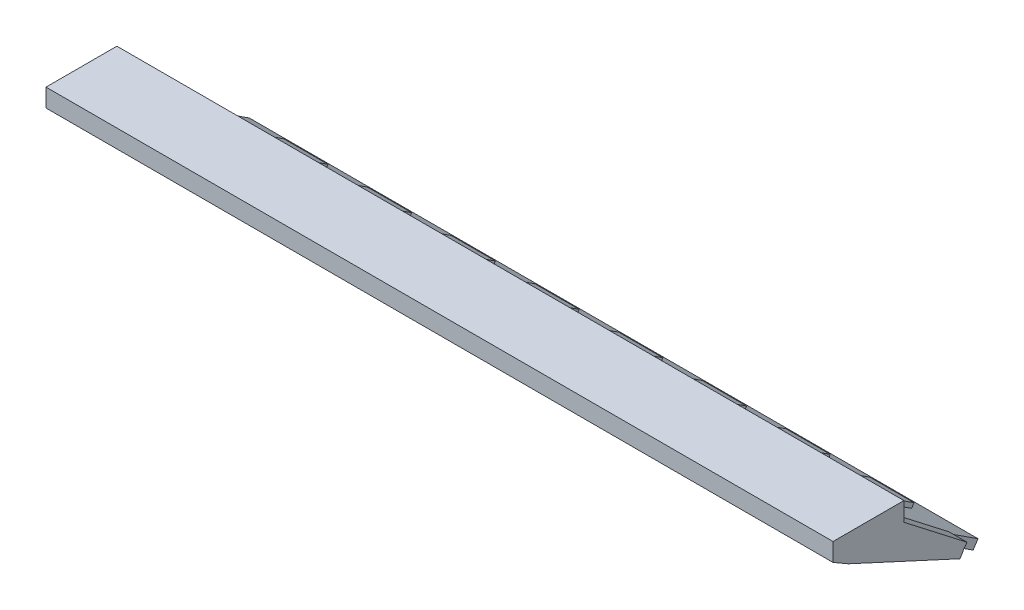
ISO-10303-21;
HEADER;
FILE_DESCRIPTION(('STEP AP214'),'2;1');
FILE_NAME('part.step','',(''),(''),'','','');
FILE_SCHEMA(('AUTOMOTIVE_DESIGN { 1 0 10303 214 1 1 1 1 }'));
ENDSEC;
DATA;
#1=APPLICATION_CONTEXT('core data for automotive mechanical design processes');
#2=APPLICATION_PROTOCOL_DEFINITION('international standard','automotive_design',2000,#1);
#3=PRODUCT_CONTEXT('',#1,'mechanical');
#4=PRODUCT('Part','Part','',(#3));
#5=PRODUCT_RELATED_PRODUCT_CATEGORY('part','',(#4));
#6=PRODUCT_DEFINITION_FORMATION('','',#4);
#7=PRODUCT_DEFINITION_CONTEXT('part definition',#1,'design');
#8=PRODUCT_DEFINITION('design','',#6,#7);
#9=PRODUCT_DEFINITION_SHAPE('','',#8);
#10=(LENGTH_UNIT() NAMED_UNIT(*) SI_UNIT(.MILLI.,.METRE.));
#11=(NAMED_UNIT(*) PLANE_ANGLE_UNIT() SI_UNIT($,.RADIAN.));
#12=(NAMED_UNIT(*) SI_UNIT($,.STERADIAN.) SOLID_ANGLE_UNIT());
#13=UNCERTAINTY_MEASURE_WITH_UNIT(LENGTH_MEASURE(1.E-05),#10,'distance_accuracy_value','');
#14=(GEOMETRIC_REPRESENTATION_CONTEXT(3) GLOBAL_UNCERTAINTY_ASSIGNED_CONTEXT((#13)) GLOBAL_UNIT_ASSIGNED_CONTEXT((#10,
#11,#12)) REPRESENTATION_CONTEXT('',''));
#15=CARTESIAN_POINT('',(0.,0.,0.));
#16=DIRECTION('',(0.,0.,1.));
#17=DIRECTION('',(1.,0.,0.));
#18=AXIS2_PLACEMENT_3D('',#15,#16,#17);
#19=CARTESIAN_POINT('',(69.5,1.55774974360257,-3.44671260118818));
#20=DIRECTION('',(0.,-0.839124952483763,0.54393870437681));
#21=DIRECTION('',(0.,-0.54393870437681,-0.839124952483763));
#22=AXIS2_PLACEMENT_3D('',#19,#20,#21);
#23=PLANE('',#22);
#24=DIRECTION('',(0.,-0.54393870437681,-0.839124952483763));
#25=VECTOR('',#24,1.);
#26=CARTESIAN_POINT('',(-40.9891534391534,-13.5697568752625,-26.7836587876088));
#27=LINE('',#26,#25);
#28=CARTESIAN_POINT('',(-40.9891534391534,-4.48943409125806,-12.7755998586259));
#29=VERTEX_POINT('',#28);
#30=CARTESIAN_POINT('',(-40.9891534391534,-13.5697568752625,-26.7836587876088));
#31=VERTEX_POINT('',#30);
#32=EDGE_CURVE('E614',#29,#31,#27,.T.);
#33=ORIENTED_EDGE('',*,*,#32,.F.);
#34=DIRECTION('',(-1.,0.,0.));
#35=VECTOR('',#34,1.);
#36=CARTESIAN_POINT('',(-33.0703703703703,-4.48943409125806,-12.7755998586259));
#37=LINE('',#36,#35);
#38=CARTESIAN_POINT('',(-33.0703703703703,-4.48943409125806,-12.7755998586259));
#39=VERTEX_POINT('',#38);
#40=EDGE_CURVE('E612',#39,#29,#37,.T.);
#41=ORIENTED_EDGE('',*,*,#40,.F.);
#42=DIRECTION('',(0.,0.54393870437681,0.839124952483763));
#43=VECTOR('',#42,1.);
#44=CARTESIAN_POINT('',(-33.0703703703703,-13.5697568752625,-26.7836587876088));
#45=LINE('',#44,#43);
#46=CARTESIAN_POINT('',(-33.0703703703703,-13.5697568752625,-26.7836587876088));
#47=VERTEX_POINT('',#46);
#48=EDGE_CURVE('E581',#47,#39,#45,.T.);
#49=ORIENTED_EDGE('',*,*,#48,.F.);
#50=DIRECTION('',(1.,0.,0.));
#51=VECTOR('',#50,1.);
#52=CARTESIAN_POINT('',(-33.0703703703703,-13.5697568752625,-26.7836587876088));
#53=LINE('',#52,#51);
#54=EDGE_CURVE('E616',#31,#47,#53,.T.);
#55=ORIENTED_EDGE('',*,*,#54,.F.);
#56=EDGE_LOOP('',(#33,#41,#49,#55));
#57=FACE_BOUND('',#56,.T.);
#58=DIRECTION('',(-1.,0.,0.));
#59=VECTOR('',#58,1.);
#60=CARTESIAN_POINT('',(-3.07037037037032,-4.48943409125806,-12.7755998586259));
#61=LINE('',#60,#59);
#62=CARTESIAN_POINT('',(-3.07037037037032,-4.48943409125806,-12.7755998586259));
#63=VERTEX_POINT('',#62);
#64=CARTESIAN_POINT('',(-10.9891534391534,-4.48943409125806,-12.7755998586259));
#65=VERTEX_POINT('',#64);
#66=EDGE_CURVE('E668',#63,#65,#61,.T.);
#67=ORIENTED_EDGE('',*,*,#66,.F.);
#68=DIRECTION('',(0.,0.54393870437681,0.839124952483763));
#69=VECTOR('',#68,1.);
#70=CARTESIAN_POINT('',(-3.07037037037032,-13.5697568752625,-26.7836587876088));
#71=LINE('',#70,#69);
#72=CARTESIAN_POINT('',(-3.07037037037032,-13.5697568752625,-26.7836587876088));
#73=VERTEX_POINT('',#72);
#74=EDGE_CURVE('E665',#73,#63,#71,.T.);
#75=ORIENTED_EDGE('',*,*,#74,.F.);
#76=DIRECTION('',(1.,0.,0.));
#77=VECTOR('',#76,1.);
#78=CARTESIAN_POINT('',(-3.07037037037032,-13.5697568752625,-26.7836587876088));
#79=LINE('',#78,#77);
#80=CARTESIAN_POINT('',(-10.9891534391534,-13.5697568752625,-26.7836587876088));
#81=VERTEX_POINT('',#80);
#82=EDGE_CURVE('E673',#81,#73,#79,.T.);
#83=ORIENTED_EDGE('',*,*,#82,.F.);
#84=DIRECTION('',(0.,-0.54393870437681,-0.839124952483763));
#85=VECTOR('',#84,1.);
#86=CARTESIAN_POINT('',(-10.9891534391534,-13.5697568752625,-26.7836587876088));
#87=LINE('',#86,#85);
#88=EDGE_CURVE('E671',#65,#81,#87,.T.);
#89=ORIENTED_EDGE('',*,*,#88,.F.);
#90=EDGE_LOOP('',(#67,#75,#83,#89));
#91=FACE_BOUND('',#90,.T.);
#92=DIRECTION('',(0.,-0.54393870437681,-0.839124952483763));
#93=VECTOR('',#92,1.);
#94=CARTESIAN_POINT('',(19.0108465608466,-13.5697568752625,-26.7836587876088));
#95=LINE('',#94,#93);
#96=CARTESIAN_POINT('',(19.0108465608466,-4.48943409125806,-12.7755998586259));
#97=VERTEX_POINT('',#96);
#98=CARTESIAN_POINT('',(19.0108465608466,-13.5697568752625,-26.7836587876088));
#99=VERTEX_POINT('',#98);
#100=EDGE_CURVE('E728',#97,#99,#95,.T.);
#101=ORIENTED_EDGE('',*,*,#100,.F.);
#102=DIRECTION('',(-1.,0.,0.));
#103=VECTOR('',#102,1.);
#104=CARTESIAN_POINT('',(26.9296296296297,-4.48943409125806,-12.7755998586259));
#105=LINE('',#104,#103);
#106=CARTESIAN_POINT('',(26.9296296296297,-4.48943409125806,-12.7755998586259));
#107=VERTEX_POINT('',#106);
#108=EDGE_CURVE('E726',#107,#97,#105,.T.);
#109=ORIENTED_EDGE('',*,*,#108,.F.);
#110=DIRECTION('',(0.,0.54393870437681,0.839124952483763));
#111=VECTOR('',#110,1.);
#112=CARTESIAN_POINT('',(26.9296296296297,-13.5697568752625,-26.7836587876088));
#113=LINE('',#112,#111);
#114=CARTESIAN_POINT('',(26.9296296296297,-13.5697568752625,-26.7836587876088));
#115=VERTEX_POINT('',#114);
#116=EDGE_CURVE('E723',#115,#107,#113,.T.);
#117=ORIENTED_EDGE('',*,*,#116,.F.);
#118=DIRECTION('',(1.,0.,0.));
#119=VECTOR('',#118,1.);
#120=CARTESIAN_POINT('',(26.9296296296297,-13.5697568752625,-26.7836587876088));
#121=LINE('',#120,#119);
#122=EDGE_CURVE('E731',#99,#115,#121,.T.);
#123=ORIENTED_EDGE('',*,*,#122,.F.);
#124=EDGE_LOOP('',(#101,#109,#117,#123));
#125=FACE_BOUND('',#124,.T.);
#126=DIRECTION('',(0.,-0.54393870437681,-0.839124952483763));
#127=VECTOR('',#126,1.);
#128=CARTESIAN_POINT('',(49.0108465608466,-13.5697568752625,-26.7836587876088));
#129=LINE('',#128,#127);
#130=CARTESIAN_POINT('',(49.0108465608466,-4.48943409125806,-12.7755998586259));
#131=VERTEX_POINT('',#130);
#132=CARTESIAN_POINT('',(49.0108465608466,-13.5697568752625,-26.7836587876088));
#133=VERTEX_POINT('',#132);
#134=EDGE_CURVE('E787',#131,#133,#129,.T.);
#135=ORIENTED_EDGE('',*,*,#134,.F.);
#136=DIRECTION('',(-1.,0.,0.));
#137=VECTOR('',#136,1.);
#138=CARTESIAN_POINT('',(56.9296296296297,-4.48943409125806,-12.7755998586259));
#139=LINE('',#138,#137);
#140=CARTESIAN_POINT('',(56.9296296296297,-4.48943409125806,-12.7755998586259));
#141=VERTEX_POINT('',#140);
#142=EDGE_CURVE('E784',#141,#131,#139,.T.);
#143=ORIENTED_EDGE('',*,*,#142,.F.);
#144=DIRECTION('',(0.,0.54393870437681,0.839124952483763));
#145=VECTOR('',#144,1.);
#146=CARTESIAN_POINT('',(56.9296296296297,-13.5697568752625,-26.7836587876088));
#147=LINE('',#146,#145);
#148=CARTESIAN_POINT('',(56.9296296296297,-13.5697568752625,-26.7836587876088));
#149=VERTEX_POINT('',#148);
#150=EDGE_CURVE('E781',#149,#141,#147,.T.);
#151=ORIENTED_EDGE('',*,*,#150,.F.);
#152=DIRECTION('',(1.,0.,0.));
#153=VECTOR('',#152,1.);
#154=CARTESIAN_POINT('',(56.9296296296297,-13.5697568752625,-26.7836587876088));
#155=LINE('',#154,#153);
#156=EDGE_CURVE('E789',#133,#149,#155,.T.);
#157=ORIENTED_EDGE('',*,*,#156,.F.);
#158=EDGE_LOOP('',(#135,#143,#151,#157));
#159=FACE_BOUND('',#158,.T.);
#160=DIRECTION('',(-1.,0.,0.));
#161=VECTOR('',#160,1.);
#162=CARTESIAN_POINT('',(69.5,-10.9065327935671,-22.6751484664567));
#163=LINE('',#162,#161);
#164=CARTESIAN_POINT('',(-65.2764550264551,-10.9065327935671,-22.6751484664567));
#165=VERTEX_POINT('',#164);
#166=CARTESIAN_POINT('',(-70.5,-10.9065327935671,-22.6751484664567));
#167=VERTEX_POINT('',#166);
#168=EDGE_CURVE('E1053',#165,#167,#163,.T.);
#169=ORIENTED_EDGE('',*,*,#168,.F.);
#170=DIRECTION('',(0.,0.54393870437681,0.839124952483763));
#171=VECTOR('',#170,1.);
#172=CARTESIAN_POINT('',(-65.2764550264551,1.55774974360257,-3.44671260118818));
#173=LINE('',#172,#171);
#174=CARTESIAN_POINT('',(-65.2764550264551,-15.86709783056,-30.3277274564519));
#175=VERTEX_POINT('',#174);
#176=EDGE_CURVE('E1050',#175,#165,#173,.T.);
#177=ORIENTED_EDGE('',*,*,#176,.F.);
#178=DIRECTION('',(-1.,0.,0.));
#179=VECTOR('',#178,1.);
#180=CARTESIAN_POINT('',(69.5,-15.86709783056,-30.3277274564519));
#181=LINE('',#180,#179);
#182=CARTESIAN_POINT('',(65.2764550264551,-15.86709783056,-30.3277274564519));
#183=VERTEX_POINT('',#182);
#184=EDGE_CURVE('E1119',#183,#175,#181,.T.);
#185=ORIENTED_EDGE('',*,*,#184,.F.);
#186=DIRECTION('',(0.,-0.54393870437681,-0.839124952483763));
#187=VECTOR('',#186,1.);
#188=CARTESIAN_POINT('',(65.2764550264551,1.55774974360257,-3.44671260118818));
#189=LINE('',#188,#187);
#190=CARTESIAN_POINT('',(65.2764550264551,-10.9065327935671,-22.6751484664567));
#191=VERTEX_POINT('',#190);
#192=EDGE_CURVE('E1071',#191,#183,#189,.T.);
#193=ORIENTED_EDGE('',*,*,#192,.F.);
#194=DIRECTION('',(-1.,0.,0.));
#195=VECTOR('',#194,1.);
#196=CARTESIAN_POINT('',(69.5,-10.9065327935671,-22.6751484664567));
#197=LINE('',#196,#195);
#198=CARTESIAN_POINT('',(69.5,-10.9065327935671,-22.6751484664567));
#199=VERTEX_POINT('',#198);
#200=EDGE_CURVE('E1067',#199,#191,#197,.T.);
#201=ORIENTED_EDGE('',*,*,#200,.F.);
#202=DIRECTION('',(0.,0.54393870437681,0.839124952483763));
#203=VECTOR('',#202,1.);
#204=CARTESIAN_POINT('',(69.5,1.55774974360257,-3.44671260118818));
#205=LINE('',#204,#203);
#206=CARTESIAN_POINT('',(69.5,-10.4455919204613,-21.9640628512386));
#207=VERTEX_POINT('',#206);
#208=EDGE_CURVE('E1116',#199,#207,#205,.T.);
#209=ORIENTED_EDGE('',*,*,#208,.T.);
#210=DIRECTION('',(-1.,0.,0.));
#211=VECTOR('',#210,1.);
#212=CARTESIAN_POINT('',(67.25,-10.4455919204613,-21.9640628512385));
#213=LINE('',#212,#211);
#214=CARTESIAN_POINT('',(67.25,-10.4455919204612,-21.9640628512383));
#215=VERTEX_POINT('',#214);
#216=EDGE_CURVE('E1129',#207,#215,#213,.T.);
#217=ORIENTED_EDGE('',*,*,#216,.T.);
#218=DIRECTION('',(0.,-0.54393870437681,-0.839124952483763));
#219=VECTOR('',#218,1.);
#220=CARTESIAN_POINT('',(67.25,-11.1289550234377,-23.0182754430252));
#221=LINE('',#220,#219);
#222=CARTESIAN_POINT('',(67.25,0.,-5.84982653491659));
#223=VERTEX_POINT('',#222);
#224=EDGE_CURVE('E1177',#223,#215,#221,.T.);
#225=ORIENTED_EDGE('',*,*,#224,.F.);
#226=DIRECTION('',(1.,0.,0.));
#227=VECTOR('',#226,1.);
#228=CARTESIAN_POINT('',(70.5,0.,-5.84982653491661));
#229=LINE('',#228,#227);
#230=CARTESIAN_POINT('',(-67.25,0.,-5.8498265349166));
#231=VERTEX_POINT('',#230);
#232=EDGE_CURVE('E1131',#231,#223,#229,.T.);
#233=ORIENTED_EDGE('',*,*,#232,.F.);
#234=DIRECTION('',(0.,-0.54393870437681,-0.839124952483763));
#235=VECTOR('',#234,1.);
#236=CARTESIAN_POINT('',(-67.25,1.55774974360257,-3.44671260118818));
#237=LINE('',#236,#235);
#238=CARTESIAN_POINT('',(-67.25,-10.4455919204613,-21.9640628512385));
#239=VERTEX_POINT('',#238);
#240=EDGE_CURVE('E1100',#231,#239,#237,.T.);
#241=ORIENTED_EDGE('',*,*,#240,.T.);
#242=DIRECTION('',(-1.,0.,0.));
#243=VECTOR('',#242,1.);
#244=CARTESIAN_POINT('',(69.5,-10.4455919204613,-21.9640628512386));
#245=LINE('',#244,#243);
#246=CARTESIAN_POINT('',(-70.5,-10.4455919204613,-21.9640628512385));
#247=VERTEX_POINT('',#246);
#248=EDGE_CURVE('E1190',#239,#247,#245,.T.);
#249=ORIENTED_EDGE('',*,*,#248,.T.);
#250=DIRECTION('',(0.,0.54393870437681,0.839124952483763));
#251=VECTOR('',#250,1.);
#252=CARTESIAN_POINT('',(-70.5,1.55774974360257,-3.44671260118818));
#253=LINE('',#252,#251);
#254=EDGE_CURVE('E1111',#167,#247,#253,.T.);
#255=ORIENTED_EDGE('',*,*,#254,.F.);
#256=EDGE_LOOP('',(#169,#177,#185,#193,#201,#209,#217,#225,#233,#241,#249,#255));
#257=FACE_BOUND('',#256,.T.);
#258=DIRECTION('',(0.,-0.54393870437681,-0.839124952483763));
#259=VECTOR('',#258,1.);
#260=CARTESIAN_POINT('',(34.0108465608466,-13.5697568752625,-26.7836587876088));
#261=LINE('',#260,#259);
#262=CARTESIAN_POINT('',(34.0108465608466,-4.48943409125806,-12.7755998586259));
#263=VERTEX_POINT('',#262);
#264=CARTESIAN_POINT('',(34.0108465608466,-13.5697568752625,-26.7836587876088));
#265=VERTEX_POINT('',#264);
#266=EDGE_CURVE('E757',#263,#265,#261,.T.);
#267=ORIENTED_EDGE('',*,*,#266,.F.);
#268=DIRECTION('',(-1.,0.,0.));
#269=VECTOR('',#268,1.);
#270=CARTESIAN_POINT('',(41.9296296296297,-4.48943409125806,-12.7755998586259));
#271=LINE('',#270,#269);
#272=CARTESIAN_POINT('',(41.9296296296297,-4.48943409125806,-12.7755998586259));
#273=VERTEX_POINT('',#272);
#274=EDGE_CURVE('E755',#273,#263,#271,.T.);
#275=ORIENTED_EDGE('',*,*,#274,.F.);
#276=DIRECTION('',(0.,0.54393870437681,0.839124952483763));
#277=VECTOR('',#276,1.);
#278=CARTESIAN_POINT('',(41.9296296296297,-13.5697568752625,-26.7836587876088));
#279=LINE('',#278,#277);
#280=CARTESIAN_POINT('',(41.9296296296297,-13.5697568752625,-26.7836587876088));
#281=VERTEX_POINT('',#280);
#282=EDGE_CURVE('E752',#281,#273,#279,.T.);
#283=ORIENTED_EDGE('',*,*,#282,.F.);
#284=DIRECTION('',(1.,0.,0.));
#285=VECTOR('',#284,1.);
#286=CARTESIAN_POINT('',(41.9296296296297,-13.5697568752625,-26.7836587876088));
#287=LINE('',#286,#285);
#288=EDGE_CURVE('E760',#265,#281,#287,.T.);
#289=ORIENTED_EDGE('',*,*,#288,.F.);
#290=EDGE_LOOP('',(#267,#275,#283,#289));
#291=FACE_BOUND('',#290,.T.);
#292=DIRECTION('',(-1.,0.,0.));
#293=VECTOR('',#292,1.);
#294=CARTESIAN_POINT('',(11.9296296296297,-4.48943409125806,-12.7755998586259));
#295=LINE('',#294,#293);
#296=CARTESIAN_POINT('',(11.9296296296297,-4.48943409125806,-12.7755998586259));
#297=VERTEX_POINT('',#296);
#298=CARTESIAN_POINT('',(4.01084656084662,-4.48943409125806,-12.7755998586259));
#299=VERTEX_POINT('',#298);
#300=EDGE_CURVE('E697',#297,#299,#295,.T.);
#301=ORIENTED_EDGE('',*,*,#300,.F.);
#302=DIRECTION('',(0.,0.54393870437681,0.839124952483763));
#303=VECTOR('',#302,1.);
#304=CARTESIAN_POINT('',(11.9296296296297,-13.5697568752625,-26.7836587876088));
#305=LINE('',#304,#303);
#306=CARTESIAN_POINT('',(11.9296296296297,-13.5697568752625,-26.7836587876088));
#307=VERTEX_POINT('',#306);
#308=EDGE_CURVE('E694',#307,#297,#305,.T.);
#309=ORIENTED_EDGE('',*,*,#308,.F.);
#310=DIRECTION('',(1.,0.,0.));
#311=VECTOR('',#310,1.);
#312=CARTESIAN_POINT('',(11.9296296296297,-13.5697568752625,-26.7836587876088));
#313=LINE('',#312,#311);
#314=CARTESIAN_POINT('',(4.01084656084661,-13.5697568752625,-26.7836587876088));
#315=VERTEX_POINT('',#314);
#316=EDGE_CURVE('E702',#315,#307,#313,.T.);
#317=ORIENTED_EDGE('',*,*,#316,.F.);
#318=DIRECTION('',(0.,-0.54393870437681,-0.839124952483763));
#319=VECTOR('',#318,1.);
#320=CARTESIAN_POINT('',(4.01084656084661,-13.5697568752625,-26.7836587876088));
#321=LINE('',#320,#319);
#322=EDGE_CURVE('E700',#299,#315,#321,.T.);
#323=ORIENTED_EDGE('',*,*,#322,.F.);
#324=EDGE_LOOP('',(#301,#309,#317,#323));
#325=FACE_BOUND('',#324,.T.);
#326=DIRECTION('',(0.,-0.54393870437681,-0.839124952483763));
#327=VECTOR('',#326,1.);
#328=CARTESIAN_POINT('',(-25.9891534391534,-13.5697568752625,-26.7836587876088));
#329=LINE('',#328,#327);
#330=CARTESIAN_POINT('',(-25.9891534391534,-4.48943409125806,-12.7755998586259));
#331=VERTEX_POINT('',#330);
#332=CARTESIAN_POINT('',(-25.9891534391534,-13.5697568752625,-26.7836587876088));
#333=VERTEX_POINT('',#332);
#334=EDGE_CURVE('E642',#331,#333,#329,.T.);
#335=ORIENTED_EDGE('',*,*,#334,.F.);
#336=DIRECTION('',(-1.,0.,0.));
#337=VECTOR('',#336,1.);
#338=CARTESIAN_POINT('',(-18.0703703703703,-4.48943409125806,-12.7755998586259));
#339=LINE('',#338,#337);
#340=CARTESIAN_POINT('',(-18.0703703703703,-4.48943409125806,-12.7755998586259));
#341=VERTEX_POINT('',#340);
#342=EDGE_CURVE('E639',#341,#331,#339,.T.);
#343=ORIENTED_EDGE('',*,*,#342,.F.);
#344=DIRECTION('',(0.,0.54393870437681,0.839124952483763));
#345=VECTOR('',#344,1.);
#346=CARTESIAN_POINT('',(-18.0703703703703,-13.5697568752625,-26.7836587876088));
#347=LINE('',#346,#345);
#348=CARTESIAN_POINT('',(-18.0703703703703,-13.5697568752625,-26.7836587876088));
#349=VERTEX_POINT('',#348);
#350=EDGE_CURVE('E636',#349,#341,#347,.T.);
#351=ORIENTED_EDGE('',*,*,#350,.F.);
#352=DIRECTION('',(1.,0.,0.));
#353=VECTOR('',#352,1.);
#354=CARTESIAN_POINT('',(-18.0703703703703,-13.5697568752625,-26.7836587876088));
#355=LINE('',#354,#353);
#356=EDGE_CURVE('E644',#333,#349,#355,.T.);
#357=ORIENTED_EDGE('',*,*,#356,.F.);
#358=EDGE_LOOP('',(#335,#343,#351,#357));
#359=FACE_BOUND('',#358,.T.);
#360=DIRECTION('',(0.,-0.54393870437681,-0.839124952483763));
#361=VECTOR('',#360,1.);
#362=CARTESIAN_POINT('',(-55.9891534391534,-13.5697568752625,-26.7836587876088));
#363=LINE('',#362,#361);
#364=CARTESIAN_POINT('',(-55.9891534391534,-4.48943409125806,-12.7755998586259));
#365=VERTEX_POINT('',#364);
#366=CARTESIAN_POINT('',(-55.9891534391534,-13.5697568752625,-26.7836587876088));
#367=VERTEX_POINT('',#366);
#368=EDGE_CURVE('E592',#365,#367,#363,.T.);
#369=ORIENTED_EDGE('',*,*,#368,.F.);
#370=DIRECTION('',(-1.,0.,0.));
#371=VECTOR('',#370,1.);
#372=CARTESIAN_POINT('',(-48.0703703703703,-4.48943409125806,-12.7755998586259));
#373=LINE('',#372,#371);
#374=CARTESIAN_POINT('',(-48.0703703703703,-4.48943409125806,-12.7755998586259));
#375=VERTEX_POINT('',#374);
#376=EDGE_CURVE('E575',#375,#365,#373,.T.);
#377=ORIENTED_EDGE('',*,*,#376,.F.);
#378=DIRECTION('',(0.,0.54393870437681,0.839124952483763));
#379=VECTOR('',#378,1.);
#380=CARTESIAN_POINT('',(-48.0703703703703,-13.5697568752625,-26.7836587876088));
#381=LINE('',#380,#379);
#382=CARTESIAN_POINT('',(-48.0703703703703,-13.5697568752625,-26.7836587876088));
#383=VERTEX_POINT('',#382);
#384=EDGE_CURVE('E585',#383,#375,#381,.T.);
#385=ORIENTED_EDGE('',*,*,#384,.F.);
#386=DIRECTION('',(1.,0.,0.));
#387=VECTOR('',#386,1.);
#388=CARTESIAN_POINT('',(-48.0703703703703,-13.5697568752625,-26.7836587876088));
#389=LINE('',#388,#387);
#390=EDGE_CURVE('E594',#367,#383,#389,.T.);
#391=ORIENTED_EDGE('',*,*,#390,.F.);
#392=EDGE_LOOP('',(#369,#377,#385,#391));
#393=FACE_BOUND('',#392,.T.);
#394=ADVANCED_FACE('F14',(#57,#91,#125,#159,#257,#291,#325,#359,#393),#23,.T.);
#395=CARTESIAN_POINT('',(69.5,2.90034966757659,-4.31701452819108));
#396=DIRECTION('',(0.,0.839124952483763,-0.54393870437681));
#397=DIRECTION('',(0.,0.54393870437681,0.839124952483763));
#398=AXIS2_PLACEMENT_3D('',#395,#396,#397);
#399=PLANE('',#398);
#400=DIRECTION('',(-1.,0.,0.));
#401=VECTOR('',#400,1.);
#402=CARTESIAN_POINT('',(-33.0703703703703,-12.2271569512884,-27.6539607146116));
#403=LINE('',#402,#401);
#404=CARTESIAN_POINT('',(-33.0703703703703,-12.2271569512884,-27.6539607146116));
#405=VERTEX_POINT('',#404);
#406=CARTESIAN_POINT('',(-40.9891534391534,-12.2271569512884,-27.6539607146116));
#407=VERTEX_POINT('',#406);
#408=EDGE_CURVE('E842',#405,#407,#403,.T.);
#409=ORIENTED_EDGE('',*,*,#408,.F.);
#410=DIRECTION('',(0.,-0.54393870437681,-0.839124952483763));
#411=VECTOR('',#410,1.);
#412=CARTESIAN_POINT('',(-33.0703703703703,-12.2271569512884,-27.6539607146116));
#413=LINE('',#412,#411);
#414=CARTESIAN_POINT('',(-33.0703703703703,-3.14683416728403,-13.6459017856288));
#415=VERTEX_POINT('',#414);
#416=EDGE_CURVE('E839',#415,#405,#413,.T.);
#417=ORIENTED_EDGE('',*,*,#416,.F.);
#418=DIRECTION('',(1.,0.,0.));
#419=VECTOR('',#418,1.);
#420=CARTESIAN_POINT('',(-33.0703703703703,-3.14683416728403,-13.6459017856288));
#421=LINE('',#420,#419);
#422=CARTESIAN_POINT('',(-40.9891534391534,-3.14683416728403,-13.6459017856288));
#423=VERTEX_POINT('',#422);
#424=EDGE_CURVE('E847',#423,#415,#421,.T.);
#425=ORIENTED_EDGE('',*,*,#424,.F.);
#426=DIRECTION('',(0.,0.54393870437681,0.839124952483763));
#427=VECTOR('',#426,1.);
#428=CARTESIAN_POINT('',(-40.9891534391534,-12.2271569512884,-27.6539607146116));
#429=LINE('',#428,#427);
#430=EDGE_CURVE('E844',#407,#423,#429,.T.);
#431=ORIENTED_EDGE('',*,*,#430,.F.);
#432=EDGE_LOOP('',(#409,#417,#425,#431));
#433=FACE_BOUND('',#432,.T.);
#434=DIRECTION('',(-1.,0.,0.));
#435=VECTOR('',#434,1.);
#436=CARTESIAN_POINT('',(-3.07037037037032,-12.2271569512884,-27.6539607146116));
#437=LINE('',#436,#435);
#438=CARTESIAN_POINT('',(-3.07037037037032,-12.2271569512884,-27.6539607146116));
#439=VERTEX_POINT('',#438);
#440=CARTESIAN_POINT('',(-10.9891534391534,-12.2271569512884,-27.6539607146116));
#441=VERTEX_POINT('',#440);
#442=EDGE_CURVE('E900',#439,#441,#437,.T.);
#443=ORIENTED_EDGE('',*,*,#442,.F.);
#444=DIRECTION('',(0.,-0.54393870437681,-0.839124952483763));
#445=VECTOR('',#444,1.);
#446=CARTESIAN_POINT('',(-3.07037037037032,-12.2271569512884,-27.6539607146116));
#447=LINE('',#446,#445);
#448=CARTESIAN_POINT('',(-3.07037037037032,-3.14683416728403,-13.6459017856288));
#449=VERTEX_POINT('',#448);
#450=EDGE_CURVE('E897',#449,#439,#447,.T.);
#451=ORIENTED_EDGE('',*,*,#450,.F.);
#452=DIRECTION('',(1.,0.,0.));
#453=VECTOR('',#452,1.);
#454=CARTESIAN_POINT('',(-3.07037037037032,-3.14683416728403,-13.6459017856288));
#455=LINE('',#454,#453);
#456=CARTESIAN_POINT('',(-10.9891534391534,-3.14683416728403,-13.6459017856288));
#457=VERTEX_POINT('',#456);
#458=EDGE_CURVE('E905',#457,#449,#455,.T.);
#459=ORIENTED_EDGE('',*,*,#458,.F.);
#460=DIRECTION('',(0.,0.54393870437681,0.839124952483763));
#461=VECTOR('',#460,1.);
#462=CARTESIAN_POINT('',(-10.9891534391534,-12.2271569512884,-27.6539607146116));
#463=LINE('',#462,#461);
#464=EDGE_CURVE('E902',#441,#457,#463,.T.);
#465=ORIENTED_EDGE('',*,*,#464,.F.);
#466=EDGE_LOOP('',(#443,#451,#459,#465));
#467=FACE_BOUND('',#466,.T.);
#468=DIRECTION('',(0.,0.54393870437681,0.839124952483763));
#469=VECTOR('',#468,1.);
#470=CARTESIAN_POINT('',(19.0108465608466,-12.2271569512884,-27.6539607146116));
#471=LINE('',#470,#469);
#472=CARTESIAN_POINT('',(19.0108465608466,-12.2271569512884,-27.6539607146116));
#473=VERTEX_POINT('',#472);
#474=CARTESIAN_POINT('',(19.0108465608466,-3.14683416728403,-13.6459017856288));
#475=VERTEX_POINT('',#474);
#476=EDGE_CURVE('E961',#473,#475,#471,.T.);
#477=ORIENTED_EDGE('',*,*,#476,.F.);
#478=DIRECTION('',(-1.,0.,0.));
#479=VECTOR('',#478,1.);
#480=CARTESIAN_POINT('',(26.9296296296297,-12.2271569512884,-27.6539607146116));
#481=LINE('',#480,#479);
#482=CARTESIAN_POINT('',(26.9296296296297,-12.2271569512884,-27.6539607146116));
#483=VERTEX_POINT('',#482);
#484=EDGE_CURVE('E958',#483,#473,#481,.T.);
#485=ORIENTED_EDGE('',*,*,#484,.F.);
#486=DIRECTION('',(0.,-0.54393870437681,-0.839124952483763));
#487=VECTOR('',#486,1.);
#488=CARTESIAN_POINT('',(26.9296296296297,-12.2271569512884,-27.6539607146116));
#489=LINE('',#488,#487);
#490=CARTESIAN_POINT('',(26.9296296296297,-3.14683416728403,-13.6459017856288));
#491=VERTEX_POINT('',#490);
#492=EDGE_CURVE('E955',#491,#483,#489,.T.);
#493=ORIENTED_EDGE('',*,*,#492,.F.);
#494=DIRECTION('',(1.,0.,0.));
#495=VECTOR('',#494,1.);
#496=CARTESIAN_POINT('',(26.9296296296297,-3.14683416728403,-13.6459017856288));
#497=LINE('',#496,#495);
#498=EDGE_CURVE('E963',#475,#491,#497,.T.);
#499=ORIENTED_EDGE('',*,*,#498,.F.);
#500=EDGE_LOOP('',(#477,#485,#493,#499));
#501=FACE_BOUND('',#500,.T.);
#502=DIRECTION('',(0.,0.54393870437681,0.839124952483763));
#503=VECTOR('',#502,1.);
#504=CARTESIAN_POINT('',(49.0108465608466,-12.2271569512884,-27.6539607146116));
#505=LINE('',#504,#503);
#506=CARTESIAN_POINT('',(49.0108465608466,-12.2271569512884,-27.6539607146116));
#507=VERTEX_POINT('',#506);
#508=CARTESIAN_POINT('',(49.0108465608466,-3.14683416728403,-13.6459017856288));
#509=VERTEX_POINT('',#508);
#510=EDGE_CURVE('E1019',#507,#509,#505,.T.);
#511=ORIENTED_EDGE('',*,*,#510,.F.);
#512=DIRECTION('',(-1.,0.,0.));
#513=VECTOR('',#512,1.);
#514=CARTESIAN_POINT('',(56.9296296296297,-12.2271569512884,-27.6539607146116));
#515=LINE('',#514,#513);
#516=CARTESIAN_POINT('',(56.9296296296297,-12.2271569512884,-27.6539607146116));
#517=VERTEX_POINT('',#516);
#518=EDGE_CURVE('E1016',#517,#507,#515,.T.);
#519=ORIENTED_EDGE('',*,*,#518,.F.);
#520=DIRECTION('',(0.,-0.54393870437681,-0.839124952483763));
#521=VECTOR('',#520,1.);
#522=CARTESIAN_POINT('',(56.9296296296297,-12.2271569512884,-27.6539607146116));
#523=LINE('',#522,#521);
#524=CARTESIAN_POINT('',(56.9296296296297,-3.14683416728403,-13.6459017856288));
#525=VERTEX_POINT('',#524);
#526=EDGE_CURVE('E1013',#525,#517,#523,.T.);
#527=ORIENTED_EDGE('',*,*,#526,.F.);
#528=DIRECTION('',(1.,0.,0.));
#529=VECTOR('',#528,1.);
#530=CARTESIAN_POINT('',(56.9296296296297,-3.14683416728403,-13.6459017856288));
#531=LINE('',#530,#529);
#532=EDGE_CURVE('E1021',#509,#525,#531,.T.);
#533=ORIENTED_EDGE('',*,*,#532,.F.);
#534=EDGE_LOOP('',(#511,#519,#527,#533));
#535=FACE_BOUND('',#534,.T.);
#536=DIRECTION('',(1.,0.,0.));
#537=VECTOR('',#536,1.);
#538=CARTESIAN_POINT('',(-70.5,-9.56393286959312,-23.5454503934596));
#539=LINE('',#538,#537);
#540=CARTESIAN_POINT('',(-70.5,-9.56393286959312,-23.5454503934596));
#541=VERTEX_POINT('',#540);
#542=CARTESIAN_POINT('',(-65.2764550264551,-9.56393286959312,-23.5454503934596));
#543=VERTEX_POINT('',#542);
#544=EDGE_CURVE('E1042',#541,#543,#539,.T.);
#545=ORIENTED_EDGE('',*,*,#544,.F.);
#546=DIRECTION('',(0.,-0.54393870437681,-0.839124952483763));
#547=VECTOR('',#546,1.);
#548=CARTESIAN_POINT('',(-70.5,2.90034966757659,-4.31701452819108));
#549=LINE('',#548,#547);
#550=CARTESIAN_POINT('',(-70.5,-9.53957026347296,-23.5078666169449));
#551=VERTEX_POINT('',#550);
#552=EDGE_CURVE('E1108',#551,#541,#549,.T.);
#553=ORIENTED_EDGE('',*,*,#552,.F.);
#554=DIRECTION('',(1.,0.,0.));
#555=VECTOR('',#554,1.);
#556=CARTESIAN_POINT('',(69.5,-9.53957026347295,-23.5078666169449));
#557=LINE('',#556,#555);
#558=CARTESIAN_POINT('',(-67.25,-9.53957026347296,-23.5078666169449));
#559=VERTEX_POINT('',#558);
#560=EDGE_CURVE('E1187',#551,#559,#557,.T.);
#561=ORIENTED_EDGE('',*,*,#560,.T.);
#562=DIRECTION('',(0.,0.54393870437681,0.839124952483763));
#563=VECTOR('',#562,1.);
#564=CARTESIAN_POINT('',(-67.25,2.90034966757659,-4.31701452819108));
#565=LINE('',#564,#563);
#566=CARTESIAN_POINT('',(-67.25,0.,-8.79133444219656));
#567=VERTEX_POINT('',#566);
#568=EDGE_CURVE('E1184',#559,#567,#565,.T.);
#569=ORIENTED_EDGE('',*,*,#568,.T.);
#570=DIRECTION('',(-1.,0.,0.));
#571=VECTOR('',#570,1.);
#572=CARTESIAN_POINT('',(70.5,0.,-8.79133444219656));
#573=LINE('',#572,#571);
#574=CARTESIAN_POINT('',(67.25,0.,-8.79133444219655));
#575=VERTEX_POINT('',#574);
#576=EDGE_CURVE('E1126',#575,#567,#573,.T.);
#577=ORIENTED_EDGE('',*,*,#576,.F.);
#578=DIRECTION('',(0.,0.54393870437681,0.839124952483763));
#579=VECTOR('',#578,1.);
#580=CARTESIAN_POINT('',(67.25,-9.78635509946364,-23.8885773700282));
#581=LINE('',#580,#579);
#582=CARTESIAN_POINT('',(67.25,-9.53957026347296,-23.5078666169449));
#583=VERTEX_POINT('',#582);
#584=EDGE_CURVE('E1174',#583,#575,#581,.T.);
#585=ORIENTED_EDGE('',*,*,#584,.F.);
#586=DIRECTION('',(1.,0.,0.));
#587=VECTOR('',#586,1.);
#588=CARTESIAN_POINT('',(67.25,-9.53957026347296,-23.5078666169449));
#589=LINE('',#588,#587);
#590=CARTESIAN_POINT('',(69.5,-9.53957026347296,-23.5078666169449));
#591=VERTEX_POINT('',#590);
#592=EDGE_CURVE('E1122',#583,#591,#589,.T.);
#593=ORIENTED_EDGE('',*,*,#592,.T.);
#594=DIRECTION('',(0.,-0.54393870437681,-0.839124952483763));
#595=VECTOR('',#594,1.);
#596=CARTESIAN_POINT('',(69.5,2.90034966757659,-4.31701452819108));
#597=LINE('',#596,#595);
#598=CARTESIAN_POINT('',(69.5,-9.56393286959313,-23.5454503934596));
#599=VERTEX_POINT('',#598);
#600=EDGE_CURVE('E1113',#591,#599,#597,.T.);
#601=ORIENTED_EDGE('',*,*,#600,.T.);
#602=DIRECTION('',(1.,0.,0.));
#603=VECTOR('',#602,1.);
#604=CARTESIAN_POINT('',(70.5,-9.56393286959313,-23.5454503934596));
#605=LINE('',#604,#603);
#606=CARTESIAN_POINT('',(65.2764550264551,-9.56393286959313,-23.5454503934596));
#607=VERTEX_POINT('',#606);
#608=EDGE_CURVE('E1058',#607,#599,#605,.T.);
#609=ORIENTED_EDGE('',*,*,#608,.F.);
#610=DIRECTION('',(0.,0.54393870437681,0.839124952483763));
#611=VECTOR('',#610,1.);
#612=CARTESIAN_POINT('',(65.2764550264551,-9.56393286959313,-23.5454503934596));
#613=LINE('',#612,#611);
#614=CARTESIAN_POINT('',(65.2764550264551,-14.5244979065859,-31.1980293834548));
#615=VERTEX_POINT('',#614);
#616=EDGE_CURVE('E1055',#615,#607,#613,.T.);
#617=ORIENTED_EDGE('',*,*,#616,.F.);
#618=DIRECTION('',(-1.,0.,0.));
#619=VECTOR('',#618,1.);
#620=CARTESIAN_POINT('',(69.5,-14.5244979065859,-31.1980293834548));
#621=LINE('',#620,#619);
#622=CARTESIAN_POINT('',(-65.2764550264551,-14.5244979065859,-31.1980293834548));
#623=VERTEX_POINT('',#622);
#624=EDGE_CURVE('E1118',#615,#623,#621,.T.);
#625=ORIENTED_EDGE('',*,*,#624,.T.);
#626=DIRECTION('',(0.,-0.54393870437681,-0.839124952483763));
#627=VECTOR('',#626,1.);
#628=CARTESIAN_POINT('',(-65.2764550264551,-9.56393286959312,-23.5454503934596));
#629=LINE('',#628,#627);
#630=EDGE_CURVE('E1045',#543,#623,#629,.T.);
#631=ORIENTED_EDGE('',*,*,#630,.F.);
#632=EDGE_LOOP('',(#545,#553,#561,#569,#577,#585,#593,#601,#609,#617,#625,#631));
#633=FACE_BOUND('',#632,.T.);
#634=DIRECTION('',(0.,0.54393870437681,0.839124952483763));
#635=VECTOR('',#634,1.);
#636=CARTESIAN_POINT('',(34.0108465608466,-12.2271569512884,-27.6539607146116));
#637=LINE('',#636,#635);
#638=CARTESIAN_POINT('',(34.0108465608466,-12.2271569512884,-27.6539607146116));
#639=VERTEX_POINT('',#638);
#640=CARTESIAN_POINT('',(34.0108465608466,-3.14683416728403,-13.6459017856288));
#641=VERTEX_POINT('',#640);
#642=EDGE_CURVE('E990',#639,#641,#637,.T.);
#643=ORIENTED_EDGE('',*,*,#642,.F.);
#644=DIRECTION('',(-1.,0.,0.));
#645=VECTOR('',#644,1.);
#646=CARTESIAN_POINT('',(41.9296296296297,-12.2271569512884,-27.6539607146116));
#647=LINE('',#646,#645);
#648=CARTESIAN_POINT('',(41.9296296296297,-12.2271569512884,-27.6539607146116));
#649=VERTEX_POINT('',#648);
#650=EDGE_CURVE('E987',#649,#639,#647,.T.);
#651=ORIENTED_EDGE('',*,*,#650,.F.);
#652=DIRECTION('',(0.,-0.54393870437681,-0.839124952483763));
#653=VECTOR('',#652,1.);
#654=CARTESIAN_POINT('',(41.9296296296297,-12.2271569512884,-27.6539607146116));
#655=LINE('',#654,#653);
#656=CARTESIAN_POINT('',(41.9296296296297,-3.14683416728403,-13.6459017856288));
#657=VERTEX_POINT('',#656);
#658=EDGE_CURVE('E984',#657,#649,#655,.T.);
#659=ORIENTED_EDGE('',*,*,#658,.F.);
#660=DIRECTION('',(1.,0.,0.));
#661=VECTOR('',#660,1.);
#662=CARTESIAN_POINT('',(41.9296296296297,-3.14683416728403,-13.6459017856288));
#663=LINE('',#662,#661);
#664=EDGE_CURVE('E992',#641,#657,#663,.T.);
#665=ORIENTED_EDGE('',*,*,#664,.F.);
#666=EDGE_LOOP('',(#643,#651,#659,#665));
#667=FACE_BOUND('',#666,.T.);
#668=DIRECTION('',(-1.,0.,0.));
#669=VECTOR('',#668,1.);
#670=CARTESIAN_POINT('',(11.9296296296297,-12.2271569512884,-27.6539607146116));
#671=LINE('',#670,#669);
#672=CARTESIAN_POINT('',(11.9296296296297,-12.2271569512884,-27.6539607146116));
#673=VERTEX_POINT('',#672);
#674=CARTESIAN_POINT('',(4.01084656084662,-12.2271569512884,-27.6539607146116));
#675=VERTEX_POINT('',#674);
#676=EDGE_CURVE('E929',#673,#675,#671,.T.);
#677=ORIENTED_EDGE('',*,*,#676,.F.);
#678=DIRECTION('',(0.,-0.54393870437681,-0.839124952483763));
#679=VECTOR('',#678,1.);
#680=CARTESIAN_POINT('',(11.9296296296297,-12.2271569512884,-27.6539607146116));
#681=LINE('',#680,#679);
#682=CARTESIAN_POINT('',(11.9296296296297,-3.14683416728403,-13.6459017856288));
#683=VERTEX_POINT('',#682);
#684=EDGE_CURVE('E926',#683,#673,#681,.T.);
#685=ORIENTED_EDGE('',*,*,#684,.F.);
#686=DIRECTION('',(1.,0.,0.));
#687=VECTOR('',#686,1.);
#688=CARTESIAN_POINT('',(11.9296296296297,-3.14683416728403,-13.6459017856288));
#689=LINE('',#688,#687);
#690=CARTESIAN_POINT('',(4.01084656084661,-3.14683416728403,-13.6459017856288));
#691=VERTEX_POINT('',#690);
#692=EDGE_CURVE('E934',#691,#683,#689,.T.);
#693=ORIENTED_EDGE('',*,*,#692,.F.);
#694=DIRECTION('',(0.,0.54393870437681,0.839124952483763));
#695=VECTOR('',#694,1.);
#696=CARTESIAN_POINT('',(4.01084656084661,-12.2271569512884,-27.6539607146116));
#697=LINE('',#696,#695);
#698=EDGE_CURVE('E932',#675,#691,#697,.T.);
#699=ORIENTED_EDGE('',*,*,#698,.F.);
#700=EDGE_LOOP('',(#677,#685,#693,#699));
#701=FACE_BOUND('',#700,.T.);
#702=DIRECTION('',(0.,0.54393870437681,0.839124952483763));
#703=VECTOR('',#702,1.);
#704=CARTESIAN_POINT('',(-25.9891534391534,-12.2271569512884,-27.6539607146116));
#705=LINE('',#704,#703);
#706=CARTESIAN_POINT('',(-25.9891534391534,-12.2271569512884,-27.6539607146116));
#707=VERTEX_POINT('',#706);
#708=CARTESIAN_POINT('',(-25.9891534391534,-3.14683416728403,-13.6459017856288));
#709=VERTEX_POINT('',#708);
#710=EDGE_CURVE('E874',#707,#709,#705,.T.);
#711=ORIENTED_EDGE('',*,*,#710,.F.);
#712=DIRECTION('',(-1.,0.,0.));
#713=VECTOR('',#712,1.);
#714=CARTESIAN_POINT('',(-18.0703703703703,-12.2271569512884,-27.6539607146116));
#715=LINE('',#714,#713);
#716=CARTESIAN_POINT('',(-18.0703703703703,-12.2271569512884,-27.6539607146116));
#717=VERTEX_POINT('',#716);
#718=EDGE_CURVE('E871',#717,#707,#715,.T.);
#719=ORIENTED_EDGE('',*,*,#718,.F.);
#720=DIRECTION('',(0.,-0.54393870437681,-0.839124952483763));
#721=VECTOR('',#720,1.);
#722=CARTESIAN_POINT('',(-18.0703703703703,-12.2271569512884,-27.6539607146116));
#723=LINE('',#722,#721);
#724=CARTESIAN_POINT('',(-18.0703703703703,-3.14683416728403,-13.6459017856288));
#725=VERTEX_POINT('',#724);
#726=EDGE_CURVE('E868',#725,#717,#723,.T.);
#727=ORIENTED_EDGE('',*,*,#726,.F.);
#728=DIRECTION('',(1.,0.,0.));
#729=VECTOR('',#728,1.);
#730=CARTESIAN_POINT('',(-18.0703703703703,-3.14683416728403,-13.6459017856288));
#731=LINE('',#730,#729);
#732=EDGE_CURVE('E876',#709,#725,#731,.T.);
#733=ORIENTED_EDGE('',*,*,#732,.F.);
#734=EDGE_LOOP('',(#711,#719,#727,#733));
#735=FACE_BOUND('',#734,.T.);
#736=DIRECTION('',(0.,0.54393870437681,0.839124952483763));
#737=VECTOR('',#736,1.);
#738=CARTESIAN_POINT('',(-55.9891534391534,-12.2271569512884,-27.6539607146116));
#739=LINE('',#738,#737);
#740=CARTESIAN_POINT('',(-55.9891534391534,-12.2271569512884,-27.6539607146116));
#741=VERTEX_POINT('',#740);
#742=CARTESIAN_POINT('',(-55.9891534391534,-3.14683416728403,-13.6459017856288));
#743=VERTEX_POINT('',#742);
#744=EDGE_CURVE('E816',#741,#743,#739,.T.);
#745=ORIENTED_EDGE('',*,*,#744,.F.);
#746=DIRECTION('',(-1.,0.,0.));
#747=VECTOR('',#746,1.);
#748=CARTESIAN_POINT('',(-48.0703703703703,-12.2271569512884,-27.6539607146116));
#749=LINE('',#748,#747);
#750=CARTESIAN_POINT('',(-48.0703703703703,-12.2271569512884,-27.6539607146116));
#751=VERTEX_POINT('',#750);
#752=EDGE_CURVE('E813',#751,#741,#749,.T.);
#753=ORIENTED_EDGE('',*,*,#752,.F.);
#754=DIRECTION('',(0.,-0.54393870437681,-0.839124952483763));
#755=VECTOR('',#754,1.);
#756=CARTESIAN_POINT('',(-48.0703703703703,-12.2271569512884,-27.6539607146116));
#757=LINE('',#756,#755);
#758=CARTESIAN_POINT('',(-48.0703703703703,-3.14683416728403,-13.6459017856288));
#759=VERTEX_POINT('',#758);
#760=EDGE_CURVE('E810',#759,#751,#757,.T.);
#761=ORIENTED_EDGE('',*,*,#760,.F.);
#762=DIRECTION('',(1.,0.,0.));
#763=VECTOR('',#762,1.);
#764=CARTESIAN_POINT('',(-48.0703703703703,-3.14683416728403,-13.6459017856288));
#765=LINE('',#764,#763);
#766=EDGE_CURVE('E818',#743,#759,#765,.T.);
#767=ORIENTED_EDGE('',*,*,#766,.F.);
#768=EDGE_LOOP('',(#745,#753,#761,#767));
#769=FACE_BOUND('',#768,.T.);
#770=ADVANCED_FACE('F1247',(#433,#467,#501,#535,#633,#667,#701,#735,#769),#399,.T.);
#771=CARTESIAN_POINT('',(69.5,1.55774974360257,-3.44671260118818));
#772=DIRECTION('',(1.,0.,0.));
#773=DIRECTION('',(0.,0.,-1.));
#774=AXIS2_PLACEMENT_3D('',#771,#772,#773);
#775=PLANE('',#774);
#776=DIRECTION('',(0.,-0.839124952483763,0.54393870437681));
#777=VECTOR('',#776,1.);
#778=CARTESIAN_POINT('',(69.5,-10.9065327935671,-22.6751484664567));
#779=LINE('',#778,#777);
#780=CARTESIAN_POINT('',(69.5,-10.1009623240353,-23.1973364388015));
#781=VERTEX_POINT('',#780);
#782=EDGE_CURVE('E2431',#599,#781,#779,.T.);
#783=ORIENTED_EDGE('',*,*,#782,.F.);
#784=ORIENTED_EDGE('',*,*,#600,.F.);
#785=DIRECTION('',(0.,-0.80881044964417,0.588069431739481));
#786=VECTOR('',#785,1.);
#787=CARTESIAN_POINT('',(69.5,-8.86270695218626,-24.));
#788=LINE('',#787,#786);
#789=CARTESIAN_POINT('',(69.5,-9.73423800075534,-23.3663277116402));
#790=VERTEX_POINT('',#789);
#791=EDGE_CURVE('E1136',#591,#790,#788,.T.);
#792=ORIENTED_EDGE('',*,*,#791,.T.);
#793=DIRECTION('',(0.,-0.908209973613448,0.418514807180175));
#794=VECTOR('',#793,1.);
#795=CARTESIAN_POINT('',(69.5,-10.8539949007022,-22.8503293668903));
#796=LINE('',#795,#794);
#797=EDGE_CURVE('E1133',#790,#781,#796,.T.);
#798=ORIENTED_EDGE('',*,*,#797,.T.);
#799=EDGE_LOOP('',(#783,#784,#792,#798));
#800=FACE_BOUND('',#799,.T.);
#801=ADVANCED_FACE('F1303',(#800),#775,.T.);
#802=CARTESIAN_POINT('',(70.5,0.,-12.7));
#803=DIRECTION('',(0.,1.,0.));
#804=DIRECTION('',(0.,0.,1.));
#805=AXIS2_PLACEMENT_3D('',#802,#803,#804);
#806=PLANE('',#805);
#807=DIRECTION('',(-1.,0.,0.));
#808=VECTOR('',#807,1.);
#809=CARTESIAN_POINT('',(-67.25,0.,-12.5467094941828));
#810=LINE('',#809,#808);
#811=CARTESIAN_POINT('',(-67.25,0.,-12.5467094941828));
#812=VERTEX_POINT('',#811);
#813=CARTESIAN_POINT('',(-70.5,0.,-12.5467094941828));
#814=VERTEX_POINT('',#813);
#815=EDGE_CURVE('E1096',#812,#814,#810,.T.);
#816=ORIENTED_EDGE('',*,*,#815,.T.);
#817=DIRECTION('',(0.,0.,1.));
#818=VECTOR('',#817,1.);
#819=CARTESIAN_POINT('',(-70.5,0.,0.));
#820=LINE('',#819,#818);
#821=CARTESIAN_POINT('',(-70.5,0.,-12.7));
#822=VERTEX_POINT('',#821);
#823=EDGE_CURVE('E1198',#822,#814,#820,.T.);
#824=ORIENTED_EDGE('',*,*,#823,.F.);
#825=DIRECTION('',(-1.,0.,0.));
#826=VECTOR('',#825,1.);
#827=CARTESIAN_POINT('',(70.5,0.,-12.7));
#828=LINE('',#827,#826);
#829=CARTESIAN_POINT('',(70.5,0.,-12.7));
#830=VERTEX_POINT('',#829);
#831=EDGE_CURVE('E1211',#830,#822,#828,.T.);
#832=ORIENTED_EDGE('',*,*,#831,.F.);
#833=DIRECTION('',(0.,0.,-1.));
#834=VECTOR('',#833,1.);
#835=CARTESIAN_POINT('',(70.5,0.,0.));
#836=LINE('',#835,#834);
#837=CARTESIAN_POINT('',(70.5,0.,-12.5467094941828));
#838=VERTEX_POINT('',#837);
#839=EDGE_CURVE('E1208',#838,#830,#836,.T.);
#840=ORIENTED_EDGE('',*,*,#839,.F.);
#841=DIRECTION('',(1.,0.,0.));
#842=VECTOR('',#841,1.);
#843=CARTESIAN_POINT('',(67.25,0.,-12.5467094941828));
#844=LINE('',#843,#842);
#845=CARTESIAN_POINT('',(67.25,0.,-12.5467094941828));
#846=VERTEX_POINT('',#845);
#847=EDGE_CURVE('E2408',#846,#838,#844,.T.);
#848=ORIENTED_EDGE('',*,*,#847,.F.);
#849=DIRECTION('',(0.,0.,1.));
#850=VECTOR('',#849,1.);
#851=CARTESIAN_POINT('',(67.25,0.,0.));
#852=LINE('',#851,#850);
#853=EDGE_CURVE('E1165',#846,#575,#852,.T.);
#854=ORIENTED_EDGE('',*,*,#853,.T.);
#855=ORIENTED_EDGE('',*,*,#576,.T.);
#856=DIRECTION('',(0.,0.,1.));
#857=VECTOR('',#856,1.);
#858=CARTESIAN_POINT('',(-67.25,0.,0.));
#859=LINE('',#858,#857);
#860=EDGE_CURVE('E1087',#812,#567,#859,.T.);
#861=ORIENTED_EDGE('',*,*,#860,.F.);
#862=EDGE_LOOP('',(#816,#824,#832,#840,#848,#854,#855,#861));
#863=FACE_BOUND('',#862,.T.);
#864=ADVANCED_FACE('F1230',(#863),#806,.F.);
#865=CARTESIAN_POINT('',(-67.25,0.,0.));
#866=VERTEX_POINT('',#865);
#867=EDGE_CURVE('E1086',#231,#866,#859,.T.);
#868=ORIENTED_EDGE('',*,*,#867,.F.);
#869=ORIENTED_EDGE('',*,*,#232,.T.);
#870=CARTESIAN_POINT('',(67.25,0.,0.));
#871=VERTEX_POINT('',#870);
#872=EDGE_CURVE('E1158',#223,#871,#852,.T.);
#873=ORIENTED_EDGE('',*,*,#872,.T.);
#874=DIRECTION('',(1.,0.,0.));
#875=VECTOR('',#874,1.);
#876=CARTESIAN_POINT('',(70.5,0.,0.));
#877=LINE('',#876,#875);
#878=EDGE_CURVE('E1194',#866,#871,#877,.T.);
#879=ORIENTED_EDGE('',*,*,#878,.F.);
#880=EDGE_LOOP('',(#868,#869,#873,#879));
#881=FACE_BOUND('',#880,.T.);
#882=ADVANCED_FACE('F1342',(#881),#806,.F.);
#883=CARTESIAN_POINT('',(67.25,-12.7011953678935,-21.9991156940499));
#884=DIRECTION('',(1.,0.,0.));
#885=DIRECTION('',(0.,0.,-1.));
#886=AXIS2_PLACEMENT_3D('',#883,#884,#885);
#887=PLANE('',#886);
#888=ORIENTED_EDGE('',*,*,#872,.F.);
#889=ORIENTED_EDGE('',*,*,#224,.T.);
#890=DIRECTION('',(0.,-0.41851480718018,-0.908209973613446));
#891=VECTOR('',#890,1.);
#892=CARTESIAN_POINT('',(67.25,-1.60649969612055,-2.78253909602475));
#893=LINE('',#892,#891);
#894=CARTESIAN_POINT('',(67.25,-1.60649969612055,-2.78253909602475));
#895=VERTEX_POINT('',#894);
#896=EDGE_CURVE('E1150',#895,#215,#893,.T.);
#897=ORIENTED_EDGE('',*,*,#896,.F.);
#898=DIRECTION('',(0.,-0.5,-0.866025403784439));
#899=VECTOR('',#898,1.);
#900=CARTESIAN_POINT('',(67.25,0.,0.));
#901=LINE('',#900,#899);
#902=EDGE_CURVE('E1154',#871,#895,#901,.T.);
#903=ORIENTED_EDGE('',*,*,#902,.F.);
#904=EDGE_LOOP('',(#888,#889,#897,#903));
#905=FACE_BOUND('',#904,.T.);
#906=ADVANCED_FACE('F1296',(#905),#887,.F.);
#907=CARTESIAN_POINT('',(70.5,3.25,0.));
#908=DIRECTION('',(-1.,0.,0.));
#909=DIRECTION('',(0.,0.,1.));
#910=AXIS2_PLACEMENT_3D('',#907,#908,#909);
#911=PLANE('',#910);
#912=DIRECTION('',(0.,-0.41851480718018,-0.908209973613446));
#913=VECTOR('',#912,1.);
#914=CARTESIAN_POINT('',(70.5,-1.60649969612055,-2.78253909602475));
#915=LINE('',#914,#913);
#916=CARTESIAN_POINT('',(70.5,-1.60649969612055,-2.78253909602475));
#917=VERTEX_POINT('',#916);
#918=CARTESIAN_POINT('',(70.5,-10.8039204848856,-22.7416639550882));
#919=VERTEX_POINT('',#918);
#920=EDGE_CURVE('E1141',#917,#919,#915,.T.);
#921=ORIENTED_EDGE('',*,*,#920,.T.);
#922=DIRECTION('',(0.,0.839124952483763,-0.54393870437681));
#923=VECTOR('',#922,1.);
#924=CARTESIAN_POINT('',(70.5,-24.7491172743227,-13.7020897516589));
#925=LINE('',#924,#923);
#926=CARTESIAN_POINT('',(70.5,-10.1009623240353,-23.1973364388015));
#927=VERTEX_POINT('',#926);
#928=EDGE_CURVE('E1061',#919,#927,#925,.T.);
#929=ORIENTED_EDGE('',*,*,#928,.T.);
#930=DIRECTION('',(0.,0.908209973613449,-0.418514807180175));
#931=VECTOR('',#930,1.);
#932=CARTESIAN_POINT('',(70.5,-10.8539949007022,-22.8503293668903));
#933=LINE('',#932,#931);
#934=CARTESIAN_POINT('',(70.5,-9.73423800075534,-23.3663277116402));
#935=VERTEX_POINT('',#934);
#936=EDGE_CURVE('E1144',#927,#935,#933,.T.);
#937=ORIENTED_EDGE('',*,*,#936,.T.);
#938=DIRECTION('',(0.,0.808810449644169,-0.588069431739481));
#939=VECTOR('',#938,1.);
#940=CARTESIAN_POINT('',(70.5,-8.86270695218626,-24.));
#941=LINE('',#940,#939);
#942=CARTESIAN_POINT('',(70.5,-8.86270695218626,-24.));
#943=VERTEX_POINT('',#942);
#944=EDGE_CURVE('E1146',#935,#943,#941,.T.);
#945=ORIENTED_EDGE('',*,*,#944,.T.);
#946=DIRECTION('',(0.,0.611985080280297,0.790869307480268));
#947=VECTOR('',#946,1.);
#948=CARTESIAN_POINT('',(70.5,0.,-12.5467094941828));
#949=LINE('',#948,#947);
#950=EDGE_CURVE('E1149',#943,#838,#949,.T.);
#951=ORIENTED_EDGE('',*,*,#950,.T.);
#952=ORIENTED_EDGE('',*,*,#839,.T.);
#953=DIRECTION('',(0.,-1.,0.));
#954=VECTOR('',#953,1.);
#955=CARTESIAN_POINT('',(70.5,3.25,-12.7));
#956=LINE('',#955,#954);
#957=CARTESIAN_POINT('',(70.5,3.25,-12.7));
#958=VERTEX_POINT('',#957);
#959=EDGE_CURVE('E1178',#958,#830,#956,.T.);
#960=ORIENTED_EDGE('',*,*,#959,.F.);
#961=DIRECTION('',(0.,0.,-1.));
#962=VECTOR('',#961,1.);
#963=CARTESIAN_POINT('',(70.5,3.25,0.));
#964=LINE('',#963,#962);
#965=CARTESIAN_POINT('',(70.5,3.25,0.));
#966=VERTEX_POINT('',#965);
#967=EDGE_CURVE('E1203',#966,#958,#964,.T.);
#968=ORIENTED_EDGE('',*,*,#967,.F.);
#969=DIRECTION('',(0.,-1.,0.));
#970=VECTOR('',#969,1.);
#971=CARTESIAN_POINT('',(70.5,3.25,0.));
#972=LINE('',#971,#970);
#973=CARTESIAN_POINT('',(70.5,0.,0.));
#974=VERTEX_POINT('',#973);
#975=EDGE_CURVE('E1273',#966,#974,#972,.T.);
#976=ORIENTED_EDGE('',*,*,#975,.T.);
#977=DIRECTION('',(0.,-0.5,-0.866025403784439));
#978=VECTOR('',#977,1.);
#979=CARTESIAN_POINT('',(70.5,0.,0.));
#980=LINE('',#979,#978);
#981=EDGE_CURVE('E1138',#974,#917,#980,.T.);
#982=ORIENTED_EDGE('',*,*,#981,.T.);
#983=EDGE_LOOP('',(#921,#929,#937,#945,#951,#952,#960,#968,#976,#982));
#984=FACE_BOUND('',#983,.T.);
#985=ADVANCED_FACE('F16',(#984),#911,.F.);
#986=CARTESIAN_POINT('',(70.5,3.25,-12.7));
#987=DIRECTION('',(0.,0.,1.));
#988=DIRECTION('',(1.,0.,0.));
#989=AXIS2_PLACEMENT_3D('',#986,#987,#988);
#990=PLANE('',#989);
#991=ORIENTED_EDGE('',*,*,#831,.T.);
#992=DIRECTION('',(0.,-1.,0.));
#993=VECTOR('',#992,1.);
#994=CARTESIAN_POINT('',(-70.5,3.25,-12.7));
#995=LINE('',#994,#993);
#996=CARTESIAN_POINT('',(-70.5,3.25,-12.7));
#997=VERTEX_POINT('',#996);
#998=EDGE_CURVE('E1228',#997,#822,#995,.T.);
#999=ORIENTED_EDGE('',*,*,#998,.F.);
#1000=DIRECTION('',(-1.,0.,0.));
#1001=VECTOR('',#1000,1.);
#1002=CARTESIAN_POINT('',(70.5,3.25,-12.7));
#1003=LINE('',#1002,#1001);
#1004=EDGE_CURVE('E1280',#958,#997,#1003,.T.);
#1005=ORIENTED_EDGE('',*,*,#1004,.F.);
#1006=ORIENTED_EDGE('',*,*,#959,.T.);
#1007=EDGE_LOOP('',(#991,#999,#1005,#1006));
#1008=FACE_BOUND('',#1007,.T.);
#1009=ADVANCED_FACE('F1288',(#1008),#990,.F.);
#1010=CARTESIAN_POINT('',(-70.5,3.25,0.));
#1011=DIRECTION('',(1.,0.,0.));
#1012=DIRECTION('',(0.,0.,-1.));
#1013=AXIS2_PLACEMENT_3D('',#1010,#1011,#1012);
#1014=PLANE('',#1013);
#1015=ORIENTED_EDGE('',*,*,#552,.T.);
#1016=DIRECTION('',(0.,0.839124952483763,-0.54393870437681));
#1017=VECTOR('',#1016,1.);
#1018=CARTESIAN_POINT('',(-70.5,-24.7491172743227,-13.7020897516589));
#1019=LINE('',#1018,#1017);
#1020=EDGE_CURVE('E1048',#167,#541,#1019,.T.);
#1021=ORIENTED_EDGE('',*,*,#1020,.F.);
#1022=ORIENTED_EDGE('',*,*,#254,.T.);
#1023=DIRECTION('',(0.,-0.41851480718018,-0.908209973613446));
#1024=VECTOR('',#1023,1.);
#1025=CARTESIAN_POINT('',(-70.5,-1.60649969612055,-2.78253909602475));
#1026=LINE('',#1025,#1024);
#1027=CARTESIAN_POINT('',(-70.5,-1.60649969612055,-2.78253909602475));
#1028=VERTEX_POINT('',#1027);
#1029=EDGE_CURVE('E1080',#1028,#247,#1026,.T.);
#1030=ORIENTED_EDGE('',*,*,#1029,.F.);
#1031=DIRECTION('',(0.,-0.5,-0.866025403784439));
#1032=VECTOR('',#1031,1.);
#1033=CARTESIAN_POINT('',(-70.5,0.,0.));
#1034=LINE('',#1033,#1032);
#1035=CARTESIAN_POINT('',(-70.5,0.,0.));
#1036=VERTEX_POINT('',#1035);
#1037=EDGE_CURVE('E1073',#1036,#1028,#1034,.T.);
#1038=ORIENTED_EDGE('',*,*,#1037,.F.);
#1039=DIRECTION('',(0.,-1.,0.));
#1040=VECTOR('',#1039,1.);
#1041=CARTESIAN_POINT('',(-70.5,3.25,0.));
#1042=LINE('',#1041,#1040);
#1043=CARTESIAN_POINT('',(-70.5,3.25,0.));
#1044=VERTEX_POINT('',#1043);
#1045=EDGE_CURVE('E1267',#1044,#1036,#1042,.T.);
#1046=ORIENTED_EDGE('',*,*,#1045,.F.);
#1047=DIRECTION('',(0.,0.,1.));
#1048=VECTOR('',#1047,1.);
#1049=CARTESIAN_POINT('',(-70.5,3.25,0.));
#1050=LINE('',#1049,#1048);
#1051=EDGE_CURVE('E1279',#997,#1044,#1050,.T.);
#1052=ORIENTED_EDGE('',*,*,#1051,.F.);
#1053=ORIENTED_EDGE('',*,*,#998,.T.);
#1054=ORIENTED_EDGE('',*,*,#823,.T.);
#1055=DIRECTION('',(0.,0.611985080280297,0.790869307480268));
#1056=VECTOR('',#1055,1.);
#1057=CARTESIAN_POINT('',(-70.5,0.,-12.5467094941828));
#1058=LINE('',#1057,#1056);
#1059=CARTESIAN_POINT('',(-70.5,-8.86270695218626,-24.));
#1060=VERTEX_POINT('',#1059);
#1061=EDGE_CURVE('E1076',#1060,#814,#1058,.T.);
#1062=ORIENTED_EDGE('',*,*,#1061,.F.);
#1063=DIRECTION('',(0.,0.808810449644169,-0.588069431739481));
#1064=VECTOR('',#1063,1.);
#1065=CARTESIAN_POINT('',(-70.5,-8.86270695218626,-24.));
#1066=LINE('',#1065,#1064);
#1067=EDGE_CURVE('E1078',#551,#1060,#1066,.T.);
#1068=ORIENTED_EDGE('',*,*,#1067,.F.);
#1069=EDGE_LOOP('',(#1015,#1021,#1022,#1030,#1038,#1046,#1052,#1053,#1054,#1062,#1068));
#1070=FACE_BOUND('',#1069,.T.);
#1071=ADVANCED_FACE('F1226',(#1070),#1014,.F.);
#1072=CARTESIAN_POINT('',(70.5,3.25,0.));
#1073=DIRECTION('',(0.,0.,-1.));
#1074=DIRECTION('',(-1.,0.,0.));
#1075=AXIS2_PLACEMENT_3D('',#1072,#1073,#1074);
#1076=PLANE('',#1075);
#1077=EDGE_CURVE('E1197',#1036,#866,#877,.T.);
#1078=ORIENTED_EDGE('',*,*,#1077,.T.);
#1079=ORIENTED_EDGE('',*,*,#878,.T.);
#1080=DIRECTION('',(1.,0.,0.));
#1081=VECTOR('',#1080,1.);
#1082=CARTESIAN_POINT('',(67.25,0.,0.));
#1083=LINE('',#1082,#1081);
#1084=EDGE_CURVE('E1212',#871,#974,#1083,.T.);
#1085=ORIENTED_EDGE('',*,*,#1084,.T.);
#1086=ORIENTED_EDGE('',*,*,#975,.F.);
#1087=DIRECTION('',(1.,0.,0.));
#1088=VECTOR('',#1087,1.);
#1089=CARTESIAN_POINT('',(70.5,3.25,0.));
#1090=LINE('',#1089,#1088);
#1091=EDGE_CURVE('E1272',#1044,#966,#1090,.T.);
#1092=ORIENTED_EDGE('',*,*,#1091,.F.);
#1093=ORIENTED_EDGE('',*,*,#1045,.T.);
#1094=EDGE_LOOP('',(#1078,#1079,#1085,#1086,#1092,#1093));
#1095=FACE_BOUND('',#1094,.T.);
#1096=ADVANCED_FACE('F1270',(#1095),#1076,.F.);
#1097=CARTESIAN_POINT('',(70.5,3.25,-12.7));
#1098=DIRECTION('',(0.,1.,0.));
#1099=DIRECTION('',(0.,0.,1.));
#1100=AXIS2_PLACEMENT_3D('',#1097,#1098,#1099);
#1101=PLANE('',#1100);
#1102=ORIENTED_EDGE('',*,*,#967,.T.);
#1103=ORIENTED_EDGE('',*,*,#1004,.T.);
#1104=ORIENTED_EDGE('',*,*,#1051,.T.);
#1105=ORIENTED_EDGE('',*,*,#1091,.T.);
#1106=EDGE_LOOP('',(#1102,#1103,#1104,#1105));
#1107=FACE_BOUND('',#1106,.T.);
#1108=ADVANCED_FACE('F1285',(#1107),#1101,.T.);
#1109=CARTESIAN_POINT('',(67.25,0.,0.));
#1110=DIRECTION('',(0.,-0.866025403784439,0.5));
#1111=DIRECTION('',(0.,-0.5,-0.866025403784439));
#1112=AXIS2_PLACEMENT_3D('',#1109,#1110,#1111);
#1113=PLANE('',#1112);
#1114=ORIENTED_EDGE('',*,*,#981,.F.);
#1115=ORIENTED_EDGE('',*,*,#1084,.F.);
#1116=ORIENTED_EDGE('',*,*,#902,.T.);
#1117=DIRECTION('',(1.,0.,0.));
#1118=VECTOR('',#1117,1.);
#1119=CARTESIAN_POINT('',(67.25,-1.60649969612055,-2.78253909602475));
#1120=LINE('',#1119,#1118);
#1121=EDGE_CURVE('E1216',#895,#917,#1120,.T.);
#1122=ORIENTED_EDGE('',*,*,#1121,.T.);
#1123=EDGE_LOOP('',(#1114,#1115,#1116,#1122));
#1124=FACE_BOUND('',#1123,.T.);
#1125=ADVANCED_FACE('F1325',(#1124),#1113,.T.);
#1126=CARTESIAN_POINT('',(67.25,0.,-12.5467094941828));
#1127=DIRECTION('',(0.,0.790869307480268,-0.611985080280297));
#1128=DIRECTION('',(0.,0.611985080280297,0.790869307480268));
#1129=AXIS2_PLACEMENT_3D('',#1126,#1127,#1128);
#1130=PLANE('',#1129);
#1131=ORIENTED_EDGE('',*,*,#950,.F.);
#1132=DIRECTION('',(1.,0.,0.));
#1133=VECTOR('',#1132,1.);
#1134=CARTESIAN_POINT('',(67.25,-8.86270695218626,-24.));
#1135=LINE('',#1134,#1133);
#1136=CARTESIAN_POINT('',(67.25,-8.86270695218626,-24.));
#1137=VERTEX_POINT('',#1136);
#1138=EDGE_CURVE('E1161',#1137,#943,#1135,.T.);
#1139=ORIENTED_EDGE('',*,*,#1138,.F.);
#1140=DIRECTION('',(0.,0.611985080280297,0.790869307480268));
#1141=VECTOR('',#1140,1.);
#1142=CARTESIAN_POINT('',(67.25,0.,-12.5467094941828));
#1143=LINE('',#1142,#1141);
#1144=EDGE_CURVE('E1156',#1137,#846,#1143,.T.);
#1145=ORIENTED_EDGE('',*,*,#1144,.T.);
#1146=ORIENTED_EDGE('',*,*,#847,.T.);
#1147=EDGE_LOOP('',(#1131,#1139,#1145,#1146));
#1148=FACE_BOUND('',#1147,.T.);
#1149=ADVANCED_FACE('F1321',(#1148),#1130,.T.);
#1150=CARTESIAN_POINT('',(67.25,-8.86270695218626,-24.));
#1151=DIRECTION('',(0.,-0.588069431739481,-0.80881044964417));
#1152=DIRECTION('',(0.,0.80881044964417,-0.588069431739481));
#1153=AXIS2_PLACEMENT_3D('',#1150,#1151,#1152);
#1154=PLANE('',#1153);
#1155=ORIENTED_EDGE('',*,*,#592,.F.);
#1156=DIRECTION('',(0.,0.808810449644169,-0.588069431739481));
#1157=VECTOR('',#1156,1.);
#1158=CARTESIAN_POINT('',(67.25,-8.86270695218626,-24.));
#1159=LINE('',#1158,#1157);
#1160=EDGE_CURVE('E1153',#583,#1137,#1159,.T.);
#1161=ORIENTED_EDGE('',*,*,#1160,.T.);
#1162=ORIENTED_EDGE('',*,*,#1138,.T.);
#1163=ORIENTED_EDGE('',*,*,#944,.F.);
#1164=DIRECTION('',(1.,0.,0.));
#1165=VECTOR('',#1164,1.);
#1166=CARTESIAN_POINT('',(67.25,-9.73423800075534,-23.3663277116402));
#1167=LINE('',#1166,#1165);
#1168=EDGE_CURVE('E2415',#790,#935,#1167,.T.);
#1169=ORIENTED_EDGE('',*,*,#1168,.F.);
#1170=ORIENTED_EDGE('',*,*,#791,.F.);
#1171=EDGE_LOOP('',(#1155,#1161,#1162,#1163,#1169,#1170));
#1172=FACE_BOUND('',#1171,.T.);
#1173=ADVANCED_FACE('F1324',(#1172),#1154,.T.);
#1174=CARTESIAN_POINT('',(67.25,-10.8539949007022,-22.8503293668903));
#1175=DIRECTION('',(0.,-0.418514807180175,-0.908209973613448));
#1176=DIRECTION('',(0.,0.908209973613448,-0.418514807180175));
#1177=AXIS2_PLACEMENT_3D('',#1174,#1175,#1176);
#1178=PLANE('',#1177);
#1179=DIRECTION('',(1.,0.,0.));
#1180=VECTOR('',#1179,1.);
#1181=CARTESIAN_POINT('',(67.25,-10.1009623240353,-23.1973364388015));
#1182=LINE('',#1181,#1180);
#1183=EDGE_CURVE('E1069',#781,#927,#1182,.T.);
#1184=ORIENTED_EDGE('',*,*,#1183,.F.);
#1185=ORIENTED_EDGE('',*,*,#797,.F.);
#1186=ORIENTED_EDGE('',*,*,#1168,.T.);
#1187=ORIENTED_EDGE('',*,*,#936,.F.);
#1188=EDGE_LOOP('',(#1184,#1185,#1186,#1187));
#1189=FACE_BOUND('',#1188,.T.);
#1190=ADVANCED_FACE('F1329',(#1189),#1178,.T.);
#1191=CARTESIAN_POINT('',(67.25,-1.60649969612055,-2.78253909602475));
#1192=DIRECTION('',(0.,-0.908209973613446,0.41851480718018));
#1193=DIRECTION('',(0.,-0.41851480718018,-0.908209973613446));
#1194=AXIS2_PLACEMENT_3D('',#1191,#1192,#1193);
#1195=PLANE('',#1194);
#1196=DIRECTION('',(-1.,0.,0.));
#1197=VECTOR('',#1196,1.);
#1198=CARTESIAN_POINT('',(67.25,-10.8039204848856,-22.7416639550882));
#1199=LINE('',#1198,#1197);
#1200=CARTESIAN_POINT('',(69.5,-10.8039204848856,-22.7416639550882));
#1201=VERTEX_POINT('',#1200);
#1202=EDGE_CURVE('E1064',#919,#1201,#1199,.T.);
#1203=ORIENTED_EDGE('',*,*,#1202,.F.);
#1204=ORIENTED_EDGE('',*,*,#920,.F.);
#1205=ORIENTED_EDGE('',*,*,#1121,.F.);
#1206=ORIENTED_EDGE('',*,*,#896,.T.);
#1207=ORIENTED_EDGE('',*,*,#216,.F.);
#1208=DIRECTION('',(0.,0.41851480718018,0.908209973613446));
#1209=VECTOR('',#1208,1.);
#1210=CARTESIAN_POINT('',(69.5,-1.60649969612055,-2.78253909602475));
#1211=LINE('',#1210,#1209);
#1212=EDGE_CURVE('E1181',#1201,#207,#1211,.T.);
#1213=ORIENTED_EDGE('',*,*,#1212,.F.);
#1214=EDGE_LOOP('',(#1203,#1204,#1205,#1206,#1207,#1213));
#1215=FACE_BOUND('',#1214,.T.);
#1216=ADVANCED_FACE('F1319',(#1215),#1195,.T.);
#1217=ORIENTED_EDGE('',*,*,#1160,.F.);
#1218=ORIENTED_EDGE('',*,*,#584,.T.);
#1219=ORIENTED_EDGE('',*,*,#853,.F.);
#1220=ORIENTED_EDGE('',*,*,#1144,.F.);
#1221=EDGE_LOOP('',(#1217,#1218,#1219,#1220));
#1222=FACE_BOUND('',#1221,.T.);
#1223=ADVANCED_FACE('F1314',(#1222),#887,.F.);
#1224=CARTESIAN_POINT('',(69.5,-14.5244979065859,-31.1980293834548));
#1225=DIRECTION('',(0.,-0.543938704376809,-0.839124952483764));
#1226=DIRECTION('',(0.,0.839124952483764,-0.543938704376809));
#1227=AXIS2_PLACEMENT_3D('',#1224,#1225,#1226);
#1228=PLANE('',#1227);
#1229=DIRECTION('',(0.,-0.839124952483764,0.543938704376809));
#1230=VECTOR('',#1229,1.);
#1231=CARTESIAN_POINT('',(-65.2764550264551,-14.5244979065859,-31.1980293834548));
#1232=LINE('',#1231,#1230);
#1233=EDGE_CURVE('E9',#623,#175,#1232,.T.);
#1234=ORIENTED_EDGE('',*,*,#1233,.F.);
#1235=ORIENTED_EDGE('',*,*,#624,.F.);
#1236=DIRECTION('',(0.,0.839124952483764,-0.543938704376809));
#1237=VECTOR('',#1236,1.);
#1238=CARTESIAN_POINT('',(65.2764550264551,-14.5244979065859,-31.1980293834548));
#1239=LINE('',#1238,#1237);
#1240=EDGE_CURVE('E22',#183,#615,#1239,.T.);
#1241=ORIENTED_EDGE('',*,*,#1240,.F.);
#1242=ORIENTED_EDGE('',*,*,#184,.T.);
#1243=EDGE_LOOP('',(#1234,#1235,#1241,#1242));
#1244=FACE_BOUND('',#1243,.T.);
#1245=ADVANCED_FACE('F1312',(#1244),#1228,.T.);
#1246=EDGE_CURVE('E1193',#1201,#199,#779,.T.);
#1247=ORIENTED_EDGE('',*,*,#1246,.F.);
#1248=ORIENTED_EDGE('',*,*,#1212,.T.);
#1249=ORIENTED_EDGE('',*,*,#208,.F.);
#1250=EDGE_LOOP('',(#1247,#1248,#1249));
#1251=FACE_BOUND('',#1250,.T.);
#1252=ADVANCED_FACE('F1310',(#1251),#775,.T.);
#1253=CARTESIAN_POINT('',(-67.25,-12.7011953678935,-21.9991156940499));
#1254=DIRECTION('',(-1.,0.,0.));
#1255=DIRECTION('',(0.,0.,-1.));
#1256=AXIS2_PLACEMENT_3D('',#1253,#1254,#1255);
#1257=PLANE('',#1256);
#1258=ORIENTED_EDGE('',*,*,#568,.F.);
#1259=DIRECTION('',(0.,0.808810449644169,-0.588069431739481));
#1260=VECTOR('',#1259,1.);
#1261=CARTESIAN_POINT('',(-67.25,-8.86270695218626,-24.));
#1262=LINE('',#1261,#1260);
#1263=CARTESIAN_POINT('',(-67.25,-8.86270695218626,-24.));
#1264=VERTEX_POINT('',#1263);
#1265=EDGE_CURVE('E1091',#559,#1264,#1262,.T.);
#1266=ORIENTED_EDGE('',*,*,#1265,.T.);
#1267=DIRECTION('',(0.,0.611985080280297,0.790869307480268));
#1268=VECTOR('',#1267,1.);
#1269=CARTESIAN_POINT('',(-67.25,0.,-12.5467094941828));
#1270=LINE('',#1269,#1268);
#1271=EDGE_CURVE('E1089',#1264,#812,#1270,.T.);
#1272=ORIENTED_EDGE('',*,*,#1271,.T.);
#1273=ORIENTED_EDGE('',*,*,#860,.T.);
#1274=EDGE_LOOP('',(#1258,#1266,#1272,#1273));
#1275=FACE_BOUND('',#1274,.T.);
#1276=ADVANCED_FACE('F1399',(#1275),#1257,.F.);
#1277=CARTESIAN_POINT('',(-67.25,-8.86270695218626,-24.));
#1278=DIRECTION('',(0.,0.588069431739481,0.80881044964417));
#1279=DIRECTION('',(0.,-0.80881044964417,0.588069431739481));
#1280=AXIS2_PLACEMENT_3D('',#1277,#1278,#1279);
#1281=PLANE('',#1280);
#1282=ORIENTED_EDGE('',*,*,#560,.F.);
#1283=ORIENTED_EDGE('',*,*,#1067,.T.);
#1284=DIRECTION('',(-1.,0.,0.));
#1285=VECTOR('',#1284,1.);
#1286=CARTESIAN_POINT('',(-67.25,-8.86270695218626,-24.));
#1287=LINE('',#1286,#1285);
#1288=EDGE_CURVE('E1101',#1264,#1060,#1287,.T.);
#1289=ORIENTED_EDGE('',*,*,#1288,.F.);
#1290=ORIENTED_EDGE('',*,*,#1265,.F.);
#1291=EDGE_LOOP('',(#1282,#1283,#1289,#1290));
#1292=FACE_BOUND('',#1291,.T.);
#1293=ADVANCED_FACE('F1241',(#1292),#1281,.F.);
#1294=CARTESIAN_POINT('',(-67.25,0.,-12.5467094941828));
#1295=DIRECTION('',(0.,-0.790869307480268,0.611985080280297));
#1296=DIRECTION('',(0.,-0.611985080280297,-0.790869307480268));
#1297=AXIS2_PLACEMENT_3D('',#1294,#1295,#1296);
#1298=PLANE('',#1297);
#1299=ORIENTED_EDGE('',*,*,#1061,.T.);
#1300=ORIENTED_EDGE('',*,*,#815,.F.);
#1301=ORIENTED_EDGE('',*,*,#1271,.F.);
#1302=ORIENTED_EDGE('',*,*,#1288,.T.);
#1303=EDGE_LOOP('',(#1299,#1300,#1301,#1302));
#1304=FACE_BOUND('',#1303,.T.);
#1305=ADVANCED_FACE('F1236',(#1304),#1298,.F.);
#1306=ORIENTED_EDGE('',*,*,#240,.F.);
#1307=ORIENTED_EDGE('',*,*,#867,.T.);
#1308=DIRECTION('',(0.,-0.5,-0.866025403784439));
#1309=VECTOR('',#1308,1.);
#1310=CARTESIAN_POINT('',(-67.25,0.,0.));
#1311=LINE('',#1310,#1309);
#1312=CARTESIAN_POINT('',(-67.25,-1.60649969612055,-2.78253909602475));
#1313=VERTEX_POINT('',#1312);
#1314=EDGE_CURVE('E1083',#866,#1313,#1311,.T.);
#1315=ORIENTED_EDGE('',*,*,#1314,.T.);
#1316=DIRECTION('',(0.,-0.41851480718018,-0.908209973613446));
#1317=VECTOR('',#1316,1.);
#1318=CARTESIAN_POINT('',(-67.25,-1.60649969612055,-2.78253909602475));
#1319=LINE('',#1318,#1317);
#1320=EDGE_CURVE('E1093',#1313,#239,#1319,.T.);
#1321=ORIENTED_EDGE('',*,*,#1320,.T.);
#1322=EDGE_LOOP('',(#1306,#1307,#1315,#1321));
#1323=FACE_BOUND('',#1322,.T.);
#1324=ADVANCED_FACE('F1409',(#1323),#1257,.F.);
#1325=CARTESIAN_POINT('',(-67.25,0.,0.));
#1326=DIRECTION('',(0.,0.866025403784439,-0.5));
#1327=DIRECTION('',(0.,0.5,0.866025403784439));
#1328=AXIS2_PLACEMENT_3D('',#1325,#1326,#1327);
#1329=PLANE('',#1328);
#1330=ORIENTED_EDGE('',*,*,#1037,.T.);
#1331=DIRECTION('',(-1.,0.,0.));
#1332=VECTOR('',#1331,1.);
#1333=CARTESIAN_POINT('',(-67.25,-1.60649969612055,-2.78253909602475));
#1334=LINE('',#1333,#1332);
#1335=EDGE_CURVE('E1097',#1313,#1028,#1334,.T.);
#1336=ORIENTED_EDGE('',*,*,#1335,.F.);
#1337=ORIENTED_EDGE('',*,*,#1314,.F.);
#1338=ORIENTED_EDGE('',*,*,#1077,.F.);
#1339=EDGE_LOOP('',(#1330,#1336,#1337,#1338));
#1340=FACE_BOUND('',#1339,.T.);
#1341=ADVANCED_FACE('F1264',(#1340),#1329,.F.);
#1342=CARTESIAN_POINT('',(-67.25,-1.60649969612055,-2.78253909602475));
#1343=DIRECTION('',(0.,0.908209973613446,-0.41851480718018));
#1344=DIRECTION('',(0.,0.41851480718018,0.908209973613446));
#1345=AXIS2_PLACEMENT_3D('',#1342,#1343,#1344);
#1346=PLANE('',#1345);
#1347=ORIENTED_EDGE('',*,*,#248,.F.);
#1348=ORIENTED_EDGE('',*,*,#1320,.F.);
#1349=ORIENTED_EDGE('',*,*,#1335,.T.);
#1350=ORIENTED_EDGE('',*,*,#1029,.T.);
#1351=EDGE_LOOP('',(#1347,#1348,#1349,#1350));
#1352=FACE_BOUND('',#1351,.T.);
#1353=ADVANCED_FACE('F1260',(#1352),#1346,.F.);
#1354=CARTESIAN_POINT('',(70.5,-24.7491172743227,-13.7020897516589));
#1355=DIRECTION('',(0.,0.54393870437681,0.839124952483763));
#1356=DIRECTION('',(0.,-0.839124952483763,0.54393870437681));
#1357=AXIS2_PLACEMENT_3D('',#1354,#1355,#1356);
#1358=PLANE('',#1357);
#1359=ORIENTED_EDGE('',*,*,#1183,.T.);
#1360=ORIENTED_EDGE('',*,*,#928,.F.);
#1361=ORIENTED_EDGE('',*,*,#1202,.T.);
#1362=ORIENTED_EDGE('',*,*,#1246,.T.);
#1363=ORIENTED_EDGE('',*,*,#200,.T.);
#1364=DIRECTION('',(0.,0.839124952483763,-0.54393870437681));
#1365=VECTOR('',#1364,1.);
#1366=CARTESIAN_POINT('',(65.2764550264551,-24.7491172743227,-13.7020897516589));
#1367=LINE('',#1366,#1365);
#1368=EDGE_CURVE('E1060',#191,#607,#1367,.T.);
#1369=ORIENTED_EDGE('',*,*,#1368,.T.);
#1370=ORIENTED_EDGE('',*,*,#608,.T.);
#1371=ORIENTED_EDGE('',*,*,#782,.T.);
#1372=EDGE_LOOP('',(#1359,#1360,#1361,#1362,#1363,#1369,#1370,#1371));
#1373=FACE_BOUND('',#1372,.T.);
#1374=ADVANCED_FACE('F1443',(#1373),#1358,.F.);
#1375=CARTESIAN_POINT('',(65.2764550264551,-24.7491172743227,-13.7020897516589));
#1376=DIRECTION('',(-1.,0.,0.));
#1377=DIRECTION('',(0.,0.,1.));
#1378=AXIS2_PLACEMENT_3D('',#1375,#1376,#1377);
#1379=PLANE('',#1378);
#1380=ORIENTED_EDGE('',*,*,#192,.T.);
#1381=ORIENTED_EDGE('',*,*,#1240,.T.);
#1382=ORIENTED_EDGE('',*,*,#616,.T.);
#1383=ORIENTED_EDGE('',*,*,#1368,.F.);
#1384=EDGE_LOOP('',(#1380,#1381,#1382,#1383));
#1385=FACE_BOUND('',#1384,.T.);
#1386=ADVANCED_FACE('F1451',(#1385),#1379,.F.);
#1387=CARTESIAN_POINT('',(-70.5,-24.7491172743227,-13.7020897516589));
#1388=DIRECTION('',(0.,0.54393870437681,0.839124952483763));
#1389=DIRECTION('',(0.,-0.839124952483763,0.54393870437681));
#1390=AXIS2_PLACEMENT_3D('',#1387,#1388,#1389);
#1391=PLANE('',#1390);
#1392=ORIENTED_EDGE('',*,*,#168,.T.);
#1393=ORIENTED_EDGE('',*,*,#1020,.T.);
#1394=ORIENTED_EDGE('',*,*,#544,.T.);
#1395=DIRECTION('',(0.,0.839124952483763,-0.54393870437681));
#1396=VECTOR('',#1395,1.);
#1397=CARTESIAN_POINT('',(-65.2764550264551,-24.7491172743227,-13.7020897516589));
#1398=LINE('',#1397,#1396);
#1399=EDGE_CURVE('E1047',#165,#543,#1398,.T.);
#1400=ORIENTED_EDGE('',*,*,#1399,.F.);
#1401=EDGE_LOOP('',(#1392,#1393,#1394,#1400));
#1402=FACE_BOUND('',#1401,.T.);
#1403=ADVANCED_FACE('F1252',(#1402),#1391,.F.);
#1404=CARTESIAN_POINT('',(-65.2764550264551,-24.7491172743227,-13.7020897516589));
#1405=DIRECTION('',(1.,0.,0.));
#1406=DIRECTION('',(0.,0.,-1.));
#1407=AXIS2_PLACEMENT_3D('',#1404,#1405,#1406);
#1408=PLANE('',#1407);
#1409=ORIENTED_EDGE('',*,*,#176,.T.);
#1410=ORIENTED_EDGE('',*,*,#1399,.T.);
#1411=ORIENTED_EDGE('',*,*,#630,.T.);
#1412=ORIENTED_EDGE('',*,*,#1233,.T.);
#1413=EDGE_LOOP('',(#1409,#1410,#1411,#1412));
#1414=FACE_BOUND('',#1413,.T.);
#1415=ADVANCED_FACE('F1468',(#1414),#1408,.F.);
#1416=CARTESIAN_POINT('',(56.9296296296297,-11.5558569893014,-28.0891116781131));
#1417=DIRECTION('',(-1.,0.,0.));
#1418=DIRECTION('',(0.,0.,1.));
#1419=AXIS2_PLACEMENT_3D('',#1416,#1417,#1418);
#1420=PLANE('',#1419);
#1421=ORIENTED_EDGE('',*,*,#526,.T.);
#1422=DIRECTION('',(0.,-0.839124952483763,0.54393870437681));
#1423=VECTOR('',#1422,1.);
#1424=CARTESIAN_POINT('',(56.9296296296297,-11.5558569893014,-28.0891116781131));
#1425=LINE('',#1424,#1423);
#1426=CARTESIAN_POINT('',(56.9296296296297,-11.5558569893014,-28.0891116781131));
#1427=VERTEX_POINT('',#1426);
#1428=EDGE_CURVE('E1040',#1427,#517,#1425,.T.);
#1429=ORIENTED_EDGE('',*,*,#1428,.F.);
#1430=DIRECTION('',(0.,-0.54393870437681,-0.839124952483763));
#1431=VECTOR('',#1430,1.);
#1432=CARTESIAN_POINT('',(56.9296296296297,-11.5558569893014,-28.0891116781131));
#1433=LINE('',#1432,#1431);
#1434=CARTESIAN_POINT('',(56.9296296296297,-2.47553420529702,-14.0810527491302));
#1435=VERTEX_POINT('',#1434);
#1436=EDGE_CURVE('E1023',#1435,#1427,#1433,.T.);
#1437=ORIENTED_EDGE('',*,*,#1436,.F.);
#1438=DIRECTION('',(0.,-0.839124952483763,0.54393870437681));
#1439=VECTOR('',#1438,1.);
#1440=CARTESIAN_POINT('',(56.9296296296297,-2.47553420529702,-14.0810527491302));
#1441=LINE('',#1440,#1439);
#1442=EDGE_CURVE('E1032',#1435,#525,#1441,.T.);
#1443=ORIENTED_EDGE('',*,*,#1442,.T.);
#1444=EDGE_LOOP('',(#1421,#1429,#1437,#1443));
#1445=FACE_BOUND('',#1444,.T.);
#1446=ADVANCED_FACE('F1476',(#1445),#1420,.F.);
#1447=CARTESIAN_POINT('',(56.9296296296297,-11.5558569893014,-28.0891116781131));
#1448=DIRECTION('',(0.,0.54393870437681,0.839124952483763));
#1449=DIRECTION('',(0.,-0.839124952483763,0.54393870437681));
#1450=AXIS2_PLACEMENT_3D('',#1447,#1448,#1449);
#1451=PLANE('',#1450);
#1452=ORIENTED_EDGE('',*,*,#518,.T.);
#1453=DIRECTION('',(0.,-0.839124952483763,0.54393870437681));
#1454=VECTOR('',#1453,1.);
#1455=CARTESIAN_POINT('',(49.0108465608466,-11.5558569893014,-28.0891116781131));
#1456=LINE('',#1455,#1454);
#1457=CARTESIAN_POINT('',(49.0108465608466,-11.5558569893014,-28.0891116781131));
#1458=VERTEX_POINT('',#1457);
#1459=EDGE_CURVE('E1038',#1458,#507,#1456,.T.);
#1460=ORIENTED_EDGE('',*,*,#1459,.F.);
#1461=DIRECTION('',(-1.,0.,0.));
#1462=VECTOR('',#1461,1.);
#1463=CARTESIAN_POINT('',(56.9296296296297,-11.5558569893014,-28.0891116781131));
#1464=LINE('',#1463,#1462);
#1465=EDGE_CURVE('E1026',#1427,#1458,#1464,.T.);
#1466=ORIENTED_EDGE('',*,*,#1465,.F.);
#1467=ORIENTED_EDGE('',*,*,#1428,.T.);
#1468=EDGE_LOOP('',(#1452,#1460,#1466,#1467));
#1469=FACE_BOUND('',#1468,.T.);
#1470=ADVANCED_FACE('F1485',(#1469),#1451,.F.);
#1471=CARTESIAN_POINT('',(49.0108465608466,-11.5558569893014,-28.0891116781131));
#1472=DIRECTION('',(1.,0.,0.));
#1473=DIRECTION('',(0.,0.,-1.));
#1474=AXIS2_PLACEMENT_3D('',#1471,#1472,#1473);
#1475=PLANE('',#1474);
#1476=ORIENTED_EDGE('',*,*,#510,.T.);
#1477=DIRECTION('',(0.,-0.839124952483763,0.54393870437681));
#1478=VECTOR('',#1477,1.);
#1479=CARTESIAN_POINT('',(49.0108465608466,-2.47553420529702,-14.0810527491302));
#1480=LINE('',#1479,#1478);
#1481=CARTESIAN_POINT('',(49.0108465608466,-2.47553420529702,-14.0810527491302));
#1482=VERTEX_POINT('',#1481);
#1483=EDGE_CURVE('E1035',#1482,#509,#1480,.T.);
#1484=ORIENTED_EDGE('',*,*,#1483,.F.);
#1485=DIRECTION('',(0.,0.54393870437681,0.839124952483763));
#1486=VECTOR('',#1485,1.);
#1487=CARTESIAN_POINT('',(49.0108465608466,-11.5558569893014,-28.0891116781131));
#1488=LINE('',#1487,#1486);
#1489=EDGE_CURVE('E1028',#1458,#1482,#1488,.T.);
#1490=ORIENTED_EDGE('',*,*,#1489,.F.);
#1491=ORIENTED_EDGE('',*,*,#1459,.T.);
#1492=EDGE_LOOP('',(#1476,#1484,#1490,#1491));
#1493=FACE_BOUND('',#1492,.T.);
#1494=ADVANCED_FACE('F1494',(#1493),#1475,.F.);
#1495=CARTESIAN_POINT('',(56.9296296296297,-2.47553420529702,-14.0810527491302));
#1496=DIRECTION('',(0.,-0.54393870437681,-0.839124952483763));
#1497=DIRECTION('',(0.,0.839124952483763,-0.54393870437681));
#1498=AXIS2_PLACEMENT_3D('',#1495,#1496,#1497);
#1499=PLANE('',#1498);
#1500=ORIENTED_EDGE('',*,*,#532,.T.);
#1501=ORIENTED_EDGE('',*,*,#1442,.F.);
#1502=DIRECTION('',(1.,0.,0.));
#1503=VECTOR('',#1502,1.);
#1504=CARTESIAN_POINT('',(56.9296296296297,-2.47553420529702,-14.0810527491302));
#1505=LINE('',#1504,#1503);
#1506=EDGE_CURVE('E1030',#1482,#1435,#1505,.T.);
#1507=ORIENTED_EDGE('',*,*,#1506,.F.);
#1508=ORIENTED_EDGE('',*,*,#1483,.T.);
#1509=EDGE_LOOP('',(#1500,#1501,#1507,#1508));
#1510=FACE_BOUND('',#1509,.T.);
#1511=ADVANCED_FACE('F1503',(#1510),#1499,.F.);
#1512=CARTESIAN_POINT('',(56.9296296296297,-11.5558569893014,-28.0891116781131));
#1513=DIRECTION('',(0.,-0.839124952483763,0.54393870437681));
#1514=DIRECTION('',(0.,-0.54393870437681,-0.839124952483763));
#1515=AXIS2_PLACEMENT_3D('',#1512,#1513,#1514);
#1516=PLANE('',#1515);
#1517=ORIENTED_EDGE('',*,*,#1436,.T.);
#1518=ORIENTED_EDGE('',*,*,#1465,.T.);
#1519=ORIENTED_EDGE('',*,*,#1489,.T.);
#1520=ORIENTED_EDGE('',*,*,#1506,.T.);
#1521=EDGE_LOOP('',(#1517,#1518,#1519,#1520));
#1522=FACE_BOUND('',#1521,.T.);
#1523=ADVANCED_FACE('F1512',(#1522),#1516,.F.);
#1524=CARTESIAN_POINT('',(41.9296296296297,-11.5558569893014,-28.0891116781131));
#1525=DIRECTION('',(-1.,0.,0.));
#1526=DIRECTION('',(0.,0.,1.));
#1527=AXIS2_PLACEMENT_3D('',#1524,#1525,#1526);
#1528=PLANE('',#1527);
#1529=ORIENTED_EDGE('',*,*,#658,.T.);
#1530=DIRECTION('',(0.,-0.839124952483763,0.54393870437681));
#1531=VECTOR('',#1530,1.);
#1532=CARTESIAN_POINT('',(41.9296296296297,-11.5558569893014,-28.0891116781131));
#1533=LINE('',#1532,#1531);
#1534=CARTESIAN_POINT('',(41.9296296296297,-11.5558569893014,-28.0891116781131));
#1535=VERTEX_POINT('',#1534);
#1536=EDGE_CURVE('E1011',#1535,#649,#1533,.T.);
#1537=ORIENTED_EDGE('',*,*,#1536,.F.);
#1538=DIRECTION('',(0.,-0.54393870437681,-0.839124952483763));
#1539=VECTOR('',#1538,1.);
#1540=CARTESIAN_POINT('',(41.9296296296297,-11.5558569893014,-28.0891116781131));
#1541=LINE('',#1540,#1539);
#1542=CARTESIAN_POINT('',(41.9296296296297,-2.47553420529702,-14.0810527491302));
#1543=VERTEX_POINT('',#1542);
#1544=EDGE_CURVE('E994',#1543,#1535,#1541,.T.);
#1545=ORIENTED_EDGE('',*,*,#1544,.F.);
#1546=DIRECTION('',(0.,-0.839124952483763,0.54393870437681));
#1547=VECTOR('',#1546,1.);
#1548=CARTESIAN_POINT('',(41.9296296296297,-2.47553420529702,-14.0810527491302));
#1549=LINE('',#1548,#1547);
#1550=EDGE_CURVE('E1003',#1543,#657,#1549,.T.);
#1551=ORIENTED_EDGE('',*,*,#1550,.T.);
#1552=EDGE_LOOP('',(#1529,#1537,#1545,#1551));
#1553=FACE_BOUND('',#1552,.T.);
#1554=ADVANCED_FACE('F1522',(#1553),#1528,.F.);
#1555=CARTESIAN_POINT('',(41.9296296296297,-11.5558569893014,-28.0891116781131));
#1556=DIRECTION('',(0.,0.54393870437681,0.839124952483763));
#1557=DIRECTION('',(0.,-0.839124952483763,0.54393870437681));
#1558=AXIS2_PLACEMENT_3D('',#1555,#1556,#1557);
#1559=PLANE('',#1558);
#1560=ORIENTED_EDGE('',*,*,#650,.T.);
#1561=DIRECTION('',(0.,-0.839124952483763,0.54393870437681));
#1562=VECTOR('',#1561,1.);
#1563=CARTESIAN_POINT('',(34.0108465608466,-11.5558569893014,-28.0891116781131));
#1564=LINE('',#1563,#1562);
#1565=CARTESIAN_POINT('',(34.0108465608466,-11.5558569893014,-28.0891116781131));
#1566=VERTEX_POINT('',#1565);
#1567=EDGE_CURVE('E1009',#1566,#639,#1564,.T.);
#1568=ORIENTED_EDGE('',*,*,#1567,.F.);
#1569=DIRECTION('',(-1.,0.,0.));
#1570=VECTOR('',#1569,1.);
#1571=CARTESIAN_POINT('',(41.9296296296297,-11.5558569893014,-28.0891116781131));
#1572=LINE('',#1571,#1570);
#1573=EDGE_CURVE('E997',#1535,#1566,#1572,.T.);
#1574=ORIENTED_EDGE('',*,*,#1573,.F.);
#1575=ORIENTED_EDGE('',*,*,#1536,.T.);
#1576=EDGE_LOOP('',(#1560,#1568,#1574,#1575));
#1577=FACE_BOUND('',#1576,.T.);
#1578=ADVANCED_FACE('F1531',(#1577),#1559,.F.);
#1579=CARTESIAN_POINT('',(34.0108465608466,-11.5558569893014,-28.0891116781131));
#1580=DIRECTION('',(1.,0.,0.));
#1581=DIRECTION('',(0.,0.,-1.));
#1582=AXIS2_PLACEMENT_3D('',#1579,#1580,#1581);
#1583=PLANE('',#1582);
#1584=ORIENTED_EDGE('',*,*,#642,.T.);
#1585=DIRECTION('',(0.,-0.839124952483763,0.54393870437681));
#1586=VECTOR('',#1585,1.);
#1587=CARTESIAN_POINT('',(34.0108465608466,-2.47553420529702,-14.0810527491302));
#1588=LINE('',#1587,#1586);
#1589=CARTESIAN_POINT('',(34.0108465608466,-2.47553420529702,-14.0810527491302));
#1590=VERTEX_POINT('',#1589);
#1591=EDGE_CURVE('E1006',#1590,#641,#1588,.T.);
#1592=ORIENTED_EDGE('',*,*,#1591,.F.);
#1593=DIRECTION('',(0.,0.54393870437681,0.839124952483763));
#1594=VECTOR('',#1593,1.);
#1595=CARTESIAN_POINT('',(34.0108465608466,-11.5558569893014,-28.0891116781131));
#1596=LINE('',#1595,#1594);
#1597=EDGE_CURVE('E999',#1566,#1590,#1596,.T.);
#1598=ORIENTED_EDGE('',*,*,#1597,.F.);
#1599=ORIENTED_EDGE('',*,*,#1567,.T.);
#1600=EDGE_LOOP('',(#1584,#1592,#1598,#1599));
#1601=FACE_BOUND('',#1600,.T.);
#1602=ADVANCED_FACE('F1540',(#1601),#1583,.F.);
#1603=CARTESIAN_POINT('',(41.9296296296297,-2.47553420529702,-14.0810527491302));
#1604=DIRECTION('',(0.,-0.54393870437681,-0.839124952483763));
#1605=DIRECTION('',(0.,0.839124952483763,-0.54393870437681));
#1606=AXIS2_PLACEMENT_3D('',#1603,#1604,#1605);
#1607=PLANE('',#1606);
#1608=ORIENTED_EDGE('',*,*,#664,.T.);
#1609=ORIENTED_EDGE('',*,*,#1550,.F.);
#1610=DIRECTION('',(1.,0.,0.));
#1611=VECTOR('',#1610,1.);
#1612=CARTESIAN_POINT('',(41.9296296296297,-2.47553420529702,-14.0810527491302));
#1613=LINE('',#1612,#1611);
#1614=EDGE_CURVE('E1001',#1590,#1543,#1613,.T.);
#1615=ORIENTED_EDGE('',*,*,#1614,.F.);
#1616=ORIENTED_EDGE('',*,*,#1591,.T.);
#1617=EDGE_LOOP('',(#1608,#1609,#1615,#1616));
#1618=FACE_BOUND('',#1617,.T.);
#1619=ADVANCED_FACE('F1549',(#1618),#1607,.F.);
#1620=CARTESIAN_POINT('',(41.9296296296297,-11.5558569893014,-28.0891116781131));
#1621=DIRECTION('',(0.,-0.839124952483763,0.54393870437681));
#1622=DIRECTION('',(0.,-0.54393870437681,-0.839124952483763));
#1623=AXIS2_PLACEMENT_3D('',#1620,#1621,#1622);
#1624=PLANE('',#1623);
#1625=ORIENTED_EDGE('',*,*,#1544,.T.);
#1626=ORIENTED_EDGE('',*,*,#1573,.T.);
#1627=ORIENTED_EDGE('',*,*,#1597,.T.);
#1628=ORIENTED_EDGE('',*,*,#1614,.T.);
#1629=EDGE_LOOP('',(#1625,#1626,#1627,#1628));
#1630=FACE_BOUND('',#1629,.T.);
#1631=ADVANCED_FACE('F1558',(#1630),#1624,.F.);
#1632=CARTESIAN_POINT('',(26.9296296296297,-11.5558569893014,-28.0891116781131));
#1633=DIRECTION('',(-1.,0.,0.));
#1634=DIRECTION('',(0.,0.,1.));
#1635=AXIS2_PLACEMENT_3D('',#1632,#1633,#1634);
#1636=PLANE('',#1635);
#1637=ORIENTED_EDGE('',*,*,#492,.T.);
#1638=DIRECTION('',(0.,-0.839124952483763,0.54393870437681));
#1639=VECTOR('',#1638,1.);
#1640=CARTESIAN_POINT('',(26.9296296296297,-11.5558569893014,-28.0891116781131));
#1641=LINE('',#1640,#1639);
#1642=CARTESIAN_POINT('',(26.9296296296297,-11.5558569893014,-28.0891116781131));
#1643=VERTEX_POINT('',#1642);
#1644=EDGE_CURVE('E982',#1643,#483,#1641,.T.);
#1645=ORIENTED_EDGE('',*,*,#1644,.F.);
#1646=DIRECTION('',(0.,-0.54393870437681,-0.839124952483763));
#1647=VECTOR('',#1646,1.);
#1648=CARTESIAN_POINT('',(26.9296296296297,-11.5558569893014,-28.0891116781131));
#1649=LINE('',#1648,#1647);
#1650=CARTESIAN_POINT('',(26.9296296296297,-2.47553420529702,-14.0810527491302));
#1651=VERTEX_POINT('',#1650);
#1652=EDGE_CURVE('E965',#1651,#1643,#1649,.T.);
#1653=ORIENTED_EDGE('',*,*,#1652,.F.);
#1654=DIRECTION('',(0.,-0.839124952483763,0.54393870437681));
#1655=VECTOR('',#1654,1.);
#1656=CARTESIAN_POINT('',(26.9296296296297,-2.47553420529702,-14.0810527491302));
#1657=LINE('',#1656,#1655);
#1658=EDGE_CURVE('E974',#1651,#491,#1657,.T.);
#1659=ORIENTED_EDGE('',*,*,#1658,.T.);
#1660=EDGE_LOOP('',(#1637,#1645,#1653,#1659));
#1661=FACE_BOUND('',#1660,.T.);
#1662=ADVANCED_FACE('F1567',(#1661),#1636,.F.);
#1663=CARTESIAN_POINT('',(26.9296296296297,-11.5558569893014,-28.0891116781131));
#1664=DIRECTION('',(0.,0.54393870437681,0.839124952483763));
#1665=DIRECTION('',(0.,-0.839124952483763,0.54393870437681));
#1666=AXIS2_PLACEMENT_3D('',#1663,#1664,#1665);
#1667=PLANE('',#1666);
#1668=ORIENTED_EDGE('',*,*,#484,.T.);
#1669=DIRECTION('',(0.,-0.839124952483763,0.54393870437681));
#1670=VECTOR('',#1669,1.);
#1671=CARTESIAN_POINT('',(19.0108465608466,-11.5558569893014,-28.0891116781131));
#1672=LINE('',#1671,#1670);
#1673=CARTESIAN_POINT('',(19.0108465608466,-11.5558569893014,-28.0891116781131));
#1674=VERTEX_POINT('',#1673);
#1675=EDGE_CURVE('E980',#1674,#473,#1672,.T.);
#1676=ORIENTED_EDGE('',*,*,#1675,.F.);
#1677=DIRECTION('',(-1.,0.,0.));
#1678=VECTOR('',#1677,1.);
#1679=CARTESIAN_POINT('',(26.9296296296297,-11.5558569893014,-28.0891116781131));
#1680=LINE('',#1679,#1678);
#1681=EDGE_CURVE('E968',#1643,#1674,#1680,.T.);
#1682=ORIENTED_EDGE('',*,*,#1681,.F.);
#1683=ORIENTED_EDGE('',*,*,#1644,.T.);
#1684=EDGE_LOOP('',(#1668,#1676,#1682,#1683));
#1685=FACE_BOUND('',#1684,.T.);
#1686=ADVANCED_FACE('F1575',(#1685),#1667,.F.);
#1687=CARTESIAN_POINT('',(19.0108465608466,-11.5558569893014,-28.0891116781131));
#1688=DIRECTION('',(1.,0.,0.));
#1689=DIRECTION('',(0.,0.,-1.));
#1690=AXIS2_PLACEMENT_3D('',#1687,#1688,#1689);
#1691=PLANE('',#1690);
#1692=ORIENTED_EDGE('',*,*,#476,.T.);
#1693=DIRECTION('',(0.,-0.839124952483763,0.54393870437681));
#1694=VECTOR('',#1693,1.);
#1695=CARTESIAN_POINT('',(19.0108465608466,-2.47553420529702,-14.0810527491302));
#1696=LINE('',#1695,#1694);
#1697=CARTESIAN_POINT('',(19.0108465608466,-2.47553420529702,-14.0810527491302));
#1698=VERTEX_POINT('',#1697);
#1699=EDGE_CURVE('E977',#1698,#475,#1696,.T.);
#1700=ORIENTED_EDGE('',*,*,#1699,.F.);
#1701=DIRECTION('',(0.,0.54393870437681,0.839124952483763));
#1702=VECTOR('',#1701,1.);
#1703=CARTESIAN_POINT('',(19.0108465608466,-11.5558569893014,-28.0891116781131));
#1704=LINE('',#1703,#1702);
#1705=EDGE_CURVE('E970',#1674,#1698,#1704,.T.);
#1706=ORIENTED_EDGE('',*,*,#1705,.F.);
#1707=ORIENTED_EDGE('',*,*,#1675,.T.);
#1708=EDGE_LOOP('',(#1692,#1700,#1706,#1707));
#1709=FACE_BOUND('',#1708,.T.);
#1710=ADVANCED_FACE('F1584',(#1709),#1691,.F.);
#1711=CARTESIAN_POINT('',(26.9296296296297,-2.47553420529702,-14.0810527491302));
#1712=DIRECTION('',(0.,-0.54393870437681,-0.839124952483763));
#1713=DIRECTION('',(0.,0.839124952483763,-0.54393870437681));
#1714=AXIS2_PLACEMENT_3D('',#1711,#1712,#1713);
#1715=PLANE('',#1714);
#1716=ORIENTED_EDGE('',*,*,#498,.T.);
#1717=ORIENTED_EDGE('',*,*,#1658,.F.);
#1718=DIRECTION('',(1.,0.,0.));
#1719=VECTOR('',#1718,1.);
#1720=CARTESIAN_POINT('',(26.9296296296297,-2.47553420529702,-14.0810527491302));
#1721=LINE('',#1720,#1719);
#1722=EDGE_CURVE('E972',#1698,#1651,#1721,.T.);
#1723=ORIENTED_EDGE('',*,*,#1722,.F.);
#1724=ORIENTED_EDGE('',*,*,#1699,.T.);
#1725=EDGE_LOOP('',(#1716,#1717,#1723,#1724));
#1726=FACE_BOUND('',#1725,.T.);
#1727=ADVANCED_FACE('F1593',(#1726),#1715,.F.);
#1728=CARTESIAN_POINT('',(26.9296296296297,-11.5558569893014,-28.0891116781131));
#1729=DIRECTION('',(0.,-0.839124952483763,0.54393870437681));
#1730=DIRECTION('',(0.,-0.54393870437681,-0.839124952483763));
#1731=AXIS2_PLACEMENT_3D('',#1728,#1729,#1730);
#1732=PLANE('',#1731);
#1733=ORIENTED_EDGE('',*,*,#1652,.T.);
#1734=ORIENTED_EDGE('',*,*,#1681,.T.);
#1735=ORIENTED_EDGE('',*,*,#1705,.T.);
#1736=ORIENTED_EDGE('',*,*,#1722,.T.);
#1737=EDGE_LOOP('',(#1733,#1734,#1735,#1736));
#1738=FACE_BOUND('',#1737,.T.);
#1739=ADVANCED_FACE('F1602',(#1738),#1732,.F.);
#1740=CARTESIAN_POINT('',(11.9296296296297,-11.5558569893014,-28.0891116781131));
#1741=DIRECTION('',(-1.,0.,0.));
#1742=DIRECTION('',(0.,0.,1.));
#1743=AXIS2_PLACEMENT_3D('',#1740,#1741,#1742);
#1744=PLANE('',#1743);
#1745=ORIENTED_EDGE('',*,*,#684,.T.);
#1746=DIRECTION('',(0.,-0.839124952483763,0.54393870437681));
#1747=VECTOR('',#1746,1.);
#1748=CARTESIAN_POINT('',(11.9296296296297,-11.5558569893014,-28.0891116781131));
#1749=LINE('',#1748,#1747);
#1750=CARTESIAN_POINT('',(11.9296296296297,-11.5558569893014,-28.0891116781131));
#1751=VERTEX_POINT('',#1750);
#1752=EDGE_CURVE('E953',#1751,#673,#1749,.T.);
#1753=ORIENTED_EDGE('',*,*,#1752,.F.);
#1754=DIRECTION('',(0.,-0.54393870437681,-0.839124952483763));
#1755=VECTOR('',#1754,1.);
#1756=CARTESIAN_POINT('',(11.9296296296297,-11.5558569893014,-28.0891116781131));
#1757=LINE('',#1756,#1755);
#1758=CARTESIAN_POINT('',(11.9296296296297,-2.47553420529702,-14.0810527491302));
#1759=VERTEX_POINT('',#1758);
#1760=EDGE_CURVE('E936',#1759,#1751,#1757,.T.);
#1761=ORIENTED_EDGE('',*,*,#1760,.F.);
#1762=DIRECTION('',(0.,-0.839124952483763,0.54393870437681));
#1763=VECTOR('',#1762,1.);
#1764=CARTESIAN_POINT('',(11.9296296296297,-2.47553420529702,-14.0810527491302));
#1765=LINE('',#1764,#1763);
#1766=EDGE_CURVE('E945',#1759,#683,#1765,.T.);
#1767=ORIENTED_EDGE('',*,*,#1766,.T.);
#1768=EDGE_LOOP('',(#1745,#1753,#1761,#1767));
#1769=FACE_BOUND('',#1768,.T.);
#1770=ADVANCED_FACE('F1611',(#1769),#1744,.F.);
#1771=CARTESIAN_POINT('',(11.9296296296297,-11.5558569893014,-28.0891116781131));
#1772=DIRECTION('',(0.,0.54393870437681,0.839124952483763));
#1773=DIRECTION('',(0.,-0.839124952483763,0.54393870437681));
#1774=AXIS2_PLACEMENT_3D('',#1771,#1772,#1773);
#1775=PLANE('',#1774);
#1776=ORIENTED_EDGE('',*,*,#676,.T.);
#1777=DIRECTION('',(0.,-0.839124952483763,0.54393870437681));
#1778=VECTOR('',#1777,1.);
#1779=CARTESIAN_POINT('',(4.01084656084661,-11.5558569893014,-28.0891116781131));
#1780=LINE('',#1779,#1778);
#1781=CARTESIAN_POINT('',(4.01084656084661,-11.5558569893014,-28.0891116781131));
#1782=VERTEX_POINT('',#1781);
#1783=EDGE_CURVE('E951',#1782,#675,#1780,.T.);
#1784=ORIENTED_EDGE('',*,*,#1783,.F.);
#1785=DIRECTION('',(-1.,0.,0.));
#1786=VECTOR('',#1785,1.);
#1787=CARTESIAN_POINT('',(11.9296296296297,-11.5558569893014,-28.0891116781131));
#1788=LINE('',#1787,#1786);
#1789=EDGE_CURVE('E939',#1751,#1782,#1788,.T.);
#1790=ORIENTED_EDGE('',*,*,#1789,.F.);
#1791=ORIENTED_EDGE('',*,*,#1752,.T.);
#1792=EDGE_LOOP('',(#1776,#1784,#1790,#1791));
#1793=FACE_BOUND('',#1792,.T.);
#1794=ADVANCED_FACE('F1619',(#1793),#1775,.F.);
#1795=CARTESIAN_POINT('',(4.01084656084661,-11.5558569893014,-28.0891116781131));
#1796=DIRECTION('',(1.,0.,0.));
#1797=DIRECTION('',(0.,0.,-1.));
#1798=AXIS2_PLACEMENT_3D('',#1795,#1796,#1797);
#1799=PLANE('',#1798);
#1800=ORIENTED_EDGE('',*,*,#698,.T.);
#1801=DIRECTION('',(0.,-0.839124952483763,0.54393870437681));
#1802=VECTOR('',#1801,1.);
#1803=CARTESIAN_POINT('',(4.01084656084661,-2.47553420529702,-14.0810527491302));
#1804=LINE('',#1803,#1802);
#1805=CARTESIAN_POINT('',(4.01084656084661,-2.47553420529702,-14.0810527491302));
#1806=VERTEX_POINT('',#1805);
#1807=EDGE_CURVE('E948',#1806,#691,#1804,.T.);
#1808=ORIENTED_EDGE('',*,*,#1807,.F.);
#1809=DIRECTION('',(0.,0.54393870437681,0.839124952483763));
#1810=VECTOR('',#1809,1.);
#1811=CARTESIAN_POINT('',(4.01084656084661,-11.5558569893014,-28.0891116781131));
#1812=LINE('',#1811,#1810);
#1813=EDGE_CURVE('E941',#1782,#1806,#1812,.T.);
#1814=ORIENTED_EDGE('',*,*,#1813,.F.);
#1815=ORIENTED_EDGE('',*,*,#1783,.T.);
#1816=EDGE_LOOP('',(#1800,#1808,#1814,#1815));
#1817=FACE_BOUND('',#1816,.T.);
#1818=ADVANCED_FACE('F1628',(#1817),#1799,.F.);
#1819=CARTESIAN_POINT('',(11.9296296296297,-2.47553420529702,-14.0810527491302));
#1820=DIRECTION('',(0.,-0.54393870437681,-0.839124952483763));
#1821=DIRECTION('',(0.,0.839124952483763,-0.54393870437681));
#1822=AXIS2_PLACEMENT_3D('',#1819,#1820,#1821);
#1823=PLANE('',#1822);
#1824=ORIENTED_EDGE('',*,*,#692,.T.);
#1825=ORIENTED_EDGE('',*,*,#1766,.F.);
#1826=DIRECTION('',(1.,0.,0.));
#1827=VECTOR('',#1826,1.);
#1828=CARTESIAN_POINT('',(11.9296296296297,-2.47553420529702,-14.0810527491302));
#1829=LINE('',#1828,#1827);
#1830=EDGE_CURVE('E943',#1806,#1759,#1829,.T.);
#1831=ORIENTED_EDGE('',*,*,#1830,.F.);
#1832=ORIENTED_EDGE('',*,*,#1807,.T.);
#1833=EDGE_LOOP('',(#1824,#1825,#1831,#1832));
#1834=FACE_BOUND('',#1833,.T.);
#1835=ADVANCED_FACE('F1637',(#1834),#1823,.F.);
#1836=CARTESIAN_POINT('',(11.9296296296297,-11.5558569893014,-28.0891116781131));
#1837=DIRECTION('',(0.,-0.839124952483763,0.54393870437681));
#1838=DIRECTION('',(0.,-0.54393870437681,-0.839124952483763));
#1839=AXIS2_PLACEMENT_3D('',#1836,#1837,#1838);
#1840=PLANE('',#1839);
#1841=ORIENTED_EDGE('',*,*,#1760,.T.);
#1842=ORIENTED_EDGE('',*,*,#1789,.T.);
#1843=ORIENTED_EDGE('',*,*,#1813,.T.);
#1844=ORIENTED_EDGE('',*,*,#1830,.T.);
#1845=EDGE_LOOP('',(#1841,#1842,#1843,#1844));
#1846=FACE_BOUND('',#1845,.T.);
#1847=ADVANCED_FACE('F1646',(#1846),#1840,.F.);
#1848=CARTESIAN_POINT('',(-3.07037037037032,-11.5558569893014,-28.0891116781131));
#1849=DIRECTION('',(-1.,0.,0.));
#1850=DIRECTION('',(0.,0.,1.));
#1851=AXIS2_PLACEMENT_3D('',#1848,#1849,#1850);
#1852=PLANE('',#1851);
#1853=ORIENTED_EDGE('',*,*,#450,.T.);
#1854=DIRECTION('',(0.,-0.839124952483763,0.54393870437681));
#1855=VECTOR('',#1854,1.);
#1856=CARTESIAN_POINT('',(-3.07037037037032,-11.5558569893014,-28.0891116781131));
#1857=LINE('',#1856,#1855);
#1858=CARTESIAN_POINT('',(-3.07037037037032,-11.5558569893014,-28.0891116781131));
#1859=VERTEX_POINT('',#1858);
#1860=EDGE_CURVE('E924',#1859,#439,#1857,.T.);
#1861=ORIENTED_EDGE('',*,*,#1860,.F.);
#1862=DIRECTION('',(0.,-0.54393870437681,-0.839124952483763));
#1863=VECTOR('',#1862,1.);
#1864=CARTESIAN_POINT('',(-3.07037037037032,-11.5558569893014,-28.0891116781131));
#1865=LINE('',#1864,#1863);
#1866=CARTESIAN_POINT('',(-3.07037037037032,-2.47553420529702,-14.0810527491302));
#1867=VERTEX_POINT('',#1866);
#1868=EDGE_CURVE('E907',#1867,#1859,#1865,.T.);
#1869=ORIENTED_EDGE('',*,*,#1868,.F.);
#1870=DIRECTION('',(0.,-0.839124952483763,0.54393870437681));
#1871=VECTOR('',#1870,1.);
#1872=CARTESIAN_POINT('',(-3.07037037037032,-2.47553420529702,-14.0810527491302));
#1873=LINE('',#1872,#1871);
#1874=EDGE_CURVE('E916',#1867,#449,#1873,.T.);
#1875=ORIENTED_EDGE('',*,*,#1874,.T.);
#1876=EDGE_LOOP('',(#1853,#1861,#1869,#1875));
#1877=FACE_BOUND('',#1876,.T.);
#1878=ADVANCED_FACE('F1655',(#1877),#1852,.F.);
#1879=CARTESIAN_POINT('',(-3.07037037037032,-11.5558569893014,-28.0891116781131));
#1880=DIRECTION('',(0.,0.54393870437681,0.839124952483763));
#1881=DIRECTION('',(0.,-0.839124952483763,0.54393870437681));
#1882=AXIS2_PLACEMENT_3D('',#1879,#1880,#1881);
#1883=PLANE('',#1882);
#1884=ORIENTED_EDGE('',*,*,#442,.T.);
#1885=DIRECTION('',(0.,-0.839124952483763,0.54393870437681));
#1886=VECTOR('',#1885,1.);
#1887=CARTESIAN_POINT('',(-10.9891534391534,-11.5558569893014,-28.0891116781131));
#1888=LINE('',#1887,#1886);
#1889=CARTESIAN_POINT('',(-10.9891534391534,-11.5558569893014,-28.0891116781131));
#1890=VERTEX_POINT('',#1889);
#1891=EDGE_CURVE('E921',#1890,#441,#1888,.T.);
#1892=ORIENTED_EDGE('',*,*,#1891,.F.);
#1893=DIRECTION('',(-1.,0.,0.));
#1894=VECTOR('',#1893,1.);
#1895=CARTESIAN_POINT('',(-3.07037037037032,-11.5558569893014,-28.0891116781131));
#1896=LINE('',#1895,#1894);
#1897=EDGE_CURVE('E910',#1859,#1890,#1896,.T.);
#1898=ORIENTED_EDGE('',*,*,#1897,.F.);
#1899=ORIENTED_EDGE('',*,*,#1860,.T.);
#1900=EDGE_LOOP('',(#1884,#1892,#1898,#1899));
#1901=FACE_BOUND('',#1900,.T.);
#1902=ADVANCED_FACE('F1663',(#1901),#1883,.F.);
#1903=CARTESIAN_POINT('',(-10.9891534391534,-11.5558569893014,-28.0891116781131));
#1904=DIRECTION('',(1.,0.,0.));
#1905=DIRECTION('',(0.,0.,-1.));
#1906=AXIS2_PLACEMENT_3D('',#1903,#1904,#1905);
#1907=PLANE('',#1906);
#1908=ORIENTED_EDGE('',*,*,#464,.T.);
#1909=DIRECTION('',(0.,-0.839124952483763,0.54393870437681));
#1910=VECTOR('',#1909,1.);
#1911=CARTESIAN_POINT('',(-10.9891534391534,-2.47553420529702,-14.0810527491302));
#1912=LINE('',#1911,#1910);
#1913=CARTESIAN_POINT('',(-10.9891534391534,-2.47553420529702,-14.0810527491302));
#1914=VERTEX_POINT('',#1913);
#1915=EDGE_CURVE('E919',#1914,#457,#1912,.T.);
#1916=ORIENTED_EDGE('',*,*,#1915,.F.);
#1917=DIRECTION('',(0.,0.54393870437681,0.839124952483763));
#1918=VECTOR('',#1917,1.);
#1919=CARTESIAN_POINT('',(-10.9891534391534,-11.5558569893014,-28.0891116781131));
#1920=LINE('',#1919,#1918);
#1921=EDGE_CURVE('E912',#1890,#1914,#1920,.T.);
#1922=ORIENTED_EDGE('',*,*,#1921,.F.);
#1923=ORIENTED_EDGE('',*,*,#1891,.T.);
#1924=EDGE_LOOP('',(#1908,#1916,#1922,#1923));
#1925=FACE_BOUND('',#1924,.T.);
#1926=ADVANCED_FACE('F1672',(#1925),#1907,.F.);
#1927=CARTESIAN_POINT('',(-3.07037037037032,-2.47553420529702,-14.0810527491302));
#1928=DIRECTION('',(0.,-0.54393870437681,-0.839124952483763));
#1929=DIRECTION('',(0.,0.839124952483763,-0.54393870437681));
#1930=AXIS2_PLACEMENT_3D('',#1927,#1928,#1929);
#1931=PLANE('',#1930);
#1932=ORIENTED_EDGE('',*,*,#458,.T.);
#1933=ORIENTED_EDGE('',*,*,#1874,.F.);
#1934=DIRECTION('',(1.,0.,0.));
#1935=VECTOR('',#1934,1.);
#1936=CARTESIAN_POINT('',(-3.07037037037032,-2.47553420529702,-14.0810527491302));
#1937=LINE('',#1936,#1935);
#1938=EDGE_CURVE('E914',#1914,#1867,#1937,.T.);
#1939=ORIENTED_EDGE('',*,*,#1938,.F.);
#1940=ORIENTED_EDGE('',*,*,#1915,.T.);
#1941=EDGE_LOOP('',(#1932,#1933,#1939,#1940));
#1942=FACE_BOUND('',#1941,.T.);
#1943=ADVANCED_FACE('F1681',(#1942),#1931,.F.);
#1944=CARTESIAN_POINT('',(-3.07037037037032,-11.5558569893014,-28.0891116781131));
#1945=DIRECTION('',(0.,-0.839124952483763,0.54393870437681));
#1946=DIRECTION('',(0.,-0.54393870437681,-0.839124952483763));
#1947=AXIS2_PLACEMENT_3D('',#1944,#1945,#1946);
#1948=PLANE('',#1947);
#1949=ORIENTED_EDGE('',*,*,#1868,.T.);
#1950=ORIENTED_EDGE('',*,*,#1897,.T.);
#1951=ORIENTED_EDGE('',*,*,#1921,.T.);
#1952=ORIENTED_EDGE('',*,*,#1938,.T.);
#1953=EDGE_LOOP('',(#1949,#1950,#1951,#1952));
#1954=FACE_BOUND('',#1953,.T.);
#1955=ADVANCED_FACE('F1690',(#1954),#1948,.F.);
#1956=CARTESIAN_POINT('',(-18.0703703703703,-11.5558569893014,-28.0891116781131));
#1957=DIRECTION('',(-1.,0.,0.));
#1958=DIRECTION('',(0.,0.,1.));
#1959=AXIS2_PLACEMENT_3D('',#1956,#1957,#1958);
#1960=PLANE('',#1959);
#1961=ORIENTED_EDGE('',*,*,#726,.T.);
#1962=DIRECTION('',(0.,-0.839124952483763,0.54393870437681));
#1963=VECTOR('',#1962,1.);
#1964=CARTESIAN_POINT('',(-18.0703703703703,-11.5558569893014,-28.0891116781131));
#1965=LINE('',#1964,#1963);
#1966=CARTESIAN_POINT('',(-18.0703703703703,-11.5558569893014,-28.0891116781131));
#1967=VERTEX_POINT('',#1966);
#1968=EDGE_CURVE('E895',#1967,#717,#1965,.T.);
#1969=ORIENTED_EDGE('',*,*,#1968,.F.);
#1970=DIRECTION('',(0.,-0.54393870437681,-0.839124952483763));
#1971=VECTOR('',#1970,1.);
#1972=CARTESIAN_POINT('',(-18.0703703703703,-11.5558569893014,-28.0891116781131));
#1973=LINE('',#1972,#1971);
#1974=CARTESIAN_POINT('',(-18.0703703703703,-2.47553420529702,-14.0810527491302));
#1975=VERTEX_POINT('',#1974);
#1976=EDGE_CURVE('E878',#1975,#1967,#1973,.T.);
#1977=ORIENTED_EDGE('',*,*,#1976,.F.);
#1978=DIRECTION('',(0.,-0.839124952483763,0.54393870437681));
#1979=VECTOR('',#1978,1.);
#1980=CARTESIAN_POINT('',(-18.0703703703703,-2.47553420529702,-14.0810527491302));
#1981=LINE('',#1980,#1979);
#1982=EDGE_CURVE('E887',#1975,#725,#1981,.T.);
#1983=ORIENTED_EDGE('',*,*,#1982,.T.);
#1984=EDGE_LOOP('',(#1961,#1969,#1977,#1983));
#1985=FACE_BOUND('',#1984,.T.);
#1986=ADVANCED_FACE('F1699',(#1985),#1960,.F.);
#1987=CARTESIAN_POINT('',(-18.0703703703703,-11.5558569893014,-28.0891116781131));
#1988=DIRECTION('',(0.,0.54393870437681,0.839124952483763));
#1989=DIRECTION('',(0.,-0.839124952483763,0.54393870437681));
#1990=AXIS2_PLACEMENT_3D('',#1987,#1988,#1989);
#1991=PLANE('',#1990);
#1992=ORIENTED_EDGE('',*,*,#718,.T.);
#1993=DIRECTION('',(0.,-0.839124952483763,0.54393870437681));
#1994=VECTOR('',#1993,1.);
#1995=CARTESIAN_POINT('',(-25.9891534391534,-11.5558569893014,-28.0891116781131));
#1996=LINE('',#1995,#1994);
#1997=CARTESIAN_POINT('',(-25.9891534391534,-11.5558569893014,-28.0891116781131));
#1998=VERTEX_POINT('',#1997);
#1999=EDGE_CURVE('E893',#1998,#707,#1996,.T.);
#2000=ORIENTED_EDGE('',*,*,#1999,.F.);
#2001=DIRECTION('',(-1.,0.,0.));
#2002=VECTOR('',#2001,1.);
#2003=CARTESIAN_POINT('',(-18.0703703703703,-11.5558569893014,-28.0891116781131));
#2004=LINE('',#2003,#2002);
#2005=EDGE_CURVE('E881',#1967,#1998,#2004,.T.);
#2006=ORIENTED_EDGE('',*,*,#2005,.F.);
#2007=ORIENTED_EDGE('',*,*,#1968,.T.);
#2008=EDGE_LOOP('',(#1992,#2000,#2006,#2007));
#2009=FACE_BOUND('',#2008,.T.);
#2010=ADVANCED_FACE('F1707',(#2009),#1991,.F.);
#2011=CARTESIAN_POINT('',(-25.9891534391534,-11.5558569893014,-28.0891116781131));
#2012=DIRECTION('',(1.,0.,0.));
#2013=DIRECTION('',(0.,0.,-1.));
#2014=AXIS2_PLACEMENT_3D('',#2011,#2012,#2013);
#2015=PLANE('',#2014);
#2016=ORIENTED_EDGE('',*,*,#710,.T.);
#2017=DIRECTION('',(0.,-0.839124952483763,0.54393870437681));
#2018=VECTOR('',#2017,1.);
#2019=CARTESIAN_POINT('',(-25.9891534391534,-2.47553420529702,-14.0810527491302));
#2020=LINE('',#2019,#2018);
#2021=CARTESIAN_POINT('',(-25.9891534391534,-2.47553420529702,-14.0810527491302));
#2022=VERTEX_POINT('',#2021);
#2023=EDGE_CURVE('E890',#2022,#709,#2020,.T.);
#2024=ORIENTED_EDGE('',*,*,#2023,.F.);
#2025=DIRECTION('',(0.,0.54393870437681,0.839124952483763));
#2026=VECTOR('',#2025,1.);
#2027=CARTESIAN_POINT('',(-25.9891534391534,-11.5558569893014,-28.0891116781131));
#2028=LINE('',#2027,#2026);
#2029=EDGE_CURVE('E883',#1998,#2022,#2028,.T.);
#2030=ORIENTED_EDGE('',*,*,#2029,.F.);
#2031=ORIENTED_EDGE('',*,*,#1999,.T.);
#2032=EDGE_LOOP('',(#2016,#2024,#2030,#2031));
#2033=FACE_BOUND('',#2032,.T.);
#2034=ADVANCED_FACE('F1716',(#2033),#2015,.F.);
#2035=CARTESIAN_POINT('',(-18.0703703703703,-2.47553420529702,-14.0810527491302));
#2036=DIRECTION('',(0.,-0.54393870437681,-0.839124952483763));
#2037=DIRECTION('',(0.,0.839124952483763,-0.54393870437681));
#2038=AXIS2_PLACEMENT_3D('',#2035,#2036,#2037);
#2039=PLANE('',#2038);
#2040=ORIENTED_EDGE('',*,*,#732,.T.);
#2041=ORIENTED_EDGE('',*,*,#1982,.F.);
#2042=DIRECTION('',(1.,0.,0.));
#2043=VECTOR('',#2042,1.);
#2044=CARTESIAN_POINT('',(-18.0703703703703,-2.47553420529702,-14.0810527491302));
#2045=LINE('',#2044,#2043);
#2046=EDGE_CURVE('E885',#2022,#1975,#2045,.T.);
#2047=ORIENTED_EDGE('',*,*,#2046,.F.);
#2048=ORIENTED_EDGE('',*,*,#2023,.T.);
#2049=EDGE_LOOP('',(#2040,#2041,#2047,#2048));
#2050=FACE_BOUND('',#2049,.T.);
#2051=ADVANCED_FACE('F1725',(#2050),#2039,.F.);
#2052=CARTESIAN_POINT('',(-18.0703703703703,-11.5558569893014,-28.0891116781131));
#2053=DIRECTION('',(0.,-0.839124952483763,0.54393870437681));
#2054=DIRECTION('',(0.,-0.54393870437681,-0.839124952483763));
#2055=AXIS2_PLACEMENT_3D('',#2052,#2053,#2054);
#2056=PLANE('',#2055);
#2057=ORIENTED_EDGE('',*,*,#1976,.T.);
#2058=ORIENTED_EDGE('',*,*,#2005,.T.);
#2059=ORIENTED_EDGE('',*,*,#2029,.T.);
#2060=ORIENTED_EDGE('',*,*,#2046,.T.);
#2061=EDGE_LOOP('',(#2057,#2058,#2059,#2060));
#2062=FACE_BOUND('',#2061,.T.);
#2063=ADVANCED_FACE('F1734',(#2062),#2056,.F.);
#2064=CARTESIAN_POINT('',(-33.0703703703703,-11.5558569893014,-28.0891116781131));
#2065=DIRECTION('',(-1.,0.,0.));
#2066=DIRECTION('',(0.,0.,1.));
#2067=AXIS2_PLACEMENT_3D('',#2064,#2065,#2066);
#2068=PLANE('',#2067);
#2069=ORIENTED_EDGE('',*,*,#416,.T.);
#2070=DIRECTION('',(0.,-0.839124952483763,0.54393870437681));
#2071=VECTOR('',#2070,1.);
#2072=CARTESIAN_POINT('',(-33.0703703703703,-11.5558569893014,-28.0891116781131));
#2073=LINE('',#2072,#2071);
#2074=CARTESIAN_POINT('',(-33.0703703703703,-11.5558569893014,-28.0891116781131));
#2075=VERTEX_POINT('',#2074);
#2076=EDGE_CURVE('E866',#2075,#405,#2073,.T.);
#2077=ORIENTED_EDGE('',*,*,#2076,.F.);
#2078=DIRECTION('',(0.,-0.54393870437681,-0.839124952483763));
#2079=VECTOR('',#2078,1.);
#2080=CARTESIAN_POINT('',(-33.0703703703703,-11.5558569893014,-28.0891116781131));
#2081=LINE('',#2080,#2079);
#2082=CARTESIAN_POINT('',(-33.0703703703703,-2.47553420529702,-14.0810527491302));
#2083=VERTEX_POINT('',#2082);
#2084=EDGE_CURVE('E849',#2083,#2075,#2081,.T.);
#2085=ORIENTED_EDGE('',*,*,#2084,.F.);
#2086=DIRECTION('',(0.,-0.839124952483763,0.54393870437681));
#2087=VECTOR('',#2086,1.);
#2088=CARTESIAN_POINT('',(-33.0703703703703,-2.47553420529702,-14.0810527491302));
#2089=LINE('',#2088,#2087);
#2090=EDGE_CURVE('E858',#2083,#415,#2089,.T.);
#2091=ORIENTED_EDGE('',*,*,#2090,.T.);
#2092=EDGE_LOOP('',(#2069,#2077,#2085,#2091));
#2093=FACE_BOUND('',#2092,.T.);
#2094=ADVANCED_FACE('F1743',(#2093),#2068,.F.);
#2095=CARTESIAN_POINT('',(-33.0703703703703,-11.5558569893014,-28.0891116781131));
#2096=DIRECTION('',(0.,0.54393870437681,0.839124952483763));
#2097=DIRECTION('',(0.,-0.839124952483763,0.54393870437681));
#2098=AXIS2_PLACEMENT_3D('',#2095,#2096,#2097);
#2099=PLANE('',#2098);
#2100=ORIENTED_EDGE('',*,*,#408,.T.);
#2101=DIRECTION('',(0.,-0.839124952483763,0.54393870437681));
#2102=VECTOR('',#2101,1.);
#2103=CARTESIAN_POINT('',(-40.9891534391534,-11.5558569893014,-28.0891116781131));
#2104=LINE('',#2103,#2102);
#2105=CARTESIAN_POINT('',(-40.9891534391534,-11.5558569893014,-28.0891116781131));
#2106=VERTEX_POINT('',#2105);
#2107=EDGE_CURVE('E863',#2106,#407,#2104,.T.);
#2108=ORIENTED_EDGE('',*,*,#2107,.F.);
#2109=DIRECTION('',(-1.,0.,0.));
#2110=VECTOR('',#2109,1.);
#2111=CARTESIAN_POINT('',(-33.0703703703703,-11.5558569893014,-28.0891116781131));
#2112=LINE('',#2111,#2110);
#2113=EDGE_CURVE('E852',#2075,#2106,#2112,.T.);
#2114=ORIENTED_EDGE('',*,*,#2113,.F.);
#2115=ORIENTED_EDGE('',*,*,#2076,.T.);
#2116=EDGE_LOOP('',(#2100,#2108,#2114,#2115));
#2117=FACE_BOUND('',#2116,.T.);
#2118=ADVANCED_FACE('F1751',(#2117),#2099,.F.);
#2119=CARTESIAN_POINT('',(-40.9891534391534,-11.5558569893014,-28.0891116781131));
#2120=DIRECTION('',(1.,0.,0.));
#2121=DIRECTION('',(0.,0.,-1.));
#2122=AXIS2_PLACEMENT_3D('',#2119,#2120,#2121);
#2123=PLANE('',#2122);
#2124=ORIENTED_EDGE('',*,*,#430,.T.);
#2125=DIRECTION('',(0.,-0.839124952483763,0.54393870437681));
#2126=VECTOR('',#2125,1.);
#2127=CARTESIAN_POINT('',(-40.9891534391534,-2.47553420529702,-14.0810527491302));
#2128=LINE('',#2127,#2126);
#2129=CARTESIAN_POINT('',(-40.9891534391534,-2.47553420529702,-14.0810527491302));
#2130=VERTEX_POINT('',#2129);
#2131=EDGE_CURVE('E861',#2130,#423,#2128,.T.);
#2132=ORIENTED_EDGE('',*,*,#2131,.F.);
#2133=DIRECTION('',(0.,0.54393870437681,0.839124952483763));
#2134=VECTOR('',#2133,1.);
#2135=CARTESIAN_POINT('',(-40.9891534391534,-11.5558569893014,-28.0891116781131));
#2136=LINE('',#2135,#2134);
#2137=EDGE_CURVE('E854',#2106,#2130,#2136,.T.);
#2138=ORIENTED_EDGE('',*,*,#2137,.F.);
#2139=ORIENTED_EDGE('',*,*,#2107,.T.);
#2140=EDGE_LOOP('',(#2124,#2132,#2138,#2139));
#2141=FACE_BOUND('',#2140,.T.);
#2142=ADVANCED_FACE('F1760',(#2141),#2123,.F.);
#2143=CARTESIAN_POINT('',(-33.0703703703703,-2.47553420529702,-14.0810527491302));
#2144=DIRECTION('',(0.,-0.54393870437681,-0.839124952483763));
#2145=DIRECTION('',(0.,0.839124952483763,-0.54393870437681));
#2146=AXIS2_PLACEMENT_3D('',#2143,#2144,#2145);
#2147=PLANE('',#2146);
#2148=ORIENTED_EDGE('',*,*,#424,.T.);
#2149=ORIENTED_EDGE('',*,*,#2090,.F.);
#2150=DIRECTION('',(1.,0.,0.));
#2151=VECTOR('',#2150,1.);
#2152=CARTESIAN_POINT('',(-33.0703703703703,-2.47553420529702,-14.0810527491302));
#2153=LINE('',#2152,#2151);
#2154=EDGE_CURVE('E856',#2130,#2083,#2153,.T.);
#2155=ORIENTED_EDGE('',*,*,#2154,.F.);
#2156=ORIENTED_EDGE('',*,*,#2131,.T.);
#2157=EDGE_LOOP('',(#2148,#2149,#2155,#2156));
#2158=FACE_BOUND('',#2157,.T.);
#2159=ADVANCED_FACE('F1769',(#2158),#2147,.F.);
#2160=CARTESIAN_POINT('',(-33.0703703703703,-11.5558569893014,-28.0891116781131));
#2161=DIRECTION('',(0.,-0.839124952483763,0.54393870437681));
#2162=DIRECTION('',(0.,-0.54393870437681,-0.839124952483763));
#2163=AXIS2_PLACEMENT_3D('',#2160,#2161,#2162);
#2164=PLANE('',#2163);
#2165=ORIENTED_EDGE('',*,*,#2084,.T.);
#2166=ORIENTED_EDGE('',*,*,#2113,.T.);
#2167=ORIENTED_EDGE('',*,*,#2137,.T.);
#2168=ORIENTED_EDGE('',*,*,#2154,.T.);
#2169=EDGE_LOOP('',(#2165,#2166,#2167,#2168));
#2170=FACE_BOUND('',#2169,.T.);
#2171=ADVANCED_FACE('F1778',(#2170),#2164,.F.);
#2172=CARTESIAN_POINT('',(-48.0703703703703,-11.5558569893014,-28.0891116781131));
#2173=DIRECTION('',(-1.,0.,0.));
#2174=DIRECTION('',(0.,0.,1.));
#2175=AXIS2_PLACEMENT_3D('',#2172,#2173,#2174);
#2176=PLANE('',#2175);
#2177=ORIENTED_EDGE('',*,*,#760,.T.);
#2178=DIRECTION('',(0.,-0.839124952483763,0.54393870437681));
#2179=VECTOR('',#2178,1.);
#2180=CARTESIAN_POINT('',(-48.0703703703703,-11.5558569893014,-28.0891116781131));
#2181=LINE('',#2180,#2179);
#2182=CARTESIAN_POINT('',(-48.0703703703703,-11.5558569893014,-28.0891116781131));
#2183=VERTEX_POINT('',#2182);
#2184=EDGE_CURVE('E837',#2183,#751,#2181,.T.);
#2185=ORIENTED_EDGE('',*,*,#2184,.F.);
#2186=DIRECTION('',(0.,-0.54393870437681,-0.839124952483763));
#2187=VECTOR('',#2186,1.);
#2188=CARTESIAN_POINT('',(-48.0703703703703,-11.5558569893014,-28.0891116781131));
#2189=LINE('',#2188,#2187);
#2190=CARTESIAN_POINT('',(-48.0703703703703,-2.47553420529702,-14.0810527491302));
#2191=VERTEX_POINT('',#2190);
#2192=EDGE_CURVE('E820',#2191,#2183,#2189,.T.);
#2193=ORIENTED_EDGE('',*,*,#2192,.F.);
#2194=DIRECTION('',(0.,-0.839124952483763,0.54393870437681));
#2195=VECTOR('',#2194,1.);
#2196=CARTESIAN_POINT('',(-48.0703703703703,-2.47553420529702,-14.0810527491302));
#2197=LINE('',#2196,#2195);
#2198=EDGE_CURVE('E829',#2191,#759,#2197,.T.);
#2199=ORIENTED_EDGE('',*,*,#2198,.T.);
#2200=EDGE_LOOP('',(#2177,#2185,#2193,#2199));
#2201=FACE_BOUND('',#2200,.T.);
#2202=ADVANCED_FACE('F1787',(#2201),#2176,.F.);
#2203=CARTESIAN_POINT('',(-48.0703703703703,-11.5558569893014,-28.0891116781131));
#2204=DIRECTION('',(0.,0.54393870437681,0.839124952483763));
#2205=DIRECTION('',(0.,-0.839124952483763,0.54393870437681));
#2206=AXIS2_PLACEMENT_3D('',#2203,#2204,#2205);
#2207=PLANE('',#2206);
#2208=ORIENTED_EDGE('',*,*,#752,.T.);
#2209=DIRECTION('',(0.,-0.839124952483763,0.54393870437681));
#2210=VECTOR('',#2209,1.);
#2211=CARTESIAN_POINT('',(-55.9891534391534,-11.5558569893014,-28.0891116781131));
#2212=LINE('',#2211,#2210);
#2213=CARTESIAN_POINT('',(-55.9891534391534,-11.5558569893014,-28.0891116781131));
#2214=VERTEX_POINT('',#2213);
#2215=EDGE_CURVE('E835',#2214,#741,#2212,.T.);
#2216=ORIENTED_EDGE('',*,*,#2215,.F.);
#2217=DIRECTION('',(-1.,0.,0.));
#2218=VECTOR('',#2217,1.);
#2219=CARTESIAN_POINT('',(-48.0703703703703,-11.5558569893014,-28.0891116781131));
#2220=LINE('',#2219,#2218);
#2221=EDGE_CURVE('E823',#2183,#2214,#2220,.T.);
#2222=ORIENTED_EDGE('',*,*,#2221,.F.);
#2223=ORIENTED_EDGE('',*,*,#2184,.T.);
#2224=EDGE_LOOP('',(#2208,#2216,#2222,#2223));
#2225=FACE_BOUND('',#2224,.T.);
#2226=ADVANCED_FACE('F1795',(#2225),#2207,.F.);
#2227=CARTESIAN_POINT('',(-55.9891534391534,-11.5558569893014,-28.0891116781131));
#2228=DIRECTION('',(1.,0.,0.));
#2229=DIRECTION('',(0.,0.,-1.));
#2230=AXIS2_PLACEMENT_3D('',#2227,#2228,#2229);
#2231=PLANE('',#2230);
#2232=ORIENTED_EDGE('',*,*,#744,.T.);
#2233=DIRECTION('',(0.,-0.839124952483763,0.54393870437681));
#2234=VECTOR('',#2233,1.);
#2235=CARTESIAN_POINT('',(-55.9891534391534,-2.47553420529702,-14.0810527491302));
#2236=LINE('',#2235,#2234);
#2237=CARTESIAN_POINT('',(-55.9891534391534,-2.47553420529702,-14.0810527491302));
#2238=VERTEX_POINT('',#2237);
#2239=EDGE_CURVE('E832',#2238,#743,#2236,.T.);
#2240=ORIENTED_EDGE('',*,*,#2239,.F.);
#2241=DIRECTION('',(0.,0.54393870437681,0.839124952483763));
#2242=VECTOR('',#2241,1.);
#2243=CARTESIAN_POINT('',(-55.9891534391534,-11.5558569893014,-28.0891116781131));
#2244=LINE('',#2243,#2242);
#2245=EDGE_CURVE('E825',#2214,#2238,#2244,.T.);
#2246=ORIENTED_EDGE('',*,*,#2245,.F.);
#2247=ORIENTED_EDGE('',*,*,#2215,.T.);
#2248=EDGE_LOOP('',(#2232,#2240,#2246,#2247));
#2249=FACE_BOUND('',#2248,.T.);
#2250=ADVANCED_FACE('F1804',(#2249),#2231,.F.);
#2251=CARTESIAN_POINT('',(-48.0703703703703,-2.47553420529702,-14.0810527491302));
#2252=DIRECTION('',(0.,-0.54393870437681,-0.839124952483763));
#2253=DIRECTION('',(0.,0.839124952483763,-0.54393870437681));
#2254=AXIS2_PLACEMENT_3D('',#2251,#2252,#2253);
#2255=PLANE('',#2254);
#2256=ORIENTED_EDGE('',*,*,#766,.T.);
#2257=ORIENTED_EDGE('',*,*,#2198,.F.);
#2258=DIRECTION('',(1.,0.,0.));
#2259=VECTOR('',#2258,1.);
#2260=CARTESIAN_POINT('',(-48.0703703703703,-2.47553420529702,-14.0810527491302));
#2261=LINE('',#2260,#2259);
#2262=EDGE_CURVE('E827',#2238,#2191,#2261,.T.);
#2263=ORIENTED_EDGE('',*,*,#2262,.F.);
#2264=ORIENTED_EDGE('',*,*,#2239,.T.);
#2265=EDGE_LOOP('',(#2256,#2257,#2263,#2264));
#2266=FACE_BOUND('',#2265,.T.);
#2267=ADVANCED_FACE('F1813',(#2266),#2255,.F.);
#2268=CARTESIAN_POINT('',(-48.0703703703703,-11.5558569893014,-28.0891116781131));
#2269=DIRECTION('',(0.,-0.839124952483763,0.54393870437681));
#2270=DIRECTION('',(0.,-0.54393870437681,-0.839124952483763));
#2271=AXIS2_PLACEMENT_3D('',#2268,#2269,#2270);
#2272=PLANE('',#2271);
#2273=ORIENTED_EDGE('',*,*,#2192,.T.);
#2274=ORIENTED_EDGE('',*,*,#2221,.T.);
#2275=ORIENTED_EDGE('',*,*,#2245,.T.);
#2276=ORIENTED_EDGE('',*,*,#2262,.T.);
#2277=EDGE_LOOP('',(#2273,#2274,#2275,#2276));
#2278=FACE_BOUND('',#2277,.T.);
#2279=ADVANCED_FACE('F1822',(#2278),#2272,.F.);
#2280=CARTESIAN_POINT('',(56.9296296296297,-14.2410568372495,-26.3485078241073));
#2281=DIRECTION('',(-1.,0.,0.));
#2282=DIRECTION('',(0.,0.,1.));
#2283=AXIS2_PLACEMENT_3D('',#2280,#2281,#2282);
#2284=PLANE('',#2283);
#2285=ORIENTED_EDGE('',*,*,#150,.T.);
#2286=DIRECTION('',(0.,0.839124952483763,-0.54393870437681));
#2287=VECTOR('',#2286,1.);
#2288=CARTESIAN_POINT('',(56.9296296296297,-5.16073405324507,-12.3404488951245));
#2289=LINE('',#2288,#2287);
#2290=CARTESIAN_POINT('',(56.9296296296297,-5.16073405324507,-12.3404488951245));
#2291=VERTEX_POINT('',#2290);
#2292=EDGE_CURVE('E808',#2291,#141,#2289,.T.);
#2293=ORIENTED_EDGE('',*,*,#2292,.F.);
#2294=DIRECTION('',(0.,0.54393870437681,0.839124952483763));
#2295=VECTOR('',#2294,1.);
#2296=CARTESIAN_POINT('',(56.9296296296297,-14.2410568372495,-26.3485078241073));
#2297=LINE('',#2296,#2295);
#2298=CARTESIAN_POINT('',(56.9296296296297,-14.2410568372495,-26.3485078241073));
#2299=VERTEX_POINT('',#2298);
#2300=EDGE_CURVE('E791',#2299,#2291,#2297,.T.);
#2301=ORIENTED_EDGE('',*,*,#2300,.F.);
#2302=DIRECTION('',(0.,0.839124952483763,-0.54393870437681));
#2303=VECTOR('',#2302,1.);
#2304=CARTESIAN_POINT('',(56.9296296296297,-14.2410568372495,-26.3485078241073));
#2305=LINE('',#2304,#2303);
#2306=EDGE_CURVE('E800',#2299,#149,#2305,.T.);
#2307=ORIENTED_EDGE('',*,*,#2306,.T.);
#2308=EDGE_LOOP('',(#2285,#2293,#2301,#2307));
#2309=FACE_BOUND('',#2308,.T.);
#2310=ADVANCED_FACE('F1831',(#2309),#2284,.F.);
#2311=CARTESIAN_POINT('',(56.9296296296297,-5.16073405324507,-12.3404488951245));
#2312=DIRECTION('',(0.,-0.54393870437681,-0.839124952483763));
#2313=DIRECTION('',(0.,0.839124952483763,-0.54393870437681));
#2314=AXIS2_PLACEMENT_3D('',#2311,#2312,#2313);
#2315=PLANE('',#2314);
#2316=ORIENTED_EDGE('',*,*,#142,.T.);
#2317=DIRECTION('',(0.,0.839124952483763,-0.54393870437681));
#2318=VECTOR('',#2317,1.);
#2319=CARTESIAN_POINT('',(49.0108465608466,-5.16073405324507,-12.3404488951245));
#2320=LINE('',#2319,#2318);
#2321=CARTESIAN_POINT('',(49.0108465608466,-5.16073405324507,-12.3404488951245));
#2322=VERTEX_POINT('',#2321);
#2323=EDGE_CURVE('E806',#2322,#131,#2320,.T.);
#2324=ORIENTED_EDGE('',*,*,#2323,.F.);
#2325=DIRECTION('',(-1.,0.,0.));
#2326=VECTOR('',#2325,1.);
#2327=CARTESIAN_POINT('',(56.9296296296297,-5.16073405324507,-12.3404488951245));
#2328=LINE('',#2327,#2326);
#2329=EDGE_CURVE('E794',#2291,#2322,#2328,.T.);
#2330=ORIENTED_EDGE('',*,*,#2329,.F.);
#2331=ORIENTED_EDGE('',*,*,#2292,.T.);
#2332=EDGE_LOOP('',(#2316,#2324,#2330,#2331));
#2333=FACE_BOUND('',#2332,.T.);
#2334=ADVANCED_FACE('F1839',(#2333),#2315,.F.);
#2335=CARTESIAN_POINT('',(49.0108465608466,-14.2410568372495,-26.3485078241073));
#2336=DIRECTION('',(1.,0.,0.));
#2337=DIRECTION('',(0.,0.,-1.));
#2338=AXIS2_PLACEMENT_3D('',#2335,#2336,#2337);
#2339=PLANE('',#2338);
#2340=ORIENTED_EDGE('',*,*,#134,.T.);
#2341=DIRECTION('',(0.,0.839124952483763,-0.54393870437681));
#2342=VECTOR('',#2341,1.);
#2343=CARTESIAN_POINT('',(49.0108465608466,-14.2410568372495,-26.3485078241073));
#2344=LINE('',#2343,#2342);
#2345=CARTESIAN_POINT('',(49.0108465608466,-14.2410568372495,-26.3485078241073));
#2346=VERTEX_POINT('',#2345);
#2347=EDGE_CURVE('E803',#2346,#133,#2344,.T.);
#2348=ORIENTED_EDGE('',*,*,#2347,.F.);
#2349=DIRECTION('',(0.,-0.54393870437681,-0.839124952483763));
#2350=VECTOR('',#2349,1.);
#2351=CARTESIAN_POINT('',(49.0108465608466,-14.2410568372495,-26.3485078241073));
#2352=LINE('',#2351,#2350);
#2353=EDGE_CURVE('E796',#2322,#2346,#2352,.T.);
#2354=ORIENTED_EDGE('',*,*,#2353,.F.);
#2355=ORIENTED_EDGE('',*,*,#2323,.T.);
#2356=EDGE_LOOP('',(#2340,#2348,#2354,#2355));
#2357=FACE_BOUND('',#2356,.T.);
#2358=ADVANCED_FACE('F1848',(#2357),#2339,.F.);
#2359=CARTESIAN_POINT('',(56.9296296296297,-14.2410568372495,-26.3485078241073));
#2360=DIRECTION('',(0.,0.54393870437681,0.839124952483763));
#2361=DIRECTION('',(0.,-0.839124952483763,0.54393870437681));
#2362=AXIS2_PLACEMENT_3D('',#2359,#2360,#2361);
#2363=PLANE('',#2362);
#2364=ORIENTED_EDGE('',*,*,#156,.T.);
#2365=ORIENTED_EDGE('',*,*,#2306,.F.);
#2366=DIRECTION('',(1.,0.,0.));
#2367=VECTOR('',#2366,1.);
#2368=CARTESIAN_POINT('',(56.9296296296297,-14.2410568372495,-26.3485078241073));
#2369=LINE('',#2368,#2367);
#2370=EDGE_CURVE('E798',#2346,#2299,#2369,.T.);
#2371=ORIENTED_EDGE('',*,*,#2370,.F.);
#2372=ORIENTED_EDGE('',*,*,#2347,.T.);
#2373=EDGE_LOOP('',(#2364,#2365,#2371,#2372));
#2374=FACE_BOUND('',#2373,.T.);
#2375=ADVANCED_FACE('F1857',(#2374),#2363,.F.);
#2376=CARTESIAN_POINT('',(56.9296296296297,-5.16073405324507,-12.3404488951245));
#2377=DIRECTION('',(0.,-0.839124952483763,0.54393870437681));
#2378=DIRECTION('',(0.,-0.54393870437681,-0.839124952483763));
#2379=AXIS2_PLACEMENT_3D('',#2376,#2377,#2378);
#2380=PLANE('',#2379);
#2381=ORIENTED_EDGE('',*,*,#2300,.T.);
#2382=ORIENTED_EDGE('',*,*,#2329,.T.);
#2383=ORIENTED_EDGE('',*,*,#2353,.T.);
#2384=ORIENTED_EDGE('',*,*,#2370,.T.);
#2385=EDGE_LOOP('',(#2381,#2382,#2383,#2384));
#2386=FACE_BOUND('',#2385,.T.);
#2387=ADVANCED_FACE('F1866',(#2386),#2380,.T.);
#2388=CARTESIAN_POINT('',(41.9296296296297,-14.2410568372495,-26.3485078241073));
#2389=DIRECTION('',(-1.,0.,0.));
#2390=DIRECTION('',(0.,0.,1.));
#2391=AXIS2_PLACEMENT_3D('',#2388,#2389,#2390);
#2392=PLANE('',#2391);
#2393=ORIENTED_EDGE('',*,*,#282,.T.);
#2394=DIRECTION('',(0.,0.839124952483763,-0.54393870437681));
#2395=VECTOR('',#2394,1.);
#2396=CARTESIAN_POINT('',(41.9296296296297,-5.16073405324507,-12.3404488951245));
#2397=LINE('',#2396,#2395);
#2398=CARTESIAN_POINT('',(41.9296296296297,-5.16073405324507,-12.3404488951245));
#2399=VERTEX_POINT('',#2398);
#2400=EDGE_CURVE('E779',#2399,#273,#2397,.T.);
#2401=ORIENTED_EDGE('',*,*,#2400,.F.);
#2402=DIRECTION('',(0.,0.54393870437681,0.839124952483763));
#2403=VECTOR('',#2402,1.);
#2404=CARTESIAN_POINT('',(41.9296296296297,-14.2410568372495,-26.3485078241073));
#2405=LINE('',#2404,#2403);
#2406=CARTESIAN_POINT('',(41.9296296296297,-14.2410568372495,-26.3485078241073));
#2407=VERTEX_POINT('',#2406);
#2408=EDGE_CURVE('E762',#2407,#2399,#2405,.T.);
#2409=ORIENTED_EDGE('',*,*,#2408,.F.);
#2410=DIRECTION('',(0.,0.839124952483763,-0.54393870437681));
#2411=VECTOR('',#2410,1.);
#2412=CARTESIAN_POINT('',(41.9296296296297,-14.2410568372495,-26.3485078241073));
#2413=LINE('',#2412,#2411);
#2414=EDGE_CURVE('E771',#2407,#281,#2413,.T.);
#2415=ORIENTED_EDGE('',*,*,#2414,.T.);
#2416=EDGE_LOOP('',(#2393,#2401,#2409,#2415));
#2417=FACE_BOUND('',#2416,.T.);
#2418=ADVANCED_FACE('F1875',(#2417),#2392,.F.);
#2419=CARTESIAN_POINT('',(41.9296296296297,-5.16073405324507,-12.3404488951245));
#2420=DIRECTION('',(0.,-0.54393870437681,-0.839124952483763));
#2421=DIRECTION('',(0.,0.839124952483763,-0.54393870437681));
#2422=AXIS2_PLACEMENT_3D('',#2419,#2420,#2421);
#2423=PLANE('',#2422);
#2424=ORIENTED_EDGE('',*,*,#274,.T.);
#2425=DIRECTION('',(0.,0.839124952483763,-0.54393870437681));
#2426=VECTOR('',#2425,1.);
#2427=CARTESIAN_POINT('',(34.0108465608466,-5.16073405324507,-12.3404488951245));
#2428=LINE('',#2427,#2426);
#2429=CARTESIAN_POINT('',(34.0108465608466,-5.16073405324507,-12.3404488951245));
#2430=VERTEX_POINT('',#2429);
#2431=EDGE_CURVE('E776',#2430,#263,#2428,.T.);
#2432=ORIENTED_EDGE('',*,*,#2431,.F.);
#2433=DIRECTION('',(-1.,0.,0.));
#2434=VECTOR('',#2433,1.);
#2435=CARTESIAN_POINT('',(41.9296296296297,-5.16073405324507,-12.3404488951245));
#2436=LINE('',#2435,#2434);
#2437=EDGE_CURVE('E765',#2399,#2430,#2436,.T.);
#2438=ORIENTED_EDGE('',*,*,#2437,.F.);
#2439=ORIENTED_EDGE('',*,*,#2400,.T.);
#2440=EDGE_LOOP('',(#2424,#2432,#2438,#2439));
#2441=FACE_BOUND('',#2440,.T.);
#2442=ADVANCED_FACE('F1883',(#2441),#2423,.F.);
#2443=CARTESIAN_POINT('',(34.0108465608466,-14.2410568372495,-26.3485078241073));
#2444=DIRECTION('',(1.,0.,0.));
#2445=DIRECTION('',(0.,0.,-1.));
#2446=AXIS2_PLACEMENT_3D('',#2443,#2444,#2445);
#2447=PLANE('',#2446);
#2448=ORIENTED_EDGE('',*,*,#266,.T.);
#2449=DIRECTION('',(0.,0.839124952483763,-0.54393870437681));
#2450=VECTOR('',#2449,1.);
#2451=CARTESIAN_POINT('',(34.0108465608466,-14.2410568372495,-26.3485078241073));
#2452=LINE('',#2451,#2450);
#2453=CARTESIAN_POINT('',(34.0108465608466,-14.2410568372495,-26.3485078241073));
#2454=VERTEX_POINT('',#2453);
#2455=EDGE_CURVE('E774',#2454,#265,#2452,.T.);
#2456=ORIENTED_EDGE('',*,*,#2455,.F.);
#2457=DIRECTION('',(0.,-0.54393870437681,-0.839124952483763));
#2458=VECTOR('',#2457,1.);
#2459=CARTESIAN_POINT('',(34.0108465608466,-14.2410568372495,-26.3485078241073));
#2460=LINE('',#2459,#2458);
#2461=EDGE_CURVE('E767',#2430,#2454,#2460,.T.);
#2462=ORIENTED_EDGE('',*,*,#2461,.F.);
#2463=ORIENTED_EDGE('',*,*,#2431,.T.);
#2464=EDGE_LOOP('',(#2448,#2456,#2462,#2463));
#2465=FACE_BOUND('',#2464,.T.);
#2466=ADVANCED_FACE('F1892',(#2465),#2447,.F.);
#2467=CARTESIAN_POINT('',(41.9296296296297,-14.2410568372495,-26.3485078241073));
#2468=DIRECTION('',(0.,0.54393870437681,0.839124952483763));
#2469=DIRECTION('',(0.,-0.839124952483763,0.54393870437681));
#2470=AXIS2_PLACEMENT_3D('',#2467,#2468,#2469);
#2471=PLANE('',#2470);
#2472=ORIENTED_EDGE('',*,*,#288,.T.);
#2473=ORIENTED_EDGE('',*,*,#2414,.F.);
#2474=DIRECTION('',(1.,0.,0.));
#2475=VECTOR('',#2474,1.);
#2476=CARTESIAN_POINT('',(41.9296296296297,-14.2410568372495,-26.3485078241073));
#2477=LINE('',#2476,#2475);
#2478=EDGE_CURVE('E769',#2454,#2407,#2477,.T.);
#2479=ORIENTED_EDGE('',*,*,#2478,.F.);
#2480=ORIENTED_EDGE('',*,*,#2455,.T.);
#2481=EDGE_LOOP('',(#2472,#2473,#2479,#2480));
#2482=FACE_BOUND('',#2481,.T.);
#2483=ADVANCED_FACE('F1901',(#2482),#2471,.F.);
#2484=CARTESIAN_POINT('',(41.9296296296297,-5.16073405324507,-12.3404488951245));
#2485=DIRECTION('',(0.,-0.839124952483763,0.54393870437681));
#2486=DIRECTION('',(0.,-0.54393870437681,-0.839124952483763));
#2487=AXIS2_PLACEMENT_3D('',#2484,#2485,#2486);
#2488=PLANE('',#2487);
#2489=ORIENTED_EDGE('',*,*,#2408,.T.);
#2490=ORIENTED_EDGE('',*,*,#2437,.T.);
#2491=ORIENTED_EDGE('',*,*,#2461,.T.);
#2492=ORIENTED_EDGE('',*,*,#2478,.T.);
#2493=EDGE_LOOP('',(#2489,#2490,#2491,#2492));
#2494=FACE_BOUND('',#2493,.T.);
#2495=ADVANCED_FACE('F1910',(#2494),#2488,.T.);
#2496=CARTESIAN_POINT('',(26.9296296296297,-14.2410568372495,-26.3485078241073));
#2497=DIRECTION('',(-1.,0.,0.));
#2498=DIRECTION('',(0.,0.,1.));
#2499=AXIS2_PLACEMENT_3D('',#2496,#2497,#2498);
#2500=PLANE('',#2499);
#2501=ORIENTED_EDGE('',*,*,#116,.T.);
#2502=DIRECTION('',(0.,0.839124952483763,-0.54393870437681));
#2503=VECTOR('',#2502,1.);
#2504=CARTESIAN_POINT('',(26.9296296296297,-5.16073405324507,-12.3404488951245));
#2505=LINE('',#2504,#2503);
#2506=CARTESIAN_POINT('',(26.9296296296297,-5.16073405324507,-12.3404488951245));
#2507=VERTEX_POINT('',#2506);
#2508=EDGE_CURVE('E750',#2507,#107,#2505,.T.);
#2509=ORIENTED_EDGE('',*,*,#2508,.F.);
#2510=DIRECTION('',(0.,0.54393870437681,0.839124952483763));
#2511=VECTOR('',#2510,1.);
#2512=CARTESIAN_POINT('',(26.9296296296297,-14.2410568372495,-26.3485078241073));
#2513=LINE('',#2512,#2511);
#2514=CARTESIAN_POINT('',(26.9296296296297,-14.2410568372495,-26.3485078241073));
#2515=VERTEX_POINT('',#2514);
#2516=EDGE_CURVE('E733',#2515,#2507,#2513,.T.);
#2517=ORIENTED_EDGE('',*,*,#2516,.F.);
#2518=DIRECTION('',(0.,0.839124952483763,-0.54393870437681));
#2519=VECTOR('',#2518,1.);
#2520=CARTESIAN_POINT('',(26.9296296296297,-14.2410568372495,-26.3485078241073));
#2521=LINE('',#2520,#2519);
#2522=EDGE_CURVE('E742',#2515,#115,#2521,.T.);
#2523=ORIENTED_EDGE('',*,*,#2522,.T.);
#2524=EDGE_LOOP('',(#2501,#2509,#2517,#2523));
#2525=FACE_BOUND('',#2524,.T.);
#2526=ADVANCED_FACE('F1919',(#2525),#2500,.F.);
#2527=CARTESIAN_POINT('',(26.9296296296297,-5.16073405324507,-12.3404488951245));
#2528=DIRECTION('',(0.,-0.54393870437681,-0.839124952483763));
#2529=DIRECTION('',(0.,0.839124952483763,-0.54393870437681));
#2530=AXIS2_PLACEMENT_3D('',#2527,#2528,#2529);
#2531=PLANE('',#2530);
#2532=ORIENTED_EDGE('',*,*,#108,.T.);
#2533=DIRECTION('',(0.,0.839124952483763,-0.54393870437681));
#2534=VECTOR('',#2533,1.);
#2535=CARTESIAN_POINT('',(19.0108465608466,-5.16073405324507,-12.3404488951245));
#2536=LINE('',#2535,#2534);
#2537=CARTESIAN_POINT('',(19.0108465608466,-5.16073405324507,-12.3404488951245));
#2538=VERTEX_POINT('',#2537);
#2539=EDGE_CURVE('E747',#2538,#97,#2536,.T.);
#2540=ORIENTED_EDGE('',*,*,#2539,.F.);
#2541=DIRECTION('',(-1.,0.,0.));
#2542=VECTOR('',#2541,1.);
#2543=CARTESIAN_POINT('',(26.9296296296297,-5.16073405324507,-12.3404488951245));
#2544=LINE('',#2543,#2542);
#2545=EDGE_CURVE('E736',#2507,#2538,#2544,.T.);
#2546=ORIENTED_EDGE('',*,*,#2545,.F.);
#2547=ORIENTED_EDGE('',*,*,#2508,.T.);
#2548=EDGE_LOOP('',(#2532,#2540,#2546,#2547));
#2549=FACE_BOUND('',#2548,.T.);
#2550=ADVANCED_FACE('F1927',(#2549),#2531,.F.);
#2551=CARTESIAN_POINT('',(19.0108465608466,-14.2410568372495,-26.3485078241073));
#2552=DIRECTION('',(1.,0.,0.));
#2553=DIRECTION('',(0.,0.,-1.));
#2554=AXIS2_PLACEMENT_3D('',#2551,#2552,#2553);
#2555=PLANE('',#2554);
#2556=ORIENTED_EDGE('',*,*,#100,.T.);
#2557=DIRECTION('',(0.,0.839124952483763,-0.54393870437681));
#2558=VECTOR('',#2557,1.);
#2559=CARTESIAN_POINT('',(19.0108465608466,-14.2410568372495,-26.3485078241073));
#2560=LINE('',#2559,#2558);
#2561=CARTESIAN_POINT('',(19.0108465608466,-14.2410568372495,-26.3485078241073));
#2562=VERTEX_POINT('',#2561);
#2563=EDGE_CURVE('E745',#2562,#99,#2560,.T.);
#2564=ORIENTED_EDGE('',*,*,#2563,.F.);
#2565=DIRECTION('',(0.,-0.54393870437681,-0.839124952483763));
#2566=VECTOR('',#2565,1.);
#2567=CARTESIAN_POINT('',(19.0108465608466,-14.2410568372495,-26.3485078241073));
#2568=LINE('',#2567,#2566);
#2569=EDGE_CURVE('E738',#2538,#2562,#2568,.T.);
#2570=ORIENTED_EDGE('',*,*,#2569,.F.);
#2571=ORIENTED_EDGE('',*,*,#2539,.T.);
#2572=EDGE_LOOP('',(#2556,#2564,#2570,#2571));
#2573=FACE_BOUND('',#2572,.T.);
#2574=ADVANCED_FACE('F1936',(#2573),#2555,.F.);
#2575=CARTESIAN_POINT('',(26.9296296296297,-14.2410568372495,-26.3485078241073));
#2576=DIRECTION('',(0.,0.54393870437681,0.839124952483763));
#2577=DIRECTION('',(0.,-0.839124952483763,0.54393870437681));
#2578=AXIS2_PLACEMENT_3D('',#2575,#2576,#2577);
#2579=PLANE('',#2578);
#2580=ORIENTED_EDGE('',*,*,#122,.T.);
#2581=ORIENTED_EDGE('',*,*,#2522,.F.);
#2582=DIRECTION('',(1.,0.,0.));
#2583=VECTOR('',#2582,1.);
#2584=CARTESIAN_POINT('',(26.9296296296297,-14.2410568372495,-26.3485078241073));
#2585=LINE('',#2584,#2583);
#2586=EDGE_CURVE('E740',#2562,#2515,#2585,.T.);
#2587=ORIENTED_EDGE('',*,*,#2586,.F.);
#2588=ORIENTED_EDGE('',*,*,#2563,.T.);
#2589=EDGE_LOOP('',(#2580,#2581,#2587,#2588));
#2590=FACE_BOUND('',#2589,.T.);
#2591=ADVANCED_FACE('F1945',(#2590),#2579,.F.);
#2592=CARTESIAN_POINT('',(26.9296296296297,-5.16073405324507,-12.3404488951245));
#2593=DIRECTION('',(0.,-0.839124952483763,0.54393870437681));
#2594=DIRECTION('',(0.,-0.54393870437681,-0.839124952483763));
#2595=AXIS2_PLACEMENT_3D('',#2592,#2593,#2594);
#2596=PLANE('',#2595);
#2597=ORIENTED_EDGE('',*,*,#2516,.T.);
#2598=ORIENTED_EDGE('',*,*,#2545,.T.);
#2599=ORIENTED_EDGE('',*,*,#2569,.T.);
#2600=ORIENTED_EDGE('',*,*,#2586,.T.);
#2601=EDGE_LOOP('',(#2597,#2598,#2599,#2600));
#2602=FACE_BOUND('',#2601,.T.);
#2603=ADVANCED_FACE('F1954',(#2602),#2596,.T.);
#2604=CARTESIAN_POINT('',(11.9296296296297,-14.2410568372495,-26.3485078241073));
#2605=DIRECTION('',(-1.,0.,0.));
#2606=DIRECTION('',(0.,0.,1.));
#2607=AXIS2_PLACEMENT_3D('',#2604,#2605,#2606);
#2608=PLANE('',#2607);
#2609=ORIENTED_EDGE('',*,*,#308,.T.);
#2610=DIRECTION('',(0.,0.839124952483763,-0.54393870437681));
#2611=VECTOR('',#2610,1.);
#2612=CARTESIAN_POINT('',(11.9296296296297,-5.16073405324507,-12.3404488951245));
#2613=LINE('',#2612,#2611);
#2614=CARTESIAN_POINT('',(11.9296296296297,-5.16073405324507,-12.3404488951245));
#2615=VERTEX_POINT('',#2614);
#2616=EDGE_CURVE('E721',#2615,#297,#2613,.T.);
#2617=ORIENTED_EDGE('',*,*,#2616,.F.);
#2618=DIRECTION('',(0.,0.54393870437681,0.839124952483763));
#2619=VECTOR('',#2618,1.);
#2620=CARTESIAN_POINT('',(11.9296296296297,-14.2410568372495,-26.3485078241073));
#2621=LINE('',#2620,#2619);
#2622=CARTESIAN_POINT('',(11.9296296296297,-14.2410568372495,-26.3485078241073));
#2623=VERTEX_POINT('',#2622);
#2624=EDGE_CURVE('E704',#2623,#2615,#2621,.T.);
#2625=ORIENTED_EDGE('',*,*,#2624,.F.);
#2626=DIRECTION('',(0.,0.839124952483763,-0.54393870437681));
#2627=VECTOR('',#2626,1.);
#2628=CARTESIAN_POINT('',(11.9296296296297,-14.2410568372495,-26.3485078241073));
#2629=LINE('',#2628,#2627);
#2630=EDGE_CURVE('E713',#2623,#307,#2629,.T.);
#2631=ORIENTED_EDGE('',*,*,#2630,.T.);
#2632=EDGE_LOOP('',(#2609,#2617,#2625,#2631));
#2633=FACE_BOUND('',#2632,.T.);
#2634=ADVANCED_FACE('F1963',(#2633),#2608,.F.);
#2635=CARTESIAN_POINT('',(11.9296296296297,-5.16073405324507,-12.3404488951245));
#2636=DIRECTION('',(0.,-0.54393870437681,-0.839124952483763));
#2637=DIRECTION('',(0.,0.839124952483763,-0.54393870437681));
#2638=AXIS2_PLACEMENT_3D('',#2635,#2636,#2637);
#2639=PLANE('',#2638);
#2640=ORIENTED_EDGE('',*,*,#300,.T.);
#2641=DIRECTION('',(0.,0.839124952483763,-0.54393870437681));
#2642=VECTOR('',#2641,1.);
#2643=CARTESIAN_POINT('',(4.01084656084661,-5.16073405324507,-12.3404488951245));
#2644=LINE('',#2643,#2642);
#2645=CARTESIAN_POINT('',(4.01084656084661,-5.16073405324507,-12.3404488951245));
#2646=VERTEX_POINT('',#2645);
#2647=EDGE_CURVE('E719',#2646,#299,#2644,.T.);
#2648=ORIENTED_EDGE('',*,*,#2647,.F.);
#2649=DIRECTION('',(-1.,0.,0.));
#2650=VECTOR('',#2649,1.);
#2651=CARTESIAN_POINT('',(11.9296296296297,-5.16073405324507,-12.3404488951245));
#2652=LINE('',#2651,#2650);
#2653=EDGE_CURVE('E707',#2615,#2646,#2652,.T.);
#2654=ORIENTED_EDGE('',*,*,#2653,.F.);
#2655=ORIENTED_EDGE('',*,*,#2616,.T.);
#2656=EDGE_LOOP('',(#2640,#2648,#2654,#2655));
#2657=FACE_BOUND('',#2656,.T.);
#2658=ADVANCED_FACE('F1971',(#2657),#2639,.F.);
#2659=CARTESIAN_POINT('',(4.01084656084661,-14.2410568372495,-26.3485078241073));
#2660=DIRECTION('',(1.,0.,0.));
#2661=DIRECTION('',(0.,0.,-1.));
#2662=AXIS2_PLACEMENT_3D('',#2659,#2660,#2661);
#2663=PLANE('',#2662);
#2664=ORIENTED_EDGE('',*,*,#322,.T.);
#2665=DIRECTION('',(0.,0.839124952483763,-0.54393870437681));
#2666=VECTOR('',#2665,1.);
#2667=CARTESIAN_POINT('',(4.01084656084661,-14.2410568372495,-26.3485078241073));
#2668=LINE('',#2667,#2666);
#2669=CARTESIAN_POINT('',(4.01084656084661,-14.2410568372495,-26.3485078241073));
#2670=VERTEX_POINT('',#2669);
#2671=EDGE_CURVE('E716',#2670,#315,#2668,.T.);
#2672=ORIENTED_EDGE('',*,*,#2671,.F.);
#2673=DIRECTION('',(0.,-0.54393870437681,-0.839124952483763));
#2674=VECTOR('',#2673,1.);
#2675=CARTESIAN_POINT('',(4.01084656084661,-14.2410568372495,-26.3485078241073));
#2676=LINE('',#2675,#2674);
#2677=EDGE_CURVE('E709',#2646,#2670,#2676,.T.);
#2678=ORIENTED_EDGE('',*,*,#2677,.F.);
#2679=ORIENTED_EDGE('',*,*,#2647,.T.);
#2680=EDGE_LOOP('',(#2664,#2672,#2678,#2679));
#2681=FACE_BOUND('',#2680,.T.);
#2682=ADVANCED_FACE('F1980',(#2681),#2663,.F.);
#2683=CARTESIAN_POINT('',(11.9296296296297,-14.2410568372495,-26.3485078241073));
#2684=DIRECTION('',(0.,0.54393870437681,0.839124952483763));
#2685=DIRECTION('',(0.,-0.839124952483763,0.54393870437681));
#2686=AXIS2_PLACEMENT_3D('',#2683,#2684,#2685);
#2687=PLANE('',#2686);
#2688=ORIENTED_EDGE('',*,*,#316,.T.);
#2689=ORIENTED_EDGE('',*,*,#2630,.F.);
#2690=DIRECTION('',(1.,0.,0.));
#2691=VECTOR('',#2690,1.);
#2692=CARTESIAN_POINT('',(11.9296296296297,-14.2410568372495,-26.3485078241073));
#2693=LINE('',#2692,#2691);
#2694=EDGE_CURVE('E711',#2670,#2623,#2693,.T.);
#2695=ORIENTED_EDGE('',*,*,#2694,.F.);
#2696=ORIENTED_EDGE('',*,*,#2671,.T.);
#2697=EDGE_LOOP('',(#2688,#2689,#2695,#2696));
#2698=FACE_BOUND('',#2697,.T.);
#2699=ADVANCED_FACE('F1989',(#2698),#2687,.F.);
#2700=CARTESIAN_POINT('',(11.9296296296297,-5.16073405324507,-12.3404488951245));
#2701=DIRECTION('',(0.,-0.839124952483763,0.54393870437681));
#2702=DIRECTION('',(0.,-0.54393870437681,-0.839124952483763));
#2703=AXIS2_PLACEMENT_3D('',#2700,#2701,#2702);
#2704=PLANE('',#2703);
#2705=ORIENTED_EDGE('',*,*,#2624,.T.);
#2706=ORIENTED_EDGE('',*,*,#2653,.T.);
#2707=ORIENTED_EDGE('',*,*,#2677,.T.);
#2708=ORIENTED_EDGE('',*,*,#2694,.T.);
#2709=EDGE_LOOP('',(#2705,#2706,#2707,#2708));
#2710=FACE_BOUND('',#2709,.T.);
#2711=ADVANCED_FACE('F1998',(#2710),#2704,.T.);
#2712=CARTESIAN_POINT('',(-3.07037037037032,-14.2410568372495,-26.3485078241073));
#2713=DIRECTION('',(-1.,0.,0.));
#2714=DIRECTION('',(0.,0.,1.));
#2715=AXIS2_PLACEMENT_3D('',#2712,#2713,#2714);
#2716=PLANE('',#2715);
#2717=ORIENTED_EDGE('',*,*,#74,.T.);
#2718=DIRECTION('',(0.,0.839124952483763,-0.54393870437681));
#2719=VECTOR('',#2718,1.);
#2720=CARTESIAN_POINT('',(-3.07037037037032,-5.16073405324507,-12.3404488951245));
#2721=LINE('',#2720,#2719);
#2722=CARTESIAN_POINT('',(-3.07037037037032,-5.16073405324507,-12.3404488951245));
#2723=VERTEX_POINT('',#2722);
#2724=EDGE_CURVE('E692',#2723,#63,#2721,.T.);
#2725=ORIENTED_EDGE('',*,*,#2724,.F.);
#2726=DIRECTION('',(0.,0.54393870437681,0.839124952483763));
#2727=VECTOR('',#2726,1.);
#2728=CARTESIAN_POINT('',(-3.07037037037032,-14.2410568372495,-26.3485078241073));
#2729=LINE('',#2728,#2727);
#2730=CARTESIAN_POINT('',(-3.07037037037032,-14.2410568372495,-26.3485078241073));
#2731=VERTEX_POINT('',#2730);
#2732=EDGE_CURVE('E675',#2731,#2723,#2729,.T.);
#2733=ORIENTED_EDGE('',*,*,#2732,.F.);
#2734=DIRECTION('',(0.,0.839124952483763,-0.54393870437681));
#2735=VECTOR('',#2734,1.);
#2736=CARTESIAN_POINT('',(-3.07037037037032,-14.2410568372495,-26.3485078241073));
#2737=LINE('',#2736,#2735);
#2738=EDGE_CURVE('E684',#2731,#73,#2737,.T.);
#2739=ORIENTED_EDGE('',*,*,#2738,.T.);
#2740=EDGE_LOOP('',(#2717,#2725,#2733,#2739));
#2741=FACE_BOUND('',#2740,.T.);
#2742=ADVANCED_FACE('F2007',(#2741),#2716,.F.);
#2743=CARTESIAN_POINT('',(-3.07037037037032,-5.16073405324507,-12.3404488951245));
#2744=DIRECTION('',(0.,-0.54393870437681,-0.839124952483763));
#2745=DIRECTION('',(0.,0.839124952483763,-0.54393870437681));
#2746=AXIS2_PLACEMENT_3D('',#2743,#2744,#2745);
#2747=PLANE('',#2746);
#2748=ORIENTED_EDGE('',*,*,#66,.T.);
#2749=DIRECTION('',(0.,0.839124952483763,-0.54393870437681));
#2750=VECTOR('',#2749,1.);
#2751=CARTESIAN_POINT('',(-10.9891534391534,-5.16073405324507,-12.3404488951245));
#2752=LINE('',#2751,#2750);
#2753=CARTESIAN_POINT('',(-10.9891534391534,-5.16073405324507,-12.3404488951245));
#2754=VERTEX_POINT('',#2753);
#2755=EDGE_CURVE('E690',#2754,#65,#2752,.T.);
#2756=ORIENTED_EDGE('',*,*,#2755,.F.);
#2757=DIRECTION('',(-1.,0.,0.));
#2758=VECTOR('',#2757,1.);
#2759=CARTESIAN_POINT('',(-3.07037037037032,-5.16073405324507,-12.3404488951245));
#2760=LINE('',#2759,#2758);
#2761=EDGE_CURVE('E678',#2723,#2754,#2760,.T.);
#2762=ORIENTED_EDGE('',*,*,#2761,.F.);
#2763=ORIENTED_EDGE('',*,*,#2724,.T.);
#2764=EDGE_LOOP('',(#2748,#2756,#2762,#2763));
#2765=FACE_BOUND('',#2764,.T.);
#2766=ADVANCED_FACE('F2015',(#2765),#2747,.F.);
#2767=CARTESIAN_POINT('',(-10.9891534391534,-14.2410568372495,-26.3485078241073));
#2768=DIRECTION('',(1.,0.,0.));
#2769=DIRECTION('',(0.,0.,-1.));
#2770=AXIS2_PLACEMENT_3D('',#2767,#2768,#2769);
#2771=PLANE('',#2770);
#2772=ORIENTED_EDGE('',*,*,#88,.T.);
#2773=DIRECTION('',(0.,0.839124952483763,-0.54393870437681));
#2774=VECTOR('',#2773,1.);
#2775=CARTESIAN_POINT('',(-10.9891534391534,-14.2410568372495,-26.3485078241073));
#2776=LINE('',#2775,#2774);
#2777=CARTESIAN_POINT('',(-10.9891534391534,-14.2410568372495,-26.3485078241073));
#2778=VERTEX_POINT('',#2777);
#2779=EDGE_CURVE('E687',#2778,#81,#2776,.T.);
#2780=ORIENTED_EDGE('',*,*,#2779,.F.);
#2781=DIRECTION('',(0.,-0.54393870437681,-0.839124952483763));
#2782=VECTOR('',#2781,1.);
#2783=CARTESIAN_POINT('',(-10.9891534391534,-14.2410568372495,-26.3485078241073));
#2784=LINE('',#2783,#2782);
#2785=EDGE_CURVE('E680',#2754,#2778,#2784,.T.);
#2786=ORIENTED_EDGE('',*,*,#2785,.F.);
#2787=ORIENTED_EDGE('',*,*,#2755,.T.);
#2788=EDGE_LOOP('',(#2772,#2780,#2786,#2787));
#2789=FACE_BOUND('',#2788,.T.);
#2790=ADVANCED_FACE('F2024',(#2789),#2771,.F.);
#2791=CARTESIAN_POINT('',(-3.07037037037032,-14.2410568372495,-26.3485078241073));
#2792=DIRECTION('',(0.,0.54393870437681,0.839124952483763));
#2793=DIRECTION('',(0.,-0.839124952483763,0.54393870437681));
#2794=AXIS2_PLACEMENT_3D('',#2791,#2792,#2793);
#2795=PLANE('',#2794);
#2796=ORIENTED_EDGE('',*,*,#82,.T.);
#2797=ORIENTED_EDGE('',*,*,#2738,.F.);
#2798=DIRECTION('',(1.,0.,0.));
#2799=VECTOR('',#2798,1.);
#2800=CARTESIAN_POINT('',(-3.07037037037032,-14.2410568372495,-26.3485078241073));
#2801=LINE('',#2800,#2799);
#2802=EDGE_CURVE('E682',#2778,#2731,#2801,.T.);
#2803=ORIENTED_EDGE('',*,*,#2802,.F.);
#2804=ORIENTED_EDGE('',*,*,#2779,.T.);
#2805=EDGE_LOOP('',(#2796,#2797,#2803,#2804));
#2806=FACE_BOUND('',#2805,.T.);
#2807=ADVANCED_FACE('F2033',(#2806),#2795,.F.);
#2808=CARTESIAN_POINT('',(-3.07037037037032,-5.16073405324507,-12.3404488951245));
#2809=DIRECTION('',(0.,-0.839124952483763,0.54393870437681));
#2810=DIRECTION('',(0.,-0.54393870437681,-0.839124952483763));
#2811=AXIS2_PLACEMENT_3D('',#2808,#2809,#2810);
#2812=PLANE('',#2811);
#2813=ORIENTED_EDGE('',*,*,#2732,.T.);
#2814=ORIENTED_EDGE('',*,*,#2761,.T.);
#2815=ORIENTED_EDGE('',*,*,#2785,.T.);
#2816=ORIENTED_EDGE('',*,*,#2802,.T.);
#2817=EDGE_LOOP('',(#2813,#2814,#2815,#2816));
#2818=FACE_BOUND('',#2817,.T.);
#2819=ADVANCED_FACE('F2042',(#2818),#2812,.T.);
#2820=CARTESIAN_POINT('',(-18.0703703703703,-14.2410568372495,-26.3485078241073));
#2821=DIRECTION('',(-1.,0.,0.));
#2822=DIRECTION('',(0.,0.,1.));
#2823=AXIS2_PLACEMENT_3D('',#2820,#2821,#2822);
#2824=PLANE('',#2823);
#2825=ORIENTED_EDGE('',*,*,#350,.T.);
#2826=DIRECTION('',(0.,0.839124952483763,-0.54393870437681));
#2827=VECTOR('',#2826,1.);
#2828=CARTESIAN_POINT('',(-18.0703703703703,-5.16073405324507,-12.3404488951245));
#2829=LINE('',#2828,#2827);
#2830=CARTESIAN_POINT('',(-18.0703703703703,-5.16073405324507,-12.3404488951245));
#2831=VERTEX_POINT('',#2830);
#2832=EDGE_CURVE('E663',#2831,#341,#2829,.T.);
#2833=ORIENTED_EDGE('',*,*,#2832,.F.);
#2834=DIRECTION('',(0.,0.54393870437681,0.839124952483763));
#2835=VECTOR('',#2834,1.);
#2836=CARTESIAN_POINT('',(-18.0703703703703,-14.2410568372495,-26.3485078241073));
#2837=LINE('',#2836,#2835);
#2838=CARTESIAN_POINT('',(-18.0703703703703,-14.2410568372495,-26.3485078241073));
#2839=VERTEX_POINT('',#2838);
#2840=EDGE_CURVE('E646',#2839,#2831,#2837,.T.);
#2841=ORIENTED_EDGE('',*,*,#2840,.F.);
#2842=DIRECTION('',(0.,0.839124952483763,-0.54393870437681));
#2843=VECTOR('',#2842,1.);
#2844=CARTESIAN_POINT('',(-18.0703703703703,-14.2410568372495,-26.3485078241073));
#2845=LINE('',#2844,#2843);
#2846=EDGE_CURVE('E655',#2839,#349,#2845,.T.);
#2847=ORIENTED_EDGE('',*,*,#2846,.T.);
#2848=EDGE_LOOP('',(#2825,#2833,#2841,#2847));
#2849=FACE_BOUND('',#2848,.T.);
#2850=ADVANCED_FACE('F2051',(#2849),#2824,.F.);
#2851=CARTESIAN_POINT('',(-18.0703703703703,-5.16073405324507,-12.3404488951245));
#2852=DIRECTION('',(0.,-0.54393870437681,-0.839124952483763));
#2853=DIRECTION('',(0.,0.839124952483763,-0.54393870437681));
#2854=AXIS2_PLACEMENT_3D('',#2851,#2852,#2853);
#2855=PLANE('',#2854);
#2856=ORIENTED_EDGE('',*,*,#342,.T.);
#2857=DIRECTION('',(0.,0.839124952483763,-0.54393870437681));
#2858=VECTOR('',#2857,1.);
#2859=CARTESIAN_POINT('',(-25.9891534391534,-5.16073405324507,-12.3404488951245));
#2860=LINE('',#2859,#2858);
#2861=CARTESIAN_POINT('',(-25.9891534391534,-5.16073405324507,-12.3404488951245));
#2862=VERTEX_POINT('',#2861);
#2863=EDGE_CURVE('E661',#2862,#331,#2860,.T.);
#2864=ORIENTED_EDGE('',*,*,#2863,.F.);
#2865=DIRECTION('',(-1.,0.,0.));
#2866=VECTOR('',#2865,1.);
#2867=CARTESIAN_POINT('',(-18.0703703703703,-5.16073405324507,-12.3404488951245));
#2868=LINE('',#2867,#2866);
#2869=EDGE_CURVE('E649',#2831,#2862,#2868,.T.);
#2870=ORIENTED_EDGE('',*,*,#2869,.F.);
#2871=ORIENTED_EDGE('',*,*,#2832,.T.);
#2872=EDGE_LOOP('',(#2856,#2864,#2870,#2871));
#2873=FACE_BOUND('',#2872,.T.);
#2874=ADVANCED_FACE('F2059',(#2873),#2855,.F.);
#2875=CARTESIAN_POINT('',(-25.9891534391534,-14.2410568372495,-26.3485078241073));
#2876=DIRECTION('',(1.,0.,0.));
#2877=DIRECTION('',(0.,0.,-1.));
#2878=AXIS2_PLACEMENT_3D('',#2875,#2876,#2877);
#2879=PLANE('',#2878);
#2880=ORIENTED_EDGE('',*,*,#334,.T.);
#2881=DIRECTION('',(0.,0.839124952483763,-0.54393870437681));
#2882=VECTOR('',#2881,1.);
#2883=CARTESIAN_POINT('',(-25.9891534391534,-14.2410568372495,-26.3485078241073));
#2884=LINE('',#2883,#2882);
#2885=CARTESIAN_POINT('',(-25.9891534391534,-14.2410568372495,-26.3485078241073));
#2886=VERTEX_POINT('',#2885);
#2887=EDGE_CURVE('E658',#2886,#333,#2884,.T.);
#2888=ORIENTED_EDGE('',*,*,#2887,.F.);
#2889=DIRECTION('',(0.,-0.54393870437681,-0.839124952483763));
#2890=VECTOR('',#2889,1.);
#2891=CARTESIAN_POINT('',(-25.9891534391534,-14.2410568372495,-26.3485078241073));
#2892=LINE('',#2891,#2890);
#2893=EDGE_CURVE('E651',#2862,#2886,#2892,.T.);
#2894=ORIENTED_EDGE('',*,*,#2893,.F.);
#2895=ORIENTED_EDGE('',*,*,#2863,.T.);
#2896=EDGE_LOOP('',(#2880,#2888,#2894,#2895));
#2897=FACE_BOUND('',#2896,.T.);
#2898=ADVANCED_FACE('F2068',(#2897),#2879,.F.);
#2899=CARTESIAN_POINT('',(-18.0703703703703,-14.2410568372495,-26.3485078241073));
#2900=DIRECTION('',(0.,0.54393870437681,0.839124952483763));
#2901=DIRECTION('',(0.,-0.839124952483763,0.54393870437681));
#2902=AXIS2_PLACEMENT_3D('',#2899,#2900,#2901);
#2903=PLANE('',#2902);
#2904=ORIENTED_EDGE('',*,*,#356,.T.);
#2905=ORIENTED_EDGE('',*,*,#2846,.F.);
#2906=DIRECTION('',(1.,0.,0.));
#2907=VECTOR('',#2906,1.);
#2908=CARTESIAN_POINT('',(-18.0703703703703,-14.2410568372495,-26.3485078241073));
#2909=LINE('',#2908,#2907);
#2910=EDGE_CURVE('E653',#2886,#2839,#2909,.T.);
#2911=ORIENTED_EDGE('',*,*,#2910,.F.);
#2912=ORIENTED_EDGE('',*,*,#2887,.T.);
#2913=EDGE_LOOP('',(#2904,#2905,#2911,#2912));
#2914=FACE_BOUND('',#2913,.T.);
#2915=ADVANCED_FACE('F2077',(#2914),#2903,.F.);
#2916=CARTESIAN_POINT('',(-18.0703703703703,-5.16073405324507,-12.3404488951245));
#2917=DIRECTION('',(0.,-0.839124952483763,0.54393870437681));
#2918=DIRECTION('',(0.,-0.54393870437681,-0.839124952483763));
#2919=AXIS2_PLACEMENT_3D('',#2916,#2917,#2918);
#2920=PLANE('',#2919);
#2921=ORIENTED_EDGE('',*,*,#2840,.T.);
#2922=ORIENTED_EDGE('',*,*,#2869,.T.);
#2923=ORIENTED_EDGE('',*,*,#2893,.T.);
#2924=ORIENTED_EDGE('',*,*,#2910,.T.);
#2925=EDGE_LOOP('',(#2921,#2922,#2923,#2924));
#2926=FACE_BOUND('',#2925,.T.);
#2927=ADVANCED_FACE('F2086',(#2926),#2920,.T.);
#2928=CARTESIAN_POINT('',(-33.0703703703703,-14.2410568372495,-26.3485078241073));
#2929=DIRECTION('',(-1.,0.,0.));
#2930=DIRECTION('',(0.,0.,1.));
#2931=AXIS2_PLACEMENT_3D('',#2928,#2929,#2930);
#2932=PLANE('',#2931);
#2933=ORIENTED_EDGE('',*,*,#48,.T.);
#2934=DIRECTION('',(0.,0.839124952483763,-0.54393870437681));
#2935=VECTOR('',#2934,1.);
#2936=CARTESIAN_POINT('',(-33.0703703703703,-5.16073405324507,-12.3404488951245));
#2937=LINE('',#2936,#2935);
#2938=CARTESIAN_POINT('',(-33.0703703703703,-5.16073405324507,-12.3404488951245));
#2939=VERTEX_POINT('',#2938);
#2940=EDGE_CURVE('E634',#2939,#39,#2937,.T.);
#2941=ORIENTED_EDGE('',*,*,#2940,.F.);
#2942=DIRECTION('',(0.,0.54393870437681,0.839124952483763));
#2943=VECTOR('',#2942,1.);
#2944=CARTESIAN_POINT('',(-33.0703703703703,-14.2410568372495,-26.3485078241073));
#2945=LINE('',#2944,#2943);
#2946=CARTESIAN_POINT('',(-33.0703703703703,-14.2410568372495,-26.3485078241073));
#2947=VERTEX_POINT('',#2946);
#2948=EDGE_CURVE('E618',#2947,#2939,#2945,.T.);
#2949=ORIENTED_EDGE('',*,*,#2948,.F.);
#2950=DIRECTION('',(0.,0.839124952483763,-0.54393870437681));
#2951=VECTOR('',#2950,1.);
#2952=CARTESIAN_POINT('',(-33.0703703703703,-14.2410568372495,-26.3485078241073));
#2953=LINE('',#2952,#2951);
#2954=EDGE_CURVE('E627',#2947,#47,#2953,.T.);
#2955=ORIENTED_EDGE('',*,*,#2954,.T.);
#2956=EDGE_LOOP('',(#2933,#2941,#2949,#2955));
#2957=FACE_BOUND('',#2956,.T.);
#2958=ADVANCED_FACE('F2095',(#2957),#2932,.F.);
#2959=CARTESIAN_POINT('',(-33.0703703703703,-5.16073405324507,-12.3404488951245));
#2960=DIRECTION('',(0.,-0.54393870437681,-0.839124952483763));
#2961=DIRECTION('',(0.,0.839124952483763,-0.54393870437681));
#2962=AXIS2_PLACEMENT_3D('',#2959,#2960,#2961);
#2963=PLANE('',#2962);
#2964=ORIENTED_EDGE('',*,*,#40,.T.);
#2965=DIRECTION('',(0.,0.839124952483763,-0.54393870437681));
#2966=VECTOR('',#2965,1.);
#2967=CARTESIAN_POINT('',(-40.9891534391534,-5.16073405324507,-12.3404488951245));
#2968=LINE('',#2967,#2966);
#2969=CARTESIAN_POINT('',(-40.9891534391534,-5.16073405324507,-12.3404488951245));
#2970=VERTEX_POINT('',#2969);
#2971=EDGE_CURVE('E37',#2970,#29,#2968,.T.);
#2972=ORIENTED_EDGE('',*,*,#2971,.F.);
#2973=DIRECTION('',(-1.,0.,0.));
#2974=VECTOR('',#2973,1.);
#2975=CARTESIAN_POINT('',(-33.0703703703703,-5.16073405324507,-12.3404488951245));
#2976=LINE('',#2975,#2974);
#2977=EDGE_CURVE('E621',#2939,#2970,#2976,.T.);
#2978=ORIENTED_EDGE('',*,*,#2977,.F.);
#2979=ORIENTED_EDGE('',*,*,#2940,.T.);
#2980=EDGE_LOOP('',(#2964,#2972,#2978,#2979));
#2981=FACE_BOUND('',#2980,.T.);
#2982=ADVANCED_FACE('F2103',(#2981),#2963,.F.);
#2983=CARTESIAN_POINT('',(-40.9891534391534,-14.2410568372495,-26.3485078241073));
#2984=DIRECTION('',(1.,0.,0.));
#2985=DIRECTION('',(0.,0.,-1.));
#2986=AXIS2_PLACEMENT_3D('',#2983,#2984,#2985);
#2987=PLANE('',#2986);
#2988=ORIENTED_EDGE('',*,*,#32,.T.);
#2989=DIRECTION('',(0.,0.839124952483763,-0.54393870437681));
#2990=VECTOR('',#2989,1.);
#2991=CARTESIAN_POINT('',(-40.9891534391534,-14.2410568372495,-26.3485078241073));
#2992=LINE('',#2991,#2990);
#2993=CARTESIAN_POINT('',(-40.9891534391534,-14.2410568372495,-26.3485078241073));
#2994=VERTEX_POINT('',#2993);
#2995=EDGE_CURVE('E630',#2994,#31,#2992,.T.);
#2996=ORIENTED_EDGE('',*,*,#2995,.F.);
#2997=DIRECTION('',(0.,-0.54393870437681,-0.839124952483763));
#2998=VECTOR('',#2997,1.);
#2999=CARTESIAN_POINT('',(-40.9891534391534,-14.2410568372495,-26.3485078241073));
#3000=LINE('',#2999,#2998);
#3001=EDGE_CURVE('E623',#2970,#2994,#3000,.T.);
#3002=ORIENTED_EDGE('',*,*,#3001,.F.);
#3003=ORIENTED_EDGE('',*,*,#2971,.T.);
#3004=EDGE_LOOP('',(#2988,#2996,#3002,#3003));
#3005=FACE_BOUND('',#3004,.T.);
#3006=ADVANCED_FACE('F2112',(#3005),#2987,.F.);
#3007=CARTESIAN_POINT('',(-33.0703703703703,-14.2410568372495,-26.3485078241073));
#3008=DIRECTION('',(0.,0.54393870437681,0.839124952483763));
#3009=DIRECTION('',(0.,-0.839124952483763,0.54393870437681));
#3010=AXIS2_PLACEMENT_3D('',#3007,#3008,#3009);
#3011=PLANE('',#3010);
#3012=ORIENTED_EDGE('',*,*,#54,.T.);
#3013=ORIENTED_EDGE('',*,*,#2954,.F.);
#3014=DIRECTION('',(1.,0.,0.));
#3015=VECTOR('',#3014,1.);
#3016=CARTESIAN_POINT('',(-33.0703703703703,-14.2410568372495,-26.3485078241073));
#3017=LINE('',#3016,#3015);
#3018=EDGE_CURVE('E625',#2994,#2947,#3017,.T.);
#3019=ORIENTED_EDGE('',*,*,#3018,.F.);
#3020=ORIENTED_EDGE('',*,*,#2995,.T.);
#3021=EDGE_LOOP('',(#3012,#3013,#3019,#3020));
#3022=FACE_BOUND('',#3021,.T.);
#3023=ADVANCED_FACE('F2121',(#3022),#3011,.F.);
#3024=CARTESIAN_POINT('',(-33.0703703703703,-5.16073405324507,-12.3404488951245));
#3025=DIRECTION('',(0.,-0.839124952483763,0.54393870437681));
#3026=DIRECTION('',(0.,-0.54393870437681,-0.839124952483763));
#3027=AXIS2_PLACEMENT_3D('',#3024,#3025,#3026);
#3028=PLANE('',#3027);
#3029=ORIENTED_EDGE('',*,*,#2948,.T.);
#3030=ORIENTED_EDGE('',*,*,#2977,.T.);
#3031=ORIENTED_EDGE('',*,*,#3001,.T.);
#3032=ORIENTED_EDGE('',*,*,#3018,.T.);
#3033=EDGE_LOOP('',(#3029,#3030,#3031,#3032));
#3034=FACE_BOUND('',#3033,.T.);
#3035=ADVANCED_FACE('F2129',(#3034),#3028,.T.);
#3036=CARTESIAN_POINT('',(-48.0703703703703,-14.2410568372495,-26.3485078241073));
#3037=DIRECTION('',(-1.,0.,0.));
#3038=DIRECTION('',(0.,0.,1.));
#3039=AXIS2_PLACEMENT_3D('',#3036,#3037,#3038);
#3040=PLANE('',#3039);
#3041=ORIENTED_EDGE('',*,*,#384,.T.);
#3042=DIRECTION('',(0.,0.839124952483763,-0.54393870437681));
#3043=VECTOR('',#3042,1.);
#3044=CARTESIAN_POINT('',(-48.0703703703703,-5.16073405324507,-12.3404488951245));
#3045=LINE('',#3044,#3043);
#3046=CARTESIAN_POINT('',(-48.0703703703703,-5.16073405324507,-12.3404488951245));
#3047=VERTEX_POINT('',#3046);
#3048=EDGE_CURVE('E571',#3047,#375,#3045,.T.);
#3049=ORIENTED_EDGE('',*,*,#3048,.F.);
#3050=DIRECTION('',(0.,0.54393870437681,0.839124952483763));
#3051=VECTOR('',#3050,1.);
#3052=CARTESIAN_POINT('',(-48.0703703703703,-14.2410568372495,-26.3485078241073));
#3053=LINE('',#3052,#3051);
#3054=CARTESIAN_POINT('',(-48.0703703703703,-14.2410568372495,-26.3485078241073));
#3055=VERTEX_POINT('',#3054);
#3056=EDGE_CURVE('E598',#3055,#3047,#3053,.T.);
#3057=ORIENTED_EDGE('',*,*,#3056,.F.);
#3058=DIRECTION('',(0.,0.839124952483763,-0.54393870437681));
#3059=VECTOR('',#3058,1.);
#3060=CARTESIAN_POINT('',(-48.0703703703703,-14.2410568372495,-26.3485078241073));
#3061=LINE('',#3060,#3059);
#3062=EDGE_CURVE('E588',#3055,#383,#3061,.T.);
#3063=ORIENTED_EDGE('',*,*,#3062,.T.);
#3064=EDGE_LOOP('',(#3041,#3049,#3057,#3063));
#3065=FACE_BOUND('',#3064,.T.);
#3066=ADVANCED_FACE('F586',(#3065),#3040,.F.);
#3067=CARTESIAN_POINT('',(-48.0703703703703,-5.16073405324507,-12.3404488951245));
#3068=DIRECTION('',(0.,-0.54393870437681,-0.839124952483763));
#3069=DIRECTION('',(0.,0.839124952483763,-0.54393870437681));
#3070=AXIS2_PLACEMENT_3D('',#3067,#3068,#3069);
#3071=PLANE('',#3070);
#3072=ORIENTED_EDGE('',*,*,#376,.T.);
#3073=DIRECTION('',(0.,0.839124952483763,-0.54393870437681));
#3074=VECTOR('',#3073,1.);
#3075=CARTESIAN_POINT('',(-55.9891534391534,-5.16073405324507,-12.3404488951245));
#3076=LINE('',#3075,#3074);
#3077=CARTESIAN_POINT('',(-55.9891534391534,-5.16073405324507,-12.3404488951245));
#3078=VERTEX_POINT('',#3077);
#3079=EDGE_CURVE('E29',#3078,#365,#3076,.T.);
#3080=ORIENTED_EDGE('',*,*,#3079,.F.);
#3081=DIRECTION('',(-1.,0.,0.));
#3082=VECTOR('',#3081,1.);
#3083=CARTESIAN_POINT('',(-48.0703703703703,-5.16073405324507,-12.3404488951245));
#3084=LINE('',#3083,#3082);
#3085=EDGE_CURVE('E577',#3047,#3078,#3084,.T.);
#3086=ORIENTED_EDGE('',*,*,#3085,.F.);
#3087=ORIENTED_EDGE('',*,*,#3048,.T.);
#3088=EDGE_LOOP('',(#3072,#3080,#3086,#3087));
#3089=FACE_BOUND('',#3088,.T.);
#3090=ADVANCED_FACE('F573',(#3089),#3071,.F.);
#3091=CARTESIAN_POINT('',(-55.9891534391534,-14.2410568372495,-26.3485078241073));
#3092=DIRECTION('',(1.,0.,0.));
#3093=DIRECTION('',(0.,0.,-1.));
#3094=AXIS2_PLACEMENT_3D('',#3091,#3092,#3093);
#3095=PLANE('',#3094);
#3096=ORIENTED_EDGE('',*,*,#368,.T.);
#3097=DIRECTION('',(0.,0.839124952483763,-0.54393870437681));
#3098=VECTOR('',#3097,1.);
#3099=CARTESIAN_POINT('',(-55.9891534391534,-14.2410568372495,-26.3485078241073));
#3100=LINE('',#3099,#3098);
#3101=CARTESIAN_POINT('',(-55.9891534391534,-14.2410568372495,-26.3485078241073));
#3102=VERTEX_POINT('',#3101);
#3103=EDGE_CURVE('E606',#3102,#367,#3100,.T.);
#3104=ORIENTED_EDGE('',*,*,#3103,.F.);
#3105=DIRECTION('',(0.,-0.54393870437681,-0.839124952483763));
#3106=VECTOR('',#3105,1.);
#3107=CARTESIAN_POINT('',(-55.9891534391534,-14.2410568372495,-26.3485078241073));
#3108=LINE('',#3107,#3106);
#3109=EDGE_CURVE('E601',#3078,#3102,#3108,.T.);
#3110=ORIENTED_EDGE('',*,*,#3109,.F.);
#3111=ORIENTED_EDGE('',*,*,#3079,.T.);
#3112=EDGE_LOOP('',(#3096,#3104,#3110,#3111));
#3113=FACE_BOUND('',#3112,.T.);
#3114=ADVANCED_FACE('F2152',(#3113),#3095,.F.);
#3115=CARTESIAN_POINT('',(-48.0703703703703,-14.2410568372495,-26.3485078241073));
#3116=DIRECTION('',(0.,0.54393870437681,0.839124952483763));
#3117=DIRECTION('',(0.,-0.839124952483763,0.54393870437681));
#3118=AXIS2_PLACEMENT_3D('',#3115,#3116,#3117);
#3119=PLANE('',#3118);
#3120=ORIENTED_EDGE('',*,*,#390,.T.);
#3121=ORIENTED_EDGE('',*,*,#3062,.F.);
#3122=DIRECTION('',(1.,0.,0.));
#3123=VECTOR('',#3122,1.);
#3124=CARTESIAN_POINT('',(-48.0703703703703,-14.2410568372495,-26.3485078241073));
#3125=LINE('',#3124,#3123);
#3126=EDGE_CURVE('E603',#3102,#3055,#3125,.T.);
#3127=ORIENTED_EDGE('',*,*,#3126,.F.);
#3128=ORIENTED_EDGE('',*,*,#3103,.T.);
#3129=EDGE_LOOP('',(#3120,#3121,#3127,#3128));
#3130=FACE_BOUND('',#3129,.T.);
#3131=ADVANCED_FACE('F2160',(#3130),#3119,.F.);
#3132=CARTESIAN_POINT('',(-48.0703703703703,-5.16073405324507,-12.3404488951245));
#3133=DIRECTION('',(0.,-0.839124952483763,0.54393870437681));
#3134=DIRECTION('',(0.,-0.54393870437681,-0.839124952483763));
#3135=AXIS2_PLACEMENT_3D('',#3132,#3133,#3134);
#3136=PLANE('',#3135);
#3137=ORIENTED_EDGE('',*,*,#3056,.T.);
#3138=ORIENTED_EDGE('',*,*,#3085,.T.);
#3139=ORIENTED_EDGE('',*,*,#3109,.T.);
#3140=ORIENTED_EDGE('',*,*,#3126,.T.);
#3141=EDGE_LOOP('',(#3137,#3138,#3139,#3140));
#3142=FACE_BOUND('',#3141,.T.);
#3143=ADVANCED_FACE('F2168',(#3142),#3136,.T.);
#3144=CLOSED_SHELL('',(#394,#770,#801,#864,#882,#906,#985,#1009,#1071,#1096,#1108,#1125,#1149,
#1173,#1190,#1216,#1223,#1245,#1252,#1276,#1293,#1305,#1324,#1341,#1353,#1374,#1386,#1403,#1415,
#1446,#1470,#1494,#1511,#1523,#1554,#1578,#1602,#1619,#1631,#1662,#1686,#1710,#1727,#1739,#1770,
#1794,#1818,#1835,#1847,#1878,#1902,#1926,#1943,#1955,#1986,#2010,#2034,#2051,#2063,#2094,#2118,
#2142,#2159,#2171,#2202,#2226,#2250,#2267,#2279,#2310,#2334,#2358,#2375,#2387,#2418,#2442,#2466,
#2483,#2495,#2526,#2550,#2574,#2591,#2603,#2634,#2658,#2682,#2699,#2711,#2742,#2766,#2790,#2807,
#2819,#2850,#2874,#2898,#2915,#2927,#2958,#2982,#3006,#3023,#3035,#3066,#3090,#3114,#3131,#3143));
#3145=MANIFOLD_SOLID_BREP('B1',#3144);
#3146=ADVANCED_BREP_SHAPE_REPRESENTATION('',(#18,#3145),#14);
#3147=SHAPE_DEFINITION_REPRESENTATION(#9,#3146);
ENDSEC;
END-ISO-10303-21;
